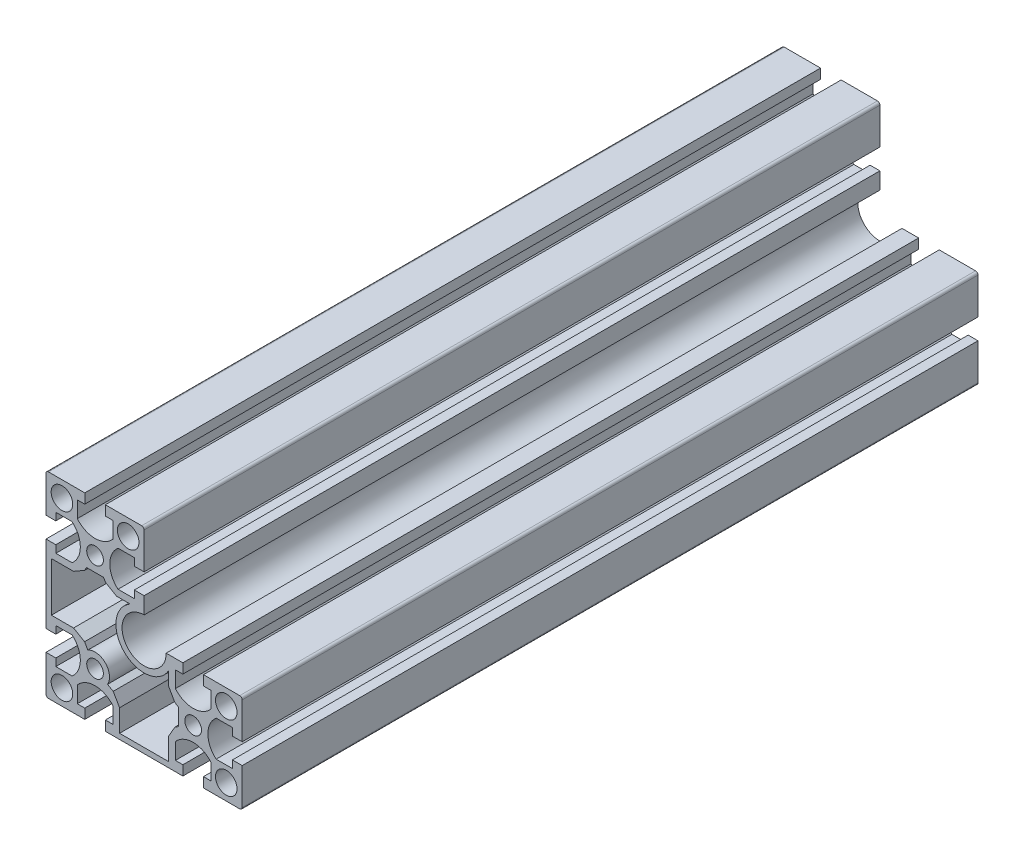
ISO-10303-21;
HEADER;
FILE_DESCRIPTION(('STEP AP214'),'2;1');
FILE_NAME('part.step','',(''),(''),'','','');
FILE_SCHEMA(('AUTOMOTIVE_DESIGN { 1 0 10303 214 1 1 1 1 }'));
ENDSEC;
DATA;
#1=APPLICATION_CONTEXT('core data for automotive mechanical design processes');
#2=APPLICATION_PROTOCOL_DEFINITION('international standard','automotive_design',2000,#1);
#3=PRODUCT_CONTEXT('',#1,'mechanical');
#4=PRODUCT('Part','Part','',(#3));
#5=PRODUCT_RELATED_PRODUCT_CATEGORY('part','',(#4));
#6=PRODUCT_DEFINITION_FORMATION('','',#4);
#7=PRODUCT_DEFINITION_CONTEXT('part definition',#1,'design');
#8=PRODUCT_DEFINITION('design','',#6,#7);
#9=PRODUCT_DEFINITION_SHAPE('','',#8);
#10=(LENGTH_UNIT() NAMED_UNIT(*) SI_UNIT(.MILLI.,.METRE.));
#11=(NAMED_UNIT(*) PLANE_ANGLE_UNIT() SI_UNIT($,.RADIAN.));
#12=(NAMED_UNIT(*) SI_UNIT($,.STERADIAN.) SOLID_ANGLE_UNIT());
#13=UNCERTAINTY_MEASURE_WITH_UNIT(LENGTH_MEASURE(1.E-05),#10,'distance_accuracy_value','');
#14=(GEOMETRIC_REPRESENTATION_CONTEXT(3) GLOBAL_UNCERTAINTY_ASSIGNED_CONTEXT((#13)) GLOBAL_UNIT_ASSIGNED_CONTEXT((#10,
#11,#12)) REPRESENTATION_CONTEXT('',''));
#15=CARTESIAN_POINT('',(0.,0.,0.));
#16=DIRECTION('',(0.,0.,1.));
#17=DIRECTION('',(1.,0.,0.));
#18=AXIS2_PLACEMENT_3D('',#15,#16,#17);
#19=CARTESIAN_POINT('',(1518.18378867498,817.784756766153,300.));
#20=DIRECTION('',(0.,0.,1.));
#21=DIRECTION('',(1.,0.,0.));
#22=AXIS2_PLACEMENT_3D('',#19,#20,#21);
#23=PLANE('',#22);
#24=CARTESIAN_POINT('',(1498.18378867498,797.784756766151,300.));
#25=DIRECTION('',(0.,0.,1.));
#26=DIRECTION('',(1.,0.,0.));
#27=AXIS2_PLACEMENT_3D('',#24,#25,#26);
#28=CIRCLE('',#27,3.39999999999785);
#29=CARTESIAN_POINT('',(1501.58378867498,797.784756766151,300.));
#30=VERTEX_POINT('',#29);
#31=EDGE_CURVE('E3134',#30,#30,#28,.T.);
#32=ORIENTED_EDGE('',*,*,#31,.F.);
#33=EDGE_LOOP('',(#32));
#34=FACE_BOUND('',#33,.T.);
#35=CARTESIAN_POINT('',(1511.68378867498,851.284756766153,300.));
#36=DIRECTION('',(0.,0.,1.));
#37=DIRECTION('',(1.,0.,0.));
#38=AXIS2_PLACEMENT_3D('',#35,#36,#37);
#39=CIRCLE('',#38,4.39999999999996);
#40=CARTESIAN_POINT('',(1516.08378867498,851.284756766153,300.));
#41=VERTEX_POINT('',#40);
#42=EDGE_CURVE('E3150',#41,#41,#39,.T.);
#43=ORIENTED_EDGE('',*,*,#42,.F.);
#44=EDGE_LOOP('',(#43));
#45=FACE_BOUND('',#44,.T.);
#46=DIRECTION('',(-1.,0.,0.));
#47=VECTOR('',#46,1.);
#48=CARTESIAN_POINT('',(1512.50488032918,827.784756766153,300.));
#49=LINE('',#48,#47);
#50=CARTESIAN_POINT('',(1512.50488032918,827.784756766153,300.));
#51=VERTEX_POINT('',#50);
#52=CARTESIAN_POINT('',(1506.95729136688,827.784756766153,300.));
#53=VERTEX_POINT('',#52);
#54=EDGE_CURVE('E666',#51,#53,#49,.T.);
#55=ORIENTED_EDGE('',*,*,#54,.F.);
#56=CARTESIAN_POINT('',(1518.18378867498,817.784756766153,300.));
#57=DIRECTION('',(0.,0.,-1.));
#58=DIRECTION('',(1.,0.,0.));
#59=AXIS2_PLACEMENT_3D('',#56,#57,#58);
#60=CIRCLE('',#59,11.5);
#61=CARTESIAN_POINT('',(1528.18378867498,812.105848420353,300.));
#62=VERTEX_POINT('',#61);
#63=EDGE_CURVE('E657',#62,#51,#60,.T.);
#64=ORIENTED_EDGE('',*,*,#63,.F.);
#65=DIRECTION('',(0.,1.,0.));
#66=VECTOR('',#65,1.);
#67=CARTESIAN_POINT('',(1528.18378867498,806.558259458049,300.));
#68=LINE('',#67,#66);
#69=CARTESIAN_POINT('',(1528.18378867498,806.558259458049,300.));
#70=VERTEX_POINT('',#69);
#71=EDGE_CURVE('E749',#70,#62,#68,.T.);
#72=ORIENTED_EDGE('',*,*,#71,.F.);
#73=DIRECTION('',(-0.500000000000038,0.866025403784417,0.));
#74=VECTOR('',#73,1.);
#75=CARTESIAN_POINT('',(1530.78186488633,802.058259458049,300.));
#76=LINE('',#75,#74);
#77=CARTESIAN_POINT('',(1530.78186488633,802.058259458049,300.));
#78=VERTEX_POINT('',#77);
#79=EDGE_CURVE('E746',#78,#70,#76,.T.);
#80=ORIENTED_EDGE('',*,*,#79,.F.);
#81=DIRECTION('',(-0.866025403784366,0.500000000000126,0.));
#82=VECTOR('',#81,1.);
#83=CARTESIAN_POINT('',(1532.18378867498,801.24885838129,300.));
#84=LINE('',#83,#82);
#85=CARTESIAN_POINT('',(1532.18378867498,801.24885838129,300.));
#86=VERTEX_POINT('',#85);
#87=EDGE_CURVE('E743',#86,#78,#84,.T.);
#88=ORIENTED_EDGE('',*,*,#87,.F.);
#89=DIRECTION('',(0.,1.,0.));
#90=VECTOR('',#89,1.);
#91=CARTESIAN_POINT('',(1532.18378867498,794.320655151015,300.));
#92=LINE('',#91,#90);
#93=CARTESIAN_POINT('',(1532.18378867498,794.320655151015,300.));
#94=VERTEX_POINT('',#93);
#95=EDGE_CURVE('E740',#94,#86,#92,.T.);
#96=ORIENTED_EDGE('',*,*,#95,.F.);
#97=DIRECTION('',(0.866025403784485,0.499999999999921,0.));
#98=VECTOR('',#97,1.);
#99=CARTESIAN_POINT('',(1530.78186488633,793.511254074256,300.));
#100=LINE('',#99,#98);
#101=CARTESIAN_POINT('',(1530.78186488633,793.511254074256,300.));
#102=VERTEX_POINT('',#101);
#103=EDGE_CURVE('E737',#102,#94,#100,.T.);
#104=ORIENTED_EDGE('',*,*,#103,.F.);
#105=DIRECTION('',(0.500000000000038,0.866025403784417,0.));
#106=VECTOR('',#105,1.);
#107=CARTESIAN_POINT('',(1528.18378867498,789.011254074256,300.));
#108=LINE('',#107,#106);
#109=CARTESIAN_POINT('',(1528.18378867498,789.011254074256,300.));
#110=VERTEX_POINT('',#109);
#111=EDGE_CURVE('E734',#110,#102,#108,.T.);
#112=ORIENTED_EDGE('',*,*,#111,.F.);
#113=DIRECTION('',(0.,1.,0.));
#114=VECTOR('',#113,1.);
#115=CARTESIAN_POINT('',(1528.18378867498,779.984756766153,300.));
#116=LINE('',#115,#114);
#117=CARTESIAN_POINT('',(1528.18378867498,779.984756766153,300.));
#118=VERTEX_POINT('',#117);
#119=EDGE_CURVE('E731',#118,#110,#116,.T.);
#120=ORIENTED_EDGE('',*,*,#119,.F.);
#121=DIRECTION('',(1.,0.,0.));
#122=VECTOR('',#121,1.);
#123=CARTESIAN_POINT('',(1508.18378867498,779.984756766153,300.));
#124=LINE('',#123,#122);
#125=CARTESIAN_POINT('',(1508.18378867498,779.984756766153,300.));
#126=VERTEX_POINT('',#125);
#127=EDGE_CURVE('E728',#126,#118,#124,.T.);
#128=ORIENTED_EDGE('',*,*,#127,.F.);
#129=DIRECTION('',(0.,-1.,0.));
#130=VECTOR('',#129,1.);
#131=CARTESIAN_POINT('',(1508.18378867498,789.011254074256,300.));
#132=LINE('',#131,#130);
#133=CARTESIAN_POINT('',(1508.18378867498,789.011254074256,300.));
#134=VERTEX_POINT('',#133);
#135=EDGE_CURVE('E725',#134,#126,#132,.T.);
#136=ORIENTED_EDGE('',*,*,#135,.F.);
#137=DIRECTION('',(0.499999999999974,-0.866025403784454,0.));
#138=VECTOR('',#137,1.);
#139=CARTESIAN_POINT('',(1505.58571246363,793.511254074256,300.));
#140=LINE('',#139,#138);
#141=CARTESIAN_POINT('',(1505.58571246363,793.511254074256,300.));
#142=VERTEX_POINT('',#141);
#143=EDGE_CURVE('E722',#142,#134,#140,.T.);
#144=ORIENTED_EDGE('',*,*,#143,.F.);
#145=DIRECTION('',(0.866025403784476,-0.499999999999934,0.));
#146=VECTOR('',#145,1.);
#147=CARTESIAN_POINT('',(1503.29333855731,794.83475676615,300.));
#148=LINE('',#147,#146);
#149=CARTESIAN_POINT('',(1503.29333855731,794.83475676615,300.));
#150=VERTEX_POINT('',#149);
#151=EDGE_CURVE('E719',#150,#142,#148,.T.);
#152=ORIENTED_EDGE('',*,*,#151,.F.);
#153=CARTESIAN_POINT('',(1498.18378867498,797.784756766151,300.));
#154=DIRECTION('',(0.,0.,-1.));
#155=DIRECTION('',(1.,0.,0.));
#156=AXIS2_PLACEMENT_3D('',#153,#154,#155);
#157=CIRCLE('',#156,5.90000000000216);
#158=CARTESIAN_POINT('',(1495.23378867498,802.894306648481,300.));
#159=VERTEX_POINT('',#158);
#160=EDGE_CURVE('E716',#159,#150,#157,.T.);
#161=ORIENTED_EDGE('',*,*,#160,.F.);
#162=DIRECTION('',(0.500000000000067,-0.8660254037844,0.));
#163=VECTOR('',#162,1.);
#164=CARTESIAN_POINT('',(1493.91028598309,805.186680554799,300.));
#165=LINE('',#164,#163);
#166=CARTESIAN_POINT('',(1493.91028598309,805.186680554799,300.));
#167=VERTEX_POINT('',#166);
#168=EDGE_CURVE('E713',#167,#159,#165,.T.);
#169=ORIENTED_EDGE('',*,*,#168,.F.);
#170=DIRECTION('',(0.866025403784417,-0.500000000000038,0.));
#171=VECTOR('',#170,1.);
#172=CARTESIAN_POINT('',(1489.41028598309,807.784756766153,300.));
#173=LINE('',#172,#171);
#174=CARTESIAN_POINT('',(1489.41028598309,807.784756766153,300.));
#175=VERTEX_POINT('',#174);
#176=EDGE_CURVE('E710',#175,#167,#173,.T.);
#177=ORIENTED_EDGE('',*,*,#176,.F.);
#178=DIRECTION('',(1.,0.,0.));
#179=VECTOR('',#178,1.);
#180=CARTESIAN_POINT('',(1480.38378867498,807.784756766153,300.));
#181=LINE('',#180,#179);
#182=CARTESIAN_POINT('',(1480.38378867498,807.784756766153,300.));
#183=VERTEX_POINT('',#182);
#184=EDGE_CURVE('E707',#183,#175,#181,.T.);
#185=ORIENTED_EDGE('',*,*,#184,.F.);
#186=DIRECTION('',(0.,-1.,0.));
#187=VECTOR('',#186,1.);
#188=CARTESIAN_POINT('',(1480.38378867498,827.784756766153,300.));
#189=LINE('',#188,#187);
#190=CARTESIAN_POINT('',(1480.38378867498,827.784756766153,300.));
#191=VERTEX_POINT('',#190);
#192=EDGE_CURVE('E704',#191,#183,#189,.T.);
#193=ORIENTED_EDGE('',*,*,#192,.F.);
#194=DIRECTION('',(-1.,0.,0.));
#195=VECTOR('',#194,1.);
#196=CARTESIAN_POINT('',(1489.41028598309,827.784756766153,300.));
#197=LINE('',#196,#195);
#198=CARTESIAN_POINT('',(1489.41028598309,827.784756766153,300.));
#199=VERTEX_POINT('',#198);
#200=EDGE_CURVE('E701',#199,#191,#197,.T.);
#201=ORIENTED_EDGE('',*,*,#200,.F.);
#202=DIRECTION('',(-0.866025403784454,-0.499999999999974,0.));
#203=VECTOR('',#202,1.);
#204=CARTESIAN_POINT('',(1493.91028598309,830.382832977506,300.));
#205=LINE('',#204,#203);
#206=CARTESIAN_POINT('',(1493.91028598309,830.382832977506,300.));
#207=VERTEX_POINT('',#206);
#208=EDGE_CURVE('E698',#207,#199,#205,.T.);
#209=ORIENTED_EDGE('',*,*,#208,.F.);
#210=DIRECTION('',(-0.499999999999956,-0.866025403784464,0.));
#211=VECTOR('',#210,1.);
#212=CARTESIAN_POINT('',(1494.71968705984,831.784756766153,300.));
#213=LINE('',#212,#211);
#214=CARTESIAN_POINT('',(1494.71968705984,831.784756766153,300.));
#215=VERTEX_POINT('',#214);
#216=EDGE_CURVE('E695',#215,#207,#213,.T.);
#217=ORIENTED_EDGE('',*,*,#216,.F.);
#218=DIRECTION('',(-1.,0.,0.));
#219=VECTOR('',#218,1.);
#220=CARTESIAN_POINT('',(1501.64789029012,831.784756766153,300.));
#221=LINE('',#220,#219);
#222=CARTESIAN_POINT('',(1501.64789029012,831.784756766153,300.));
#223=VERTEX_POINT('',#222);
#224=EDGE_CURVE('E692',#223,#215,#221,.T.);
#225=ORIENTED_EDGE('',*,*,#224,.F.);
#226=DIRECTION('',(-0.499999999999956,0.866025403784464,0.));
#227=VECTOR('',#226,1.);
#228=CARTESIAN_POINT('',(1502.45729136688,830.382832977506,300.));
#229=LINE('',#228,#227);
#230=CARTESIAN_POINT('',(1502.45729136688,830.382832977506,300.));
#231=VERTEX_POINT('',#230);
#232=EDGE_CURVE('E686',#231,#223,#229,.T.);
#233=ORIENTED_EDGE('',*,*,#232,.F.);
#234=DIRECTION('',(-0.866025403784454,0.499999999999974,0.));
#235=VECTOR('',#234,1.);
#236=CARTESIAN_POINT('',(1506.95729136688,827.784756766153,300.));
#237=LINE('',#236,#235);
#238=EDGE_CURVE('E681',#53,#231,#237,.T.);
#239=ORIENTED_EDGE('',*,*,#238,.F.);
#240=EDGE_LOOP('',(#55,#64,#72,#80,#88,#96,#104,#112,#120,#128,#136,#144,#152,#161,#169,#177,
#185,#193,#201,#209,#217,#225,#233,#239));
#241=FACE_BOUND('',#240,.T.);
#242=CARTESIAN_POINT('',(1484.68378867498,784.284756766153,300.));
#243=DIRECTION('',(0.,0.,1.));
#244=DIRECTION('',(1.,0.,0.));
#245=AXIS2_PLACEMENT_3D('',#242,#243,#244);
#246=CIRCLE('',#245,4.39999999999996);
#247=CARTESIAN_POINT('',(1489.08378867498,784.284756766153,300.));
#248=VERTEX_POINT('',#247);
#249=EDGE_CURVE('E909',#248,#248,#246,.T.);
#250=ORIENTED_EDGE('',*,*,#249,.F.);
#251=EDGE_LOOP('',(#250));
#252=FACE_BOUND('',#251,.T.);
#253=CARTESIAN_POINT('',(1551.68378867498,811.284756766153,300.));
#254=DIRECTION('',(0.,0.,1.));
#255=DIRECTION('',(1.,0.,0.));
#256=AXIS2_PLACEMENT_3D('',#253,#254,#255);
#257=CIRCLE('',#256,4.39999999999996);
#258=CARTESIAN_POINT('',(1556.08378867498,811.284756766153,300.));
#259=VERTEX_POINT('',#258);
#260=EDGE_CURVE('E925',#259,#259,#257,.T.);
#261=ORIENTED_EDGE('',*,*,#260,.F.);
#262=EDGE_LOOP('',(#261));
#263=FACE_BOUND('',#262,.T.);
#264=CARTESIAN_POINT('',(1518.18378867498,817.784756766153,300.));
#265=DIRECTION('',(0.,0.,-1.));
#266=DIRECTION('',(1.,0.,0.));
#267=AXIS2_PLACEMENT_3D('',#264,#265,#266);
#268=CIRCLE('',#267,8.99999999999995);
#269=CARTESIAN_POINT('',(1527.18378867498,817.784756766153,300.));
#270=VERTEX_POINT('',#269);
#271=CARTESIAN_POINT('',(1518.18378867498,826.784756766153,300.));
#272=VERTEX_POINT('',#271);
#273=EDGE_CURVE('E933',#270,#272,#268,.T.);
#274=ORIENTED_EDGE('',*,*,#273,.T.);
#275=DIRECTION('',(0.,1.,0.));
#276=VECTOR('',#275,1.);
#277=CARTESIAN_POINT('',(1518.18378867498,826.784756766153,300.));
#278=LINE('',#277,#276);
#279=CARTESIAN_POINT('',(1518.18378867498,833.584756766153,300.));
#280=VERTEX_POINT('',#279);
#281=EDGE_CURVE('E937',#272,#280,#278,.T.);
#282=ORIENTED_EDGE('',*,*,#281,.T.);
#283=DIRECTION('',(-1.,0.,0.));
#284=VECTOR('',#283,1.);
#285=CARTESIAN_POINT('',(1518.18378867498,833.584756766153,300.));
#286=LINE('',#285,#284);
#287=CARTESIAN_POINT('',(1514.18378867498,833.584756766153,300.));
#288=VERTEX_POINT('',#287);
#289=EDGE_CURVE('E941',#280,#288,#286,.T.);
#290=ORIENTED_EDGE('',*,*,#289,.T.);
#291=DIRECTION('',(0.,-1.,0.));
#292=VECTOR('',#291,1.);
#293=CARTESIAN_POINT('',(1514.18378867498,833.584756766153,300.));
#294=LINE('',#293,#292);
#295=CARTESIAN_POINT('',(1514.18378867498,830.534756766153,300.));
#296=VERTEX_POINT('',#295);
#297=EDGE_CURVE('E944',#288,#296,#294,.T.);
#298=ORIENTED_EDGE('',*,*,#297,.T.);
#299=DIRECTION('',(-1.,0.,0.));
#300=VECTOR('',#299,1.);
#301=CARTESIAN_POINT('',(1514.18378867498,830.534756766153,300.));
#302=LINE('',#301,#300);
#303=CARTESIAN_POINT('',(1507.54477409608,830.534756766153,300.));
#304=VERTEX_POINT('',#303);
#305=EDGE_CURVE('E947',#296,#304,#302,.T.);
#306=ORIENTED_EDGE('',*,*,#305,.T.);
#307=CARTESIAN_POINT('',(1513.68378867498,837.784756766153,300.));
#308=DIRECTION('',(0.,0.,-1.));
#309=DIRECTION('',(1.,0.,0.));
#310=AXIS2_PLACEMENT_3D('',#307,#308,#309);
#311=CIRCLE('',#310,9.49999999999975);
#312=CARTESIAN_POINT('',(1507.54477409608,845.034756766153,300.));
#313=VERTEX_POINT('',#312);
#314=EDGE_CURVE('E950',#304,#313,#311,.T.);
#315=ORIENTED_EDGE('',*,*,#314,.T.);
#316=DIRECTION('',(1.,0.,0.));
#317=VECTOR('',#316,1.);
#318=CARTESIAN_POINT('',(1507.54477409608,845.034756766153,300.));
#319=LINE('',#318,#317);
#320=CARTESIAN_POINT('',(1514.18378867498,845.034756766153,300.));
#321=VERTEX_POINT('',#320);
#322=EDGE_CURVE('E953',#313,#321,#319,.T.);
#323=ORIENTED_EDGE('',*,*,#322,.T.);
#324=DIRECTION('',(0.,-1.,0.));
#325=VECTOR('',#324,1.);
#326=CARTESIAN_POINT('',(1514.18378867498,845.034756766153,300.));
#327=LINE('',#326,#325);
#328=CARTESIAN_POINT('',(1514.18378867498,841.984756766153,300.));
#329=VERTEX_POINT('',#328);
#330=EDGE_CURVE('E956',#321,#329,#327,.T.);
#331=ORIENTED_EDGE('',*,*,#330,.T.);
#332=DIRECTION('',(1.,0.,0.));
#333=VECTOR('',#332,1.);
#334=CARTESIAN_POINT('',(1514.18378867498,841.984756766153,300.));
#335=LINE('',#334,#333);
#336=CARTESIAN_POINT('',(1518.18378867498,841.984756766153,300.));
#337=VERTEX_POINT('',#336);
#338=EDGE_CURVE('E959',#329,#337,#335,.T.);
#339=ORIENTED_EDGE('',*,*,#338,.T.);
#340=DIRECTION('',(0.,1.,0.));
#341=VECTOR('',#340,1.);
#342=CARTESIAN_POINT('',(1518.18378867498,841.984756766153,300.));
#343=LINE('',#342,#341);
#344=CARTESIAN_POINT('',(1518.18378867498,856.784756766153,300.));
#345=VERTEX_POINT('',#344);
#346=EDGE_CURVE('E962',#337,#345,#343,.T.);
#347=ORIENTED_EDGE('',*,*,#346,.T.);
#348=CARTESIAN_POINT('',(1517.18378867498,856.784756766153,300.));
#349=DIRECTION('',(0.,0.,1.));
#350=DIRECTION('',(1.,0.,0.));
#351=AXIS2_PLACEMENT_3D('',#348,#349,#350);
#352=CIRCLE('',#351,1.00000000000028);
#353=CARTESIAN_POINT('',(1517.18378867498,857.784756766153,300.));
#354=VERTEX_POINT('',#353);
#355=EDGE_CURVE('E965',#345,#354,#352,.T.);
#356=ORIENTED_EDGE('',*,*,#355,.T.);
#357=DIRECTION('',(-1.,0.,0.));
#358=VECTOR('',#357,1.);
#359=CARTESIAN_POINT('',(1517.18378867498,857.784756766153,300.));
#360=LINE('',#359,#358);
#361=CARTESIAN_POINT('',(1502.38378867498,857.784756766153,300.));
#362=VERTEX_POINT('',#361);
#363=EDGE_CURVE('E968',#354,#362,#360,.T.);
#364=ORIENTED_EDGE('',*,*,#363,.T.);
#365=DIRECTION('',(0.,-1.,0.));
#366=VECTOR('',#365,1.);
#367=CARTESIAN_POINT('',(1502.38378867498,857.784756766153,300.));
#368=LINE('',#367,#366);
#369=CARTESIAN_POINT('',(1502.38378867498,853.784756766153,300.));
#370=VERTEX_POINT('',#369);
#371=EDGE_CURVE('E971',#362,#370,#368,.T.);
#372=ORIENTED_EDGE('',*,*,#371,.T.);
#373=DIRECTION('',(1.,0.,0.));
#374=VECTOR('',#373,1.);
#375=CARTESIAN_POINT('',(1502.38378867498,853.784756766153,300.));
#376=LINE('',#375,#374);
#377=CARTESIAN_POINT('',(1505.43378867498,853.784756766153,300.));
#378=VERTEX_POINT('',#377);
#379=EDGE_CURVE('E974',#370,#378,#376,.T.);
#380=ORIENTED_EDGE('',*,*,#379,.T.);
#381=DIRECTION('',(0.,-1.,0.));
#382=VECTOR('',#381,1.);
#383=CARTESIAN_POINT('',(1505.43378867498,853.784756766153,300.));
#384=LINE('',#383,#382);
#385=CARTESIAN_POINT('',(1505.43378867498,847.145742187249,300.));
#386=VERTEX_POINT('',#385);
#387=EDGE_CURVE('E977',#378,#386,#384,.T.);
#388=ORIENTED_EDGE('',*,*,#387,.T.);
#389=CARTESIAN_POINT('',(1498.18378867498,853.284756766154,300.));
#390=DIRECTION('',(0.,0.,-1.));
#391=DIRECTION('',(1.,0.,0.));
#392=AXIS2_PLACEMENT_3D('',#389,#390,#391);
#393=CIRCLE('',#392,9.50000000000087);
#394=CARTESIAN_POINT('',(1490.93378867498,847.145742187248,300.));
#395=VERTEX_POINT('',#394);
#396=EDGE_CURVE('E980',#386,#395,#393,.T.);
#397=ORIENTED_EDGE('',*,*,#396,.T.);
#398=DIRECTION('',(0.,1.,0.));
#399=VECTOR('',#398,1.);
#400=CARTESIAN_POINT('',(1490.93378867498,847.145742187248,300.));
#401=LINE('',#400,#399);
#402=CARTESIAN_POINT('',(1490.93378867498,853.784756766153,300.));
#403=VERTEX_POINT('',#402);
#404=EDGE_CURVE('E983',#395,#403,#401,.T.);
#405=ORIENTED_EDGE('',*,*,#404,.T.);
#406=DIRECTION('',(1.,0.,0.));
#407=VECTOR('',#406,1.);
#408=CARTESIAN_POINT('',(1490.93378867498,853.784756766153,300.));
#409=LINE('',#408,#407);
#410=CARTESIAN_POINT('',(1493.98378867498,853.784756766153,300.));
#411=VERTEX_POINT('',#410);
#412=EDGE_CURVE('E986',#403,#411,#409,.T.);
#413=ORIENTED_EDGE('',*,*,#412,.T.);
#414=DIRECTION('',(0.,1.,0.));
#415=VECTOR('',#414,1.);
#416=CARTESIAN_POINT('',(1493.98378867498,853.784756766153,300.));
#417=LINE('',#416,#415);
#418=CARTESIAN_POINT('',(1493.98378867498,857.784756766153,300.));
#419=VERTEX_POINT('',#418);
#420=EDGE_CURVE('E989',#411,#419,#417,.T.);
#421=ORIENTED_EDGE('',*,*,#420,.T.);
#422=DIRECTION('',(-1.,0.,0.));
#423=VECTOR('',#422,1.);
#424=CARTESIAN_POINT('',(1493.98378867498,857.784756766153,300.));
#425=LINE('',#424,#423);
#426=CARTESIAN_POINT('',(1479.18378867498,857.784756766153,300.));
#427=VERTEX_POINT('',#426);
#428=EDGE_CURVE('E992',#419,#427,#425,.T.);
#429=ORIENTED_EDGE('',*,*,#428,.T.);
#430=CARTESIAN_POINT('',(1479.18378867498,856.784756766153,300.));
#431=DIRECTION('',(0.,0.,1.));
#432=DIRECTION('',(1.,0.,0.));
#433=AXIS2_PLACEMENT_3D('',#430,#431,#432);
#434=CIRCLE('',#433,1.00000000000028);
#435=CARTESIAN_POINT('',(1478.18378867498,856.784756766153,300.));
#436=VERTEX_POINT('',#435);
#437=EDGE_CURVE('E995',#427,#436,#434,.T.);
#438=ORIENTED_EDGE('',*,*,#437,.T.);
#439=DIRECTION('',(0.,-1.,0.));
#440=VECTOR('',#439,1.);
#441=CARTESIAN_POINT('',(1478.18378867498,856.784756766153,300.));
#442=LINE('',#441,#440);
#443=CARTESIAN_POINT('',(1478.18378867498,841.984756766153,300.));
#444=VERTEX_POINT('',#443);
#445=EDGE_CURVE('E998',#436,#444,#442,.T.);
#446=ORIENTED_EDGE('',*,*,#445,.T.);
#447=DIRECTION('',(1.,0.,0.));
#448=VECTOR('',#447,1.);
#449=CARTESIAN_POINT('',(1478.18378867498,841.984756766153,300.));
#450=LINE('',#449,#448);
#451=CARTESIAN_POINT('',(1482.18378867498,841.984756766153,300.));
#452=VERTEX_POINT('',#451);
#453=EDGE_CURVE('E1001',#444,#452,#450,.T.);
#454=ORIENTED_EDGE('',*,*,#453,.T.);
#455=DIRECTION('',(0.,1.,0.));
#456=VECTOR('',#455,1.);
#457=CARTESIAN_POINT('',(1482.18378867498,841.984756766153,300.));
#458=LINE('',#457,#456);
#459=CARTESIAN_POINT('',(1482.18378867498,845.034756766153,300.));
#460=VERTEX_POINT('',#459);
#461=EDGE_CURVE('E1004',#452,#460,#458,.T.);
#462=ORIENTED_EDGE('',*,*,#461,.T.);
#463=DIRECTION('',(1.,0.,0.));
#464=VECTOR('',#463,1.);
#465=CARTESIAN_POINT('',(1482.18378867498,845.034756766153,300.));
#466=LINE('',#465,#464);
#467=CARTESIAN_POINT('',(1488.82280325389,845.034756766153,300.));
#468=VERTEX_POINT('',#467);
#469=EDGE_CURVE('E1007',#460,#468,#466,.T.);
#470=ORIENTED_EDGE('',*,*,#469,.T.);
#471=CARTESIAN_POINT('',(1482.68378867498,837.784756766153,300.));
#472=DIRECTION('',(0.,0.,-1.));
#473=DIRECTION('',(1.,0.,0.));
#474=AXIS2_PLACEMENT_3D('',#471,#472,#473);
#475=CIRCLE('',#474,9.49999999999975);
#476=CARTESIAN_POINT('',(1488.82280325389,830.534756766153,300.));
#477=VERTEX_POINT('',#476);
#478=EDGE_CURVE('E1010',#468,#477,#475,.T.);
#479=ORIENTED_EDGE('',*,*,#478,.T.);
#480=DIRECTION('',(-1.,0.,0.));
#481=VECTOR('',#480,1.);
#482=CARTESIAN_POINT('',(1488.82280325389,830.534756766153,300.));
#483=LINE('',#482,#481);
#484=CARTESIAN_POINT('',(1482.18378867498,830.534756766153,300.));
#485=VERTEX_POINT('',#484);
#486=EDGE_CURVE('E1013',#477,#485,#483,.T.);
#487=ORIENTED_EDGE('',*,*,#486,.T.);
#488=DIRECTION('',(0.,1.,0.));
#489=VECTOR('',#488,1.);
#490=CARTESIAN_POINT('',(1482.18378867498,830.534756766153,300.));
#491=LINE('',#490,#489);
#492=CARTESIAN_POINT('',(1482.18378867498,833.584756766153,300.));
#493=VERTEX_POINT('',#492);
#494=EDGE_CURVE('E1016',#485,#493,#491,.T.);
#495=ORIENTED_EDGE('',*,*,#494,.T.);
#496=DIRECTION('',(-1.,0.,0.));
#497=VECTOR('',#496,1.);
#498=CARTESIAN_POINT('',(1482.18378867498,833.584756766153,300.));
#499=LINE('',#498,#497);
#500=CARTESIAN_POINT('',(1478.18378867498,833.584756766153,300.));
#501=VERTEX_POINT('',#500);
#502=EDGE_CURVE('E1019',#493,#501,#499,.T.);
#503=ORIENTED_EDGE('',*,*,#502,.T.);
#504=DIRECTION('',(0.,-1.,0.));
#505=VECTOR('',#504,1.);
#506=CARTESIAN_POINT('',(1478.18378867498,833.584756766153,300.));
#507=LINE('',#506,#505);
#508=CARTESIAN_POINT('',(1478.18378867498,801.984756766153,300.));
#509=VERTEX_POINT('',#508);
#510=EDGE_CURVE('E1022',#501,#509,#507,.T.);
#511=ORIENTED_EDGE('',*,*,#510,.T.);
#512=DIRECTION('',(1.,0.,0.));
#513=VECTOR('',#512,1.);
#514=CARTESIAN_POINT('',(1478.18378867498,801.984756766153,300.));
#515=LINE('',#514,#513);
#516=CARTESIAN_POINT('',(1482.18378867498,801.984756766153,300.));
#517=VERTEX_POINT('',#516);
#518=EDGE_CURVE('E1025',#509,#517,#515,.T.);
#519=ORIENTED_EDGE('',*,*,#518,.T.);
#520=DIRECTION('',(0.,1.,0.));
#521=VECTOR('',#520,1.);
#522=CARTESIAN_POINT('',(1482.18378867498,801.984756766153,300.));
#523=LINE('',#522,#521);
#524=CARTESIAN_POINT('',(1482.18378867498,805.034756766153,300.));
#525=VERTEX_POINT('',#524);
#526=EDGE_CURVE('E1028',#517,#525,#523,.T.);
#527=ORIENTED_EDGE('',*,*,#526,.T.);
#528=DIRECTION('',(1.,0.,0.));
#529=VECTOR('',#528,1.);
#530=CARTESIAN_POINT('',(1482.18378867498,805.034756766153,300.));
#531=LINE('',#530,#529);
#532=CARTESIAN_POINT('',(1488.82280325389,805.034756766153,300.));
#533=VERTEX_POINT('',#532);
#534=EDGE_CURVE('E1031',#525,#533,#531,.T.);
#535=ORIENTED_EDGE('',*,*,#534,.T.);
#536=CARTESIAN_POINT('',(1482.68378867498,797.784756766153,300.));
#537=DIRECTION('',(0.,0.,-1.));
#538=DIRECTION('',(1.,0.,0.));
#539=AXIS2_PLACEMENT_3D('',#536,#537,#538);
#540=CIRCLE('',#539,9.50000000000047);
#541=CARTESIAN_POINT('',(1488.82280325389,790.534756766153,300.));
#542=VERTEX_POINT('',#541);
#543=EDGE_CURVE('E1034',#533,#542,#540,.T.);
#544=ORIENTED_EDGE('',*,*,#543,.T.);
#545=DIRECTION('',(-1.,0.,0.));
#546=VECTOR('',#545,1.);
#547=CARTESIAN_POINT('',(1488.82280325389,790.534756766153,300.));
#548=LINE('',#547,#546);
#549=CARTESIAN_POINT('',(1482.18378867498,790.534756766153,300.));
#550=VERTEX_POINT('',#549);
#551=EDGE_CURVE('E1037',#542,#550,#548,.T.);
#552=ORIENTED_EDGE('',*,*,#551,.T.);
#553=DIRECTION('',(0.,1.,0.));
#554=VECTOR('',#553,1.);
#555=CARTESIAN_POINT('',(1482.18378867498,790.534756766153,300.));
#556=LINE('',#555,#554);
#557=CARTESIAN_POINT('',(1482.18378867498,793.584756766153,300.));
#558=VERTEX_POINT('',#557);
#559=EDGE_CURVE('E1040',#550,#558,#556,.T.);
#560=ORIENTED_EDGE('',*,*,#559,.T.);
#561=DIRECTION('',(-1.,0.,0.));
#562=VECTOR('',#561,1.);
#563=CARTESIAN_POINT('',(1482.18378867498,793.584756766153,300.));
#564=LINE('',#563,#562);
#565=CARTESIAN_POINT('',(1478.18378867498,793.584756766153,300.));
#566=VERTEX_POINT('',#565);
#567=EDGE_CURVE('E1043',#558,#566,#564,.T.);
#568=ORIENTED_EDGE('',*,*,#567,.T.);
#569=DIRECTION('',(0.,-1.,0.));
#570=VECTOR('',#569,1.);
#571=CARTESIAN_POINT('',(1478.18378867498,793.584756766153,300.));
#572=LINE('',#571,#570);
#573=CARTESIAN_POINT('',(1478.18378867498,778.784756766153,300.));
#574=VERTEX_POINT('',#573);
#575=EDGE_CURVE('E1046',#566,#574,#572,.T.);
#576=ORIENTED_EDGE('',*,*,#575,.T.);
#577=CARTESIAN_POINT('',(1479.18378867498,778.784756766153,300.));
#578=DIRECTION('',(0.,0.,1.));
#579=DIRECTION('',(1.,0.,0.));
#580=AXIS2_PLACEMENT_3D('',#577,#578,#579);
#581=CIRCLE('',#580,0.99999999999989);
#582=CARTESIAN_POINT('',(1479.18378867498,777.784756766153,300.));
#583=VERTEX_POINT('',#582);
#584=EDGE_CURVE('E1049',#574,#583,#581,.T.);
#585=ORIENTED_EDGE('',*,*,#584,.T.);
#586=DIRECTION('',(1.,0.,0.));
#587=VECTOR('',#586,1.);
#588=CARTESIAN_POINT('',(1479.18378867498,777.784756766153,300.));
#589=LINE('',#588,#587);
#590=CARTESIAN_POINT('',(1493.98378867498,777.784756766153,300.));
#591=VERTEX_POINT('',#590);
#592=EDGE_CURVE('E1052',#583,#591,#589,.T.);
#593=ORIENTED_EDGE('',*,*,#592,.T.);
#594=DIRECTION('',(0.,1.,0.));
#595=VECTOR('',#594,1.);
#596=CARTESIAN_POINT('',(1493.98378867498,777.784756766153,300.));
#597=LINE('',#596,#595);
#598=CARTESIAN_POINT('',(1493.98378867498,781.784756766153,300.));
#599=VERTEX_POINT('',#598);
#600=EDGE_CURVE('E1055',#591,#599,#597,.T.);
#601=ORIENTED_EDGE('',*,*,#600,.T.);
#602=DIRECTION('',(-1.,0.,0.));
#603=VECTOR('',#602,1.);
#604=CARTESIAN_POINT('',(1493.98378867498,781.784756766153,300.));
#605=LINE('',#604,#603);
#606=CARTESIAN_POINT('',(1490.93378867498,781.784756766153,300.));
#607=VERTEX_POINT('',#606);
#608=EDGE_CURVE('E1058',#599,#607,#605,.T.);
#609=ORIENTED_EDGE('',*,*,#608,.T.);
#610=DIRECTION('',(0.,1.,0.));
#611=VECTOR('',#610,1.);
#612=CARTESIAN_POINT('',(1490.93378867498,781.784756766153,300.));
#613=LINE('',#612,#611);
#614=CARTESIAN_POINT('',(1490.93378867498,788.423771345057,300.));
#615=VERTEX_POINT('',#614);
#616=EDGE_CURVE('E1061',#607,#615,#613,.T.);
#617=ORIENTED_EDGE('',*,*,#616,.T.);
#618=CARTESIAN_POINT('',(1498.18378867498,782.284756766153,300.));
#619=DIRECTION('',(0.,0.,-1.));
#620=DIRECTION('',(1.,0.,0.));
#621=AXIS2_PLACEMENT_3D('',#618,#619,#620);
#622=CIRCLE('',#621,9.49999999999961);
#623=CARTESIAN_POINT('',(1505.43378867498,788.423771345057,300.));
#624=VERTEX_POINT('',#623);
#625=EDGE_CURVE('E1064',#615,#624,#622,.T.);
#626=ORIENTED_EDGE('',*,*,#625,.T.);
#627=DIRECTION('',(0.,-1.,0.));
#628=VECTOR('',#627,1.);
#629=CARTESIAN_POINT('',(1505.43378867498,788.423771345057,300.));
#630=LINE('',#629,#628);
#631=CARTESIAN_POINT('',(1505.43378867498,781.784756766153,300.));
#632=VERTEX_POINT('',#631);
#633=EDGE_CURVE('E1067',#624,#632,#630,.T.);
#634=ORIENTED_EDGE('',*,*,#633,.T.);
#635=DIRECTION('',(-1.,0.,0.));
#636=VECTOR('',#635,1.);
#637=CARTESIAN_POINT('',(1505.43378867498,781.784756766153,300.));
#638=LINE('',#637,#636);
#639=CARTESIAN_POINT('',(1502.38378867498,781.784756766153,300.));
#640=VERTEX_POINT('',#639);
#641=EDGE_CURVE('E1070',#632,#640,#638,.T.);
#642=ORIENTED_EDGE('',*,*,#641,.T.);
#643=DIRECTION('',(0.,-1.,0.));
#644=VECTOR('',#643,1.);
#645=CARTESIAN_POINT('',(1502.38378867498,781.784756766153,300.));
#646=LINE('',#645,#644);
#647=CARTESIAN_POINT('',(1502.38378867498,777.784756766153,300.));
#648=VERTEX_POINT('',#647);
#649=EDGE_CURVE('E1073',#640,#648,#646,.T.);
#650=ORIENTED_EDGE('',*,*,#649,.T.);
#651=DIRECTION('',(1.,0.,0.));
#652=VECTOR('',#651,1.);
#653=CARTESIAN_POINT('',(1502.38378867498,777.784756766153,300.));
#654=LINE('',#653,#652);
#655=CARTESIAN_POINT('',(1533.98378867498,777.784756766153,300.));
#656=VERTEX_POINT('',#655);
#657=EDGE_CURVE('E1076',#648,#656,#654,.T.);
#658=ORIENTED_EDGE('',*,*,#657,.T.);
#659=DIRECTION('',(0.,1.,0.));
#660=VECTOR('',#659,1.);
#661=CARTESIAN_POINT('',(1533.98378867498,777.784756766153,300.));
#662=LINE('',#661,#660);
#663=CARTESIAN_POINT('',(1533.98378867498,781.784756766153,300.));
#664=VERTEX_POINT('',#663);
#665=EDGE_CURVE('E1079',#656,#664,#662,.T.);
#666=ORIENTED_EDGE('',*,*,#665,.T.);
#667=DIRECTION('',(-1.,0.,0.));
#668=VECTOR('',#667,1.);
#669=CARTESIAN_POINT('',(1533.98378867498,781.784756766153,300.));
#670=LINE('',#669,#668);
#671=CARTESIAN_POINT('',(1530.93378867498,781.784756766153,300.));
#672=VERTEX_POINT('',#671);
#673=EDGE_CURVE('E1082',#664,#672,#670,.T.);
#674=ORIENTED_EDGE('',*,*,#673,.T.);
#675=DIRECTION('',(0.,1.,0.));
#676=VECTOR('',#675,1.);
#677=CARTESIAN_POINT('',(1530.93378867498,781.784756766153,300.));
#678=LINE('',#677,#676);
#679=CARTESIAN_POINT('',(1530.93378867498,788.423771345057,300.));
#680=VERTEX_POINT('',#679);
#681=EDGE_CURVE('E1085',#672,#680,#678,.T.);
#682=ORIENTED_EDGE('',*,*,#681,.T.);
#683=CARTESIAN_POINT('',(1538.18378867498,782.284756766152,300.));
#684=DIRECTION('',(0.,0.,-1.));
#685=DIRECTION('',(1.,0.,0.));
#686=AXIS2_PLACEMENT_3D('',#683,#684,#685);
#687=CIRCLE('',#686,9.50000000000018);
#688=CARTESIAN_POINT('',(1545.43378867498,788.423771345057,300.));
#689=VERTEX_POINT('',#688);
#690=EDGE_CURVE('E1088',#680,#689,#687,.T.);
#691=ORIENTED_EDGE('',*,*,#690,.T.);
#692=DIRECTION('',(0.,-1.,0.));
#693=VECTOR('',#692,1.);
#694=CARTESIAN_POINT('',(1545.43378867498,788.423771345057,300.));
#695=LINE('',#694,#693);
#696=CARTESIAN_POINT('',(1545.43378867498,781.784756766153,300.));
#697=VERTEX_POINT('',#696);
#698=EDGE_CURVE('E1091',#689,#697,#695,.T.);
#699=ORIENTED_EDGE('',*,*,#698,.T.);
#700=DIRECTION('',(-1.,0.,0.));
#701=VECTOR('',#700,1.);
#702=CARTESIAN_POINT('',(1545.43378867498,781.784756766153,300.));
#703=LINE('',#702,#701);
#704=CARTESIAN_POINT('',(1542.38378867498,781.784756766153,300.));
#705=VERTEX_POINT('',#704);
#706=EDGE_CURVE('E1094',#697,#705,#703,.T.);
#707=ORIENTED_EDGE('',*,*,#706,.T.);
#708=DIRECTION('',(0.,-1.,0.));
#709=VECTOR('',#708,1.);
#710=CARTESIAN_POINT('',(1542.38378867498,781.784756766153,300.));
#711=LINE('',#710,#709);
#712=CARTESIAN_POINT('',(1542.38378867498,777.784756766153,300.));
#713=VERTEX_POINT('',#712);
#714=EDGE_CURVE('E1097',#705,#713,#711,.T.);
#715=ORIENTED_EDGE('',*,*,#714,.T.);
#716=DIRECTION('',(1.,0.,0.));
#717=VECTOR('',#716,1.);
#718=CARTESIAN_POINT('',(1542.38378867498,777.784756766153,300.));
#719=LINE('',#718,#717);
#720=CARTESIAN_POINT('',(1557.18378867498,777.784756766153,300.));
#721=VERTEX_POINT('',#720);
#722=EDGE_CURVE('E1100',#713,#721,#719,.T.);
#723=ORIENTED_EDGE('',*,*,#722,.T.);
#724=CARTESIAN_POINT('',(1557.18378867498,778.784756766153,300.));
#725=DIRECTION('',(0.,0.,1.));
#726=DIRECTION('',(1.,0.,0.));
#727=AXIS2_PLACEMENT_3D('',#724,#725,#726);
#728=CIRCLE('',#727,1.00000000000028);
#729=CARTESIAN_POINT('',(1558.18378867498,778.784756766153,300.));
#730=VERTEX_POINT('',#729);
#731=EDGE_CURVE('E1103',#721,#730,#728,.T.);
#732=ORIENTED_EDGE('',*,*,#731,.T.);
#733=DIRECTION('',(0.,1.,0.));
#734=VECTOR('',#733,1.);
#735=CARTESIAN_POINT('',(1558.18378867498,778.784756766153,300.));
#736=LINE('',#735,#734);
#737=CARTESIAN_POINT('',(1558.18378867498,793.584756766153,300.));
#738=VERTEX_POINT('',#737);
#739=EDGE_CURVE('E1106',#730,#738,#736,.T.);
#740=ORIENTED_EDGE('',*,*,#739,.T.);
#741=DIRECTION('',(-1.,0.,0.));
#742=VECTOR('',#741,1.);
#743=CARTESIAN_POINT('',(1558.18378867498,793.584756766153,300.));
#744=LINE('',#743,#742);
#745=CARTESIAN_POINT('',(1554.18378867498,793.584756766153,300.));
#746=VERTEX_POINT('',#745);
#747=EDGE_CURVE('E1109',#738,#746,#744,.T.);
#748=ORIENTED_EDGE('',*,*,#747,.T.);
#749=DIRECTION('',(0.,-1.,0.));
#750=VECTOR('',#749,1.);
#751=CARTESIAN_POINT('',(1554.18378867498,793.584756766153,300.));
#752=LINE('',#751,#750);
#753=CARTESIAN_POINT('',(1554.18378867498,790.534756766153,300.));
#754=VERTEX_POINT('',#753);
#755=EDGE_CURVE('E1112',#746,#754,#752,.T.);
#756=ORIENTED_EDGE('',*,*,#755,.T.);
#757=DIRECTION('',(-1.,0.,0.));
#758=VECTOR('',#757,1.);
#759=CARTESIAN_POINT('',(1554.18378867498,790.534756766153,300.));
#760=LINE('',#759,#758);
#761=CARTESIAN_POINT('',(1547.54477409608,790.534756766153,300.));
#762=VERTEX_POINT('',#761);
#763=EDGE_CURVE('E1115',#754,#762,#760,.T.);
#764=ORIENTED_EDGE('',*,*,#763,.T.);
#765=CARTESIAN_POINT('',(1553.68378867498,797.784756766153,300.));
#766=DIRECTION('',(0.,0.,-1.));
#767=DIRECTION('',(1.,0.,0.));
#768=AXIS2_PLACEMENT_3D('',#765,#766,#767);
#769=CIRCLE('',#768,9.50000000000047);
#770=CARTESIAN_POINT('',(1547.54477409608,805.034756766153,300.));
#771=VERTEX_POINT('',#770);
#772=EDGE_CURVE('E1118',#762,#771,#769,.T.);
#773=ORIENTED_EDGE('',*,*,#772,.T.);
#774=DIRECTION('',(1.,0.,0.));
#775=VECTOR('',#774,1.);
#776=CARTESIAN_POINT('',(1547.54477409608,805.034756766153,300.));
#777=LINE('',#776,#775);
#778=CARTESIAN_POINT('',(1554.18378867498,805.034756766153,300.));
#779=VERTEX_POINT('',#778);
#780=EDGE_CURVE('E1121',#771,#779,#777,.T.);
#781=ORIENTED_EDGE('',*,*,#780,.T.);
#782=DIRECTION('',(0.,-1.,0.));
#783=VECTOR('',#782,1.);
#784=CARTESIAN_POINT('',(1554.18378867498,805.034756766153,300.));
#785=LINE('',#784,#783);
#786=CARTESIAN_POINT('',(1554.18378867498,801.984756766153,300.));
#787=VERTEX_POINT('',#786);
#788=EDGE_CURVE('E1124',#779,#787,#785,.T.);
#789=ORIENTED_EDGE('',*,*,#788,.T.);
#790=DIRECTION('',(1.,0.,0.));
#791=VECTOR('',#790,1.);
#792=CARTESIAN_POINT('',(1554.18378867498,801.984756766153,300.));
#793=LINE('',#792,#791);
#794=CARTESIAN_POINT('',(1558.18378867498,801.984756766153,300.));
#795=VERTEX_POINT('',#794);
#796=EDGE_CURVE('E1127',#787,#795,#793,.T.);
#797=ORIENTED_EDGE('',*,*,#796,.T.);
#798=DIRECTION('',(0.,1.,0.));
#799=VECTOR('',#798,1.);
#800=CARTESIAN_POINT('',(1558.18378867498,801.984756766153,300.));
#801=LINE('',#800,#799);
#802=CARTESIAN_POINT('',(1558.18378867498,816.784756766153,300.));
#803=VERTEX_POINT('',#802);
#804=EDGE_CURVE('E1130',#795,#803,#801,.T.);
#805=ORIENTED_EDGE('',*,*,#804,.T.);
#806=CARTESIAN_POINT('',(1557.18378867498,816.784756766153,300.));
#807=DIRECTION('',(0.,0.,1.));
#808=DIRECTION('',(1.,0.,0.));
#809=AXIS2_PLACEMENT_3D('',#806,#807,#808);
#810=CIRCLE('',#809,1.00000000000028);
#811=CARTESIAN_POINT('',(1557.18378867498,817.784756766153,300.));
#812=VERTEX_POINT('',#811);
#813=EDGE_CURVE('E1133',#803,#812,#810,.T.);
#814=ORIENTED_EDGE('',*,*,#813,.T.);
#815=DIRECTION('',(-1.,0.,0.));
#816=VECTOR('',#815,1.);
#817=CARTESIAN_POINT('',(1557.18378867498,817.784756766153,300.));
#818=LINE('',#817,#816);
#819=CARTESIAN_POINT('',(1542.38378867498,817.784756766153,300.));
#820=VERTEX_POINT('',#819);
#821=EDGE_CURVE('E1136',#812,#820,#818,.T.);
#822=ORIENTED_EDGE('',*,*,#821,.T.);
#823=DIRECTION('',(0.,-1.,0.));
#824=VECTOR('',#823,1.);
#825=CARTESIAN_POINT('',(1542.38378867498,817.784756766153,300.));
#826=LINE('',#825,#824);
#827=CARTESIAN_POINT('',(1542.38378867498,813.784756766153,300.));
#828=VERTEX_POINT('',#827);
#829=EDGE_CURVE('E1139',#820,#828,#826,.T.);
#830=ORIENTED_EDGE('',*,*,#829,.T.);
#831=DIRECTION('',(1.,0.,0.));
#832=VECTOR('',#831,1.);
#833=CARTESIAN_POINT('',(1542.38378867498,813.784756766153,300.));
#834=LINE('',#833,#832);
#835=CARTESIAN_POINT('',(1545.43378867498,813.784756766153,300.));
#836=VERTEX_POINT('',#835);
#837=EDGE_CURVE('E1142',#828,#836,#834,.T.);
#838=ORIENTED_EDGE('',*,*,#837,.T.);
#839=DIRECTION('',(0.,-1.,0.));
#840=VECTOR('',#839,1.);
#841=CARTESIAN_POINT('',(1545.43378867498,813.784756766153,300.));
#842=LINE('',#841,#840);
#843=CARTESIAN_POINT('',(1545.43378867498,807.145742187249,300.));
#844=VERTEX_POINT('',#843);
#845=EDGE_CURVE('E1145',#836,#844,#842,.T.);
#846=ORIENTED_EDGE('',*,*,#845,.T.);
#847=CARTESIAN_POINT('',(1538.18378867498,813.284756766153,300.));
#848=DIRECTION('',(0.,0.,-1.));
#849=DIRECTION('',(1.,0.,0.));
#850=AXIS2_PLACEMENT_3D('',#847,#848,#849);
#851=CIRCLE('',#850,9.50000000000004);
#852=CARTESIAN_POINT('',(1530.93378867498,807.145742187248,300.));
#853=VERTEX_POINT('',#852);
#854=EDGE_CURVE('E1148',#844,#853,#851,.T.);
#855=ORIENTED_EDGE('',*,*,#854,.T.);
#856=DIRECTION('',(0.,1.,0.));
#857=VECTOR('',#856,1.);
#858=CARTESIAN_POINT('',(1530.93378867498,807.145742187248,300.));
#859=LINE('',#858,#857);
#860=CARTESIAN_POINT('',(1530.93378867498,813.784756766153,300.));
#861=VERTEX_POINT('',#860);
#862=EDGE_CURVE('E1151',#853,#861,#859,.T.);
#863=ORIENTED_EDGE('',*,*,#862,.T.);
#864=DIRECTION('',(1.,0.,0.));
#865=VECTOR('',#864,1.);
#866=CARTESIAN_POINT('',(1530.93378867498,813.784756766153,300.));
#867=LINE('',#866,#865);
#868=CARTESIAN_POINT('',(1533.98378867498,813.784756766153,300.));
#869=VERTEX_POINT('',#868);
#870=EDGE_CURVE('E1154',#861,#869,#867,.T.);
#871=ORIENTED_EDGE('',*,*,#870,.T.);
#872=DIRECTION('',(0.,1.,0.));
#873=VECTOR('',#872,1.);
#874=CARTESIAN_POINT('',(1533.98378867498,813.784756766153,300.));
#875=LINE('',#874,#873);
#876=CARTESIAN_POINT('',(1533.98378867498,817.784756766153,300.));
#877=VERTEX_POINT('',#876);
#878=EDGE_CURVE('E1157',#869,#877,#875,.T.);
#879=ORIENTED_EDGE('',*,*,#878,.T.);
#880=DIRECTION('',(-1.,0.,0.));
#881=VECTOR('',#880,1.);
#882=CARTESIAN_POINT('',(1533.98378867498,817.784756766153,300.));
#883=LINE('',#882,#881);
#884=EDGE_CURVE('E1160',#877,#270,#883,.T.);
#885=ORIENTED_EDGE('',*,*,#884,.T.);
#886=EDGE_LOOP('',(#274,#282,#290,#298,#306,#315,#323,#331,#339,#347,#356,#364,#372,#380,#388,
#397,#405,#413,#421,#429,#438,#446,#454,#462,#470,#479,#487,#495,#503,#511,#519,#527,#535,#544,
#552,#560,#568,#576,#585,#593,#601,#609,#617,#626,#634,#642,#650,#658,#666,#674,#682,#691,#699,
#707,#715,#723,#732,#740,#748,#756,#764,#773,#781,#789,#797,#805,#814,#822,#830,#838,#846,#855,
#863,#871,#879,#885));
#887=FACE_BOUND('',#886,.T.);
#888=CARTESIAN_POINT('',(1551.68378867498,784.284756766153,300.));
#889=DIRECTION('',(0.,0.,1.));
#890=DIRECTION('',(1.,0.,0.));
#891=AXIS2_PLACEMENT_3D('',#888,#889,#890);
#892=CIRCLE('',#891,4.39999999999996);
#893=CARTESIAN_POINT('',(1556.08378867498,784.284756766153,300.));
#894=VERTEX_POINT('',#893);
#895=EDGE_CURVE('E917',#894,#894,#892,.T.);
#896=ORIENTED_EDGE('',*,*,#895,.F.);
#897=EDGE_LOOP('',(#896));
#898=FACE_BOUND('',#897,.T.);
#899=CARTESIAN_POINT('',(1484.68378867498,851.284756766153,300.));
#900=DIRECTION('',(0.,0.,1.));
#901=DIRECTION('',(1.,0.,0.));
#902=AXIS2_PLACEMENT_3D('',#899,#900,#901);
#903=CIRCLE('',#902,4.39999999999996);
#904=CARTESIAN_POINT('',(1489.08378867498,851.284756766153,300.));
#905=VERTEX_POINT('',#904);
#906=EDGE_CURVE('E754',#905,#905,#903,.T.);
#907=ORIENTED_EDGE('',*,*,#906,.F.);
#908=EDGE_LOOP('',(#907));
#909=FACE_BOUND('',#908,.T.);
#910=CARTESIAN_POINT('',(1538.18378867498,797.784756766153,300.));
#911=DIRECTION('',(0.,0.,1.));
#912=DIRECTION('',(1.,0.,0.));
#913=AXIS2_PLACEMENT_3D('',#910,#911,#912);
#914=CIRCLE('',#913,3.39999999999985);
#915=CARTESIAN_POINT('',(1541.58378867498,797.784756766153,300.));
#916=VERTEX_POINT('',#915);
#917=EDGE_CURVE('E3142',#916,#916,#914,.T.);
#918=ORIENTED_EDGE('',*,*,#917,.F.);
#919=EDGE_LOOP('',(#918));
#920=FACE_BOUND('',#919,.T.);
#921=CARTESIAN_POINT('',(1498.18378867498,837.784756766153,300.));
#922=DIRECTION('',(0.,0.,1.));
#923=DIRECTION('',(1.,0.,0.));
#924=AXIS2_PLACEMENT_3D('',#921,#922,#923);
#925=CIRCLE('',#924,3.40000000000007);
#926=CARTESIAN_POINT('',(1501.58378867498,837.784756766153,300.));
#927=VERTEX_POINT('',#926);
#928=EDGE_CURVE('E3123',#927,#927,#925,.T.);
#929=ORIENTED_EDGE('',*,*,#928,.F.);
#930=EDGE_LOOP('',(#929));
#931=FACE_BOUND('',#930,.T.);
#932=ADVANCED_FACE('F39',(#34,#45,#241,#252,#263,#887,#898,#909,#920,#931),#23,.T.);
#933=CARTESIAN_POINT('',(1518.18378867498,817.784756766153,0.));
#934=DIRECTION('',(0.,0.,1.));
#935=DIRECTION('',(1.,0.,0.));
#936=AXIS2_PLACEMENT_3D('',#933,#934,#935);
#937=PLANE('',#936);
#938=CARTESIAN_POINT('',(1484.68378867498,784.284756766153,0.));
#939=DIRECTION('',(0.,0.,1.));
#940=DIRECTION('',(1.,0.,0.));
#941=AXIS2_PLACEMENT_3D('',#938,#939,#940);
#942=CIRCLE('',#941,4.39999999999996);
#943=CARTESIAN_POINT('',(1489.08378867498,784.284756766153,0.));
#944=VERTEX_POINT('',#943);
#945=EDGE_CURVE('E675',#944,#944,#942,.T.);
#946=ORIENTED_EDGE('',*,*,#945,.T.);
#947=EDGE_LOOP('',(#946));
#948=FACE_BOUND('',#947,.T.);
#949=CARTESIAN_POINT('',(1551.68378867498,784.284756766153,0.));
#950=DIRECTION('',(0.,0.,1.));
#951=DIRECTION('',(1.,0.,0.));
#952=AXIS2_PLACEMENT_3D('',#949,#950,#951);
#953=CIRCLE('',#952,4.39999999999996);
#954=CARTESIAN_POINT('',(1556.08378867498,784.284756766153,0.));
#955=VERTEX_POINT('',#954);
#956=EDGE_CURVE('E913',#955,#955,#953,.T.);
#957=ORIENTED_EDGE('',*,*,#956,.T.);
#958=EDGE_LOOP('',(#957));
#959=FACE_BOUND('',#958,.T.);
#960=CARTESIAN_POINT('',(1551.68378867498,811.284756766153,0.));
#961=DIRECTION('',(0.,0.,1.));
#962=DIRECTION('',(1.,0.,0.));
#963=AXIS2_PLACEMENT_3D('',#960,#961,#962);
#964=CIRCLE('',#963,4.39999999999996);
#965=CARTESIAN_POINT('',(1556.08378867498,811.284756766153,0.));
#966=VERTEX_POINT('',#965);
#967=EDGE_CURVE('E921',#966,#966,#964,.T.);
#968=ORIENTED_EDGE('',*,*,#967,.T.);
#969=EDGE_LOOP('',(#968));
#970=FACE_BOUND('',#969,.T.);
#971=CARTESIAN_POINT('',(1518.18378867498,817.784756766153,0.));
#972=DIRECTION('',(0.,0.,-1.));
#973=DIRECTION('',(1.,0.,0.));
#974=AXIS2_PLACEMENT_3D('',#971,#972,#973);
#975=CIRCLE('',#974,8.99999999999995);
#976=CARTESIAN_POINT('',(1527.18378867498,817.784756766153,0.));
#977=VERTEX_POINT('',#976);
#978=CARTESIAN_POINT('',(1518.18378867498,826.784756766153,0.));
#979=VERTEX_POINT('',#978);
#980=EDGE_CURVE('E929',#977,#979,#975,.T.);
#981=ORIENTED_EDGE('',*,*,#980,.F.);
#982=DIRECTION('',(-1.,0.,0.));
#983=VECTOR('',#982,1.);
#984=CARTESIAN_POINT('',(1533.98378867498,817.784756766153,0.));
#985=LINE('',#984,#983);
#986=CARTESIAN_POINT('',(1533.98378867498,817.784756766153,0.));
#987=VERTEX_POINT('',#986);
#988=EDGE_CURVE('E938',#987,#977,#985,.T.);
#989=ORIENTED_EDGE('',*,*,#988,.F.);
#990=DIRECTION('',(0.,1.,0.));
#991=VECTOR('',#990,1.);
#992=CARTESIAN_POINT('',(1533.98378867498,813.784756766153,0.));
#993=LINE('',#992,#991);
#994=CARTESIAN_POINT('',(1533.98378867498,813.784756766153,0.));
#995=VERTEX_POINT('',#994);
#996=EDGE_CURVE('E1386',#995,#987,#993,.T.);
#997=ORIENTED_EDGE('',*,*,#996,.F.);
#998=DIRECTION('',(1.,0.,0.));
#999=VECTOR('',#998,1.);
#1000=CARTESIAN_POINT('',(1530.93378867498,813.784756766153,0.));
#1001=LINE('',#1000,#999);
#1002=CARTESIAN_POINT('',(1530.93378867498,813.784756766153,0.));
#1003=VERTEX_POINT('',#1002);
#1004=EDGE_CURVE('E1383',#1003,#995,#1001,.T.);
#1005=ORIENTED_EDGE('',*,*,#1004,.F.);
#1006=DIRECTION('',(0.,1.,0.));
#1007=VECTOR('',#1006,1.);
#1008=CARTESIAN_POINT('',(1530.93378867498,807.145742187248,0.));
#1009=LINE('',#1008,#1007);
#1010=CARTESIAN_POINT('',(1530.93378867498,807.145742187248,0.));
#1011=VERTEX_POINT('',#1010);
#1012=EDGE_CURVE('E1380',#1011,#1003,#1009,.T.);
#1013=ORIENTED_EDGE('',*,*,#1012,.F.);
#1014=CARTESIAN_POINT('',(1538.18378867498,813.284756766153,0.));
#1015=DIRECTION('',(0.,0.,-1.));
#1016=DIRECTION('',(1.,0.,0.));
#1017=AXIS2_PLACEMENT_3D('',#1014,#1015,#1016);
#1018=CIRCLE('',#1017,9.50000000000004);
#1019=CARTESIAN_POINT('',(1545.43378867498,807.145742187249,0.));
#1020=VERTEX_POINT('',#1019);
#1021=EDGE_CURVE('E1377',#1020,#1011,#1018,.T.);
#1022=ORIENTED_EDGE('',*,*,#1021,.F.);
#1023=DIRECTION('',(0.,-1.,0.));
#1024=VECTOR('',#1023,1.);
#1025=CARTESIAN_POINT('',(1545.43378867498,813.784756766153,0.));
#1026=LINE('',#1025,#1024);
#1027=CARTESIAN_POINT('',(1545.43378867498,813.784756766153,0.));
#1028=VERTEX_POINT('',#1027);
#1029=EDGE_CURVE('E1374',#1028,#1020,#1026,.T.);
#1030=ORIENTED_EDGE('',*,*,#1029,.F.);
#1031=DIRECTION('',(1.,0.,0.));
#1032=VECTOR('',#1031,1.);
#1033=CARTESIAN_POINT('',(1542.38378867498,813.784756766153,0.));
#1034=LINE('',#1033,#1032);
#1035=CARTESIAN_POINT('',(1542.38378867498,813.784756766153,0.));
#1036=VERTEX_POINT('',#1035);
#1037=EDGE_CURVE('E1371',#1036,#1028,#1034,.T.);
#1038=ORIENTED_EDGE('',*,*,#1037,.F.);
#1039=DIRECTION('',(0.,-1.,0.));
#1040=VECTOR('',#1039,1.);
#1041=CARTESIAN_POINT('',(1542.38378867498,817.784756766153,0.));
#1042=LINE('',#1041,#1040);
#1043=CARTESIAN_POINT('',(1542.38378867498,817.784756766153,0.));
#1044=VERTEX_POINT('',#1043);
#1045=EDGE_CURVE('E1368',#1044,#1036,#1042,.T.);
#1046=ORIENTED_EDGE('',*,*,#1045,.F.);
#1047=DIRECTION('',(-1.,0.,0.));
#1048=VECTOR('',#1047,1.);
#1049=CARTESIAN_POINT('',(1557.18378867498,817.784756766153,0.));
#1050=LINE('',#1049,#1048);
#1051=CARTESIAN_POINT('',(1557.18378867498,817.784756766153,0.));
#1052=VERTEX_POINT('',#1051);
#1053=EDGE_CURVE('E1365',#1052,#1044,#1050,.T.);
#1054=ORIENTED_EDGE('',*,*,#1053,.F.);
#1055=CARTESIAN_POINT('',(1557.18378867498,816.784756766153,0.));
#1056=DIRECTION('',(0.,0.,1.));
#1057=DIRECTION('',(1.,0.,0.));
#1058=AXIS2_PLACEMENT_3D('',#1055,#1056,#1057);
#1059=CIRCLE('',#1058,1.00000000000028);
#1060=CARTESIAN_POINT('',(1558.18378867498,816.784756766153,0.));
#1061=VERTEX_POINT('',#1060);
#1062=EDGE_CURVE('E1362',#1061,#1052,#1059,.T.);
#1063=ORIENTED_EDGE('',*,*,#1062,.F.);
#1064=DIRECTION('',(0.,1.,0.));
#1065=VECTOR('',#1064,1.);
#1066=CARTESIAN_POINT('',(1558.18378867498,801.984756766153,0.));
#1067=LINE('',#1066,#1065);
#1068=CARTESIAN_POINT('',(1558.18378867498,801.984756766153,0.));
#1069=VERTEX_POINT('',#1068);
#1070=EDGE_CURVE('E1359',#1069,#1061,#1067,.T.);
#1071=ORIENTED_EDGE('',*,*,#1070,.F.);
#1072=DIRECTION('',(1.,0.,0.));
#1073=VECTOR('',#1072,1.);
#1074=CARTESIAN_POINT('',(1554.18378867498,801.984756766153,0.));
#1075=LINE('',#1074,#1073);
#1076=CARTESIAN_POINT('',(1554.18378867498,801.984756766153,0.));
#1077=VERTEX_POINT('',#1076);
#1078=EDGE_CURVE('E1356',#1077,#1069,#1075,.T.);
#1079=ORIENTED_EDGE('',*,*,#1078,.F.);
#1080=DIRECTION('',(0.,-1.,0.));
#1081=VECTOR('',#1080,1.);
#1082=CARTESIAN_POINT('',(1554.18378867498,805.034756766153,0.));
#1083=LINE('',#1082,#1081);
#1084=CARTESIAN_POINT('',(1554.18378867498,805.034756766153,0.));
#1085=VERTEX_POINT('',#1084);
#1086=EDGE_CURVE('E1353',#1085,#1077,#1083,.T.);
#1087=ORIENTED_EDGE('',*,*,#1086,.F.);
#1088=DIRECTION('',(1.,0.,0.));
#1089=VECTOR('',#1088,1.);
#1090=CARTESIAN_POINT('',(1547.54477409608,805.034756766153,0.));
#1091=LINE('',#1090,#1089);
#1092=CARTESIAN_POINT('',(1547.54477409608,805.034756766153,0.));
#1093=VERTEX_POINT('',#1092);
#1094=EDGE_CURVE('E1350',#1093,#1085,#1091,.T.);
#1095=ORIENTED_EDGE('',*,*,#1094,.F.);
#1096=CARTESIAN_POINT('',(1553.68378867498,797.784756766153,0.));
#1097=DIRECTION('',(0.,0.,-1.));
#1098=DIRECTION('',(1.,0.,0.));
#1099=AXIS2_PLACEMENT_3D('',#1096,#1097,#1098);
#1100=CIRCLE('',#1099,9.50000000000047);
#1101=CARTESIAN_POINT('',(1547.54477409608,790.534756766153,0.));
#1102=VERTEX_POINT('',#1101);
#1103=EDGE_CURVE('E1347',#1102,#1093,#1100,.T.);
#1104=ORIENTED_EDGE('',*,*,#1103,.F.);
#1105=DIRECTION('',(-1.,0.,0.));
#1106=VECTOR('',#1105,1.);
#1107=CARTESIAN_POINT('',(1554.18378867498,790.534756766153,0.));
#1108=LINE('',#1107,#1106);
#1109=CARTESIAN_POINT('',(1554.18378867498,790.534756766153,0.));
#1110=VERTEX_POINT('',#1109);
#1111=EDGE_CURVE('E1344',#1110,#1102,#1108,.T.);
#1112=ORIENTED_EDGE('',*,*,#1111,.F.);
#1113=DIRECTION('',(0.,-1.,0.));
#1114=VECTOR('',#1113,1.);
#1115=CARTESIAN_POINT('',(1554.18378867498,793.584756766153,0.));
#1116=LINE('',#1115,#1114);
#1117=CARTESIAN_POINT('',(1554.18378867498,793.584756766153,0.));
#1118=VERTEX_POINT('',#1117);
#1119=EDGE_CURVE('E1341',#1118,#1110,#1116,.T.);
#1120=ORIENTED_EDGE('',*,*,#1119,.F.);
#1121=DIRECTION('',(-1.,0.,0.));
#1122=VECTOR('',#1121,1.);
#1123=CARTESIAN_POINT('',(1558.18378867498,793.584756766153,0.));
#1124=LINE('',#1123,#1122);
#1125=CARTESIAN_POINT('',(1558.18378867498,793.584756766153,0.));
#1126=VERTEX_POINT('',#1125);
#1127=EDGE_CURVE('E1338',#1126,#1118,#1124,.T.);
#1128=ORIENTED_EDGE('',*,*,#1127,.F.);
#1129=DIRECTION('',(0.,1.,0.));
#1130=VECTOR('',#1129,1.);
#1131=CARTESIAN_POINT('',(1558.18378867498,778.784756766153,0.));
#1132=LINE('',#1131,#1130);
#1133=CARTESIAN_POINT('',(1558.18378867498,778.784756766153,0.));
#1134=VERTEX_POINT('',#1133);
#1135=EDGE_CURVE('E1335',#1134,#1126,#1132,.T.);
#1136=ORIENTED_EDGE('',*,*,#1135,.F.);
#1137=CARTESIAN_POINT('',(1557.18378867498,778.784756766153,0.));
#1138=DIRECTION('',(0.,0.,1.));
#1139=DIRECTION('',(1.,0.,0.));
#1140=AXIS2_PLACEMENT_3D('',#1137,#1138,#1139);
#1141=CIRCLE('',#1140,1.00000000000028);
#1142=CARTESIAN_POINT('',(1557.18378867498,777.784756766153,0.));
#1143=VERTEX_POINT('',#1142);
#1144=EDGE_CURVE('E1332',#1143,#1134,#1141,.T.);
#1145=ORIENTED_EDGE('',*,*,#1144,.F.);
#1146=DIRECTION('',(1.,0.,0.));
#1147=VECTOR('',#1146,1.);
#1148=CARTESIAN_POINT('',(1542.38378867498,777.784756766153,0.));
#1149=LINE('',#1148,#1147);
#1150=CARTESIAN_POINT('',(1542.38378867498,777.784756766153,0.));
#1151=VERTEX_POINT('',#1150);
#1152=EDGE_CURVE('E1329',#1151,#1143,#1149,.T.);
#1153=ORIENTED_EDGE('',*,*,#1152,.F.);
#1154=DIRECTION('',(0.,-1.,0.));
#1155=VECTOR('',#1154,1.);
#1156=CARTESIAN_POINT('',(1542.38378867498,781.784756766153,0.));
#1157=LINE('',#1156,#1155);
#1158=CARTESIAN_POINT('',(1542.38378867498,781.784756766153,0.));
#1159=VERTEX_POINT('',#1158);
#1160=EDGE_CURVE('E1326',#1159,#1151,#1157,.T.);
#1161=ORIENTED_EDGE('',*,*,#1160,.F.);
#1162=DIRECTION('',(-1.,0.,0.));
#1163=VECTOR('',#1162,1.);
#1164=CARTESIAN_POINT('',(1545.43378867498,781.784756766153,0.));
#1165=LINE('',#1164,#1163);
#1166=CARTESIAN_POINT('',(1545.43378867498,781.784756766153,0.));
#1167=VERTEX_POINT('',#1166);
#1168=EDGE_CURVE('E1323',#1167,#1159,#1165,.T.);
#1169=ORIENTED_EDGE('',*,*,#1168,.F.);
#1170=DIRECTION('',(0.,-1.,0.));
#1171=VECTOR('',#1170,1.);
#1172=CARTESIAN_POINT('',(1545.43378867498,788.423771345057,0.));
#1173=LINE('',#1172,#1171);
#1174=CARTESIAN_POINT('',(1545.43378867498,788.423771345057,0.));
#1175=VERTEX_POINT('',#1174);
#1176=EDGE_CURVE('E1320',#1175,#1167,#1173,.T.);
#1177=ORIENTED_EDGE('',*,*,#1176,.F.);
#1178=CARTESIAN_POINT('',(1538.18378867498,782.284756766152,0.));
#1179=DIRECTION('',(0.,0.,-1.));
#1180=DIRECTION('',(1.,0.,0.));
#1181=AXIS2_PLACEMENT_3D('',#1178,#1179,#1180);
#1182=CIRCLE('',#1181,9.50000000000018);
#1183=CARTESIAN_POINT('',(1530.93378867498,788.423771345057,0.));
#1184=VERTEX_POINT('',#1183);
#1185=EDGE_CURVE('E1317',#1184,#1175,#1182,.T.);
#1186=ORIENTED_EDGE('',*,*,#1185,.F.);
#1187=DIRECTION('',(0.,1.,0.));
#1188=VECTOR('',#1187,1.);
#1189=CARTESIAN_POINT('',(1530.93378867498,781.784756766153,0.));
#1190=LINE('',#1189,#1188);
#1191=CARTESIAN_POINT('',(1530.93378867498,781.784756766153,0.));
#1192=VERTEX_POINT('',#1191);
#1193=EDGE_CURVE('E1314',#1192,#1184,#1190,.T.);
#1194=ORIENTED_EDGE('',*,*,#1193,.F.);
#1195=DIRECTION('',(-1.,0.,0.));
#1196=VECTOR('',#1195,1.);
#1197=CARTESIAN_POINT('',(1533.98378867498,781.784756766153,0.));
#1198=LINE('',#1197,#1196);
#1199=CARTESIAN_POINT('',(1533.98378867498,781.784756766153,0.));
#1200=VERTEX_POINT('',#1199);
#1201=EDGE_CURVE('E1311',#1200,#1192,#1198,.T.);
#1202=ORIENTED_EDGE('',*,*,#1201,.F.);
#1203=DIRECTION('',(0.,1.,0.));
#1204=VECTOR('',#1203,1.);
#1205=CARTESIAN_POINT('',(1533.98378867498,777.784756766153,0.));
#1206=LINE('',#1205,#1204);
#1207=CARTESIAN_POINT('',(1533.98378867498,777.784756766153,0.));
#1208=VERTEX_POINT('',#1207);
#1209=EDGE_CURVE('E1308',#1208,#1200,#1206,.T.);
#1210=ORIENTED_EDGE('',*,*,#1209,.F.);
#1211=DIRECTION('',(1.,0.,0.));
#1212=VECTOR('',#1211,1.);
#1213=CARTESIAN_POINT('',(1502.38378867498,777.784756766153,0.));
#1214=LINE('',#1213,#1212);
#1215=CARTESIAN_POINT('',(1502.38378867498,777.784756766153,0.));
#1216=VERTEX_POINT('',#1215);
#1217=EDGE_CURVE('E1305',#1216,#1208,#1214,.T.);
#1218=ORIENTED_EDGE('',*,*,#1217,.F.);
#1219=DIRECTION('',(0.,-1.,0.));
#1220=VECTOR('',#1219,1.);
#1221=CARTESIAN_POINT('',(1502.38378867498,781.784756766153,0.));
#1222=LINE('',#1221,#1220);
#1223=CARTESIAN_POINT('',(1502.38378867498,781.784756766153,0.));
#1224=VERTEX_POINT('',#1223);
#1225=EDGE_CURVE('E1302',#1224,#1216,#1222,.T.);
#1226=ORIENTED_EDGE('',*,*,#1225,.F.);
#1227=DIRECTION('',(-1.,0.,0.));
#1228=VECTOR('',#1227,1.);
#1229=CARTESIAN_POINT('',(1505.43378867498,781.784756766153,0.));
#1230=LINE('',#1229,#1228);
#1231=CARTESIAN_POINT('',(1505.43378867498,781.784756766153,0.));
#1232=VERTEX_POINT('',#1231);
#1233=EDGE_CURVE('E1299',#1232,#1224,#1230,.T.);
#1234=ORIENTED_EDGE('',*,*,#1233,.F.);
#1235=DIRECTION('',(0.,-1.,0.));
#1236=VECTOR('',#1235,1.);
#1237=CARTESIAN_POINT('',(1505.43378867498,788.423771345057,0.));
#1238=LINE('',#1237,#1236);
#1239=CARTESIAN_POINT('',(1505.43378867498,788.423771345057,0.));
#1240=VERTEX_POINT('',#1239);
#1241=EDGE_CURVE('E1296',#1240,#1232,#1238,.T.);
#1242=ORIENTED_EDGE('',*,*,#1241,.F.);
#1243=CARTESIAN_POINT('',(1498.18378867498,782.284756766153,0.));
#1244=DIRECTION('',(0.,0.,-1.));
#1245=DIRECTION('',(1.,0.,0.));
#1246=AXIS2_PLACEMENT_3D('',#1243,#1244,#1245);
#1247=CIRCLE('',#1246,9.49999999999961);
#1248=CARTESIAN_POINT('',(1490.93378867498,788.423771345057,0.));
#1249=VERTEX_POINT('',#1248);
#1250=EDGE_CURVE('E1293',#1249,#1240,#1247,.T.);
#1251=ORIENTED_EDGE('',*,*,#1250,.F.);
#1252=DIRECTION('',(0.,1.,0.));
#1253=VECTOR('',#1252,1.);
#1254=CARTESIAN_POINT('',(1490.93378867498,781.784756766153,0.));
#1255=LINE('',#1254,#1253);
#1256=CARTESIAN_POINT('',(1490.93378867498,781.784756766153,0.));
#1257=VERTEX_POINT('',#1256);
#1258=EDGE_CURVE('E1290',#1257,#1249,#1255,.T.);
#1259=ORIENTED_EDGE('',*,*,#1258,.F.);
#1260=DIRECTION('',(-1.,0.,0.));
#1261=VECTOR('',#1260,1.);
#1262=CARTESIAN_POINT('',(1493.98378867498,781.784756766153,0.));
#1263=LINE('',#1262,#1261);
#1264=CARTESIAN_POINT('',(1493.98378867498,781.784756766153,0.));
#1265=VERTEX_POINT('',#1264);
#1266=EDGE_CURVE('E1287',#1265,#1257,#1263,.T.);
#1267=ORIENTED_EDGE('',*,*,#1266,.F.);
#1268=DIRECTION('',(0.,1.,0.));
#1269=VECTOR('',#1268,1.);
#1270=CARTESIAN_POINT('',(1493.98378867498,777.784756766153,0.));
#1271=LINE('',#1270,#1269);
#1272=CARTESIAN_POINT('',(1493.98378867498,777.784756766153,0.));
#1273=VERTEX_POINT('',#1272);
#1274=EDGE_CURVE('E1284',#1273,#1265,#1271,.T.);
#1275=ORIENTED_EDGE('',*,*,#1274,.F.);
#1276=DIRECTION('',(1.,0.,0.));
#1277=VECTOR('',#1276,1.);
#1278=CARTESIAN_POINT('',(1479.18378867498,777.784756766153,0.));
#1279=LINE('',#1278,#1277);
#1280=CARTESIAN_POINT('',(1479.18378867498,777.784756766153,0.));
#1281=VERTEX_POINT('',#1280);
#1282=EDGE_CURVE('E1281',#1281,#1273,#1279,.T.);
#1283=ORIENTED_EDGE('',*,*,#1282,.F.);
#1284=CARTESIAN_POINT('',(1479.18378867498,778.784756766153,0.));
#1285=DIRECTION('',(0.,0.,1.));
#1286=DIRECTION('',(1.,0.,0.));
#1287=AXIS2_PLACEMENT_3D('',#1284,#1285,#1286);
#1288=CIRCLE('',#1287,0.99999999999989);
#1289=CARTESIAN_POINT('',(1478.18378867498,778.784756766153,0.));
#1290=VERTEX_POINT('',#1289);
#1291=EDGE_CURVE('E1278',#1290,#1281,#1288,.T.);
#1292=ORIENTED_EDGE('',*,*,#1291,.F.);
#1293=DIRECTION('',(0.,-1.,0.));
#1294=VECTOR('',#1293,1.);
#1295=CARTESIAN_POINT('',(1478.18378867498,793.584756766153,0.));
#1296=LINE('',#1295,#1294);
#1297=CARTESIAN_POINT('',(1478.18378867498,793.584756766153,0.));
#1298=VERTEX_POINT('',#1297);
#1299=EDGE_CURVE('E1275',#1298,#1290,#1296,.T.);
#1300=ORIENTED_EDGE('',*,*,#1299,.F.);
#1301=DIRECTION('',(-1.,0.,0.));
#1302=VECTOR('',#1301,1.);
#1303=CARTESIAN_POINT('',(1482.18378867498,793.584756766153,0.));
#1304=LINE('',#1303,#1302);
#1305=CARTESIAN_POINT('',(1482.18378867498,793.584756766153,0.));
#1306=VERTEX_POINT('',#1305);
#1307=EDGE_CURVE('E1272',#1306,#1298,#1304,.T.);
#1308=ORIENTED_EDGE('',*,*,#1307,.F.);
#1309=DIRECTION('',(0.,1.,0.));
#1310=VECTOR('',#1309,1.);
#1311=CARTESIAN_POINT('',(1482.18378867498,790.534756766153,0.));
#1312=LINE('',#1311,#1310);
#1313=CARTESIAN_POINT('',(1482.18378867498,790.534756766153,0.));
#1314=VERTEX_POINT('',#1313);
#1315=EDGE_CURVE('E1269',#1314,#1306,#1312,.T.);
#1316=ORIENTED_EDGE('',*,*,#1315,.F.);
#1317=DIRECTION('',(-1.,0.,0.));
#1318=VECTOR('',#1317,1.);
#1319=CARTESIAN_POINT('',(1488.82280325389,790.534756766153,0.));
#1320=LINE('',#1319,#1318);
#1321=CARTESIAN_POINT('',(1488.82280325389,790.534756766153,0.));
#1322=VERTEX_POINT('',#1321);
#1323=EDGE_CURVE('E1266',#1322,#1314,#1320,.T.);
#1324=ORIENTED_EDGE('',*,*,#1323,.F.);
#1325=CARTESIAN_POINT('',(1482.68378867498,797.784756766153,0.));
#1326=DIRECTION('',(0.,0.,-1.));
#1327=DIRECTION('',(1.,0.,0.));
#1328=AXIS2_PLACEMENT_3D('',#1325,#1326,#1327);
#1329=CIRCLE('',#1328,9.50000000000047);
#1330=CARTESIAN_POINT('',(1488.82280325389,805.034756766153,0.));
#1331=VERTEX_POINT('',#1330);
#1332=EDGE_CURVE('E1263',#1331,#1322,#1329,.T.);
#1333=ORIENTED_EDGE('',*,*,#1332,.F.);
#1334=DIRECTION('',(1.,0.,0.));
#1335=VECTOR('',#1334,1.);
#1336=CARTESIAN_POINT('',(1482.18378867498,805.034756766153,0.));
#1337=LINE('',#1336,#1335);
#1338=CARTESIAN_POINT('',(1482.18378867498,805.034756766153,0.));
#1339=VERTEX_POINT('',#1338);
#1340=EDGE_CURVE('E1260',#1339,#1331,#1337,.T.);
#1341=ORIENTED_EDGE('',*,*,#1340,.F.);
#1342=DIRECTION('',(0.,1.,0.));
#1343=VECTOR('',#1342,1.);
#1344=CARTESIAN_POINT('',(1482.18378867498,801.984756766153,0.));
#1345=LINE('',#1344,#1343);
#1346=CARTESIAN_POINT('',(1482.18378867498,801.984756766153,0.));
#1347=VERTEX_POINT('',#1346);
#1348=EDGE_CURVE('E1257',#1347,#1339,#1345,.T.);
#1349=ORIENTED_EDGE('',*,*,#1348,.F.);
#1350=DIRECTION('',(1.,0.,0.));
#1351=VECTOR('',#1350,1.);
#1352=CARTESIAN_POINT('',(1478.18378867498,801.984756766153,0.));
#1353=LINE('',#1352,#1351);
#1354=CARTESIAN_POINT('',(1478.18378867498,801.984756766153,0.));
#1355=VERTEX_POINT('',#1354);
#1356=EDGE_CURVE('E1254',#1355,#1347,#1353,.T.);
#1357=ORIENTED_EDGE('',*,*,#1356,.F.);
#1358=DIRECTION('',(0.,-1.,0.));
#1359=VECTOR('',#1358,1.);
#1360=CARTESIAN_POINT('',(1478.18378867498,833.584756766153,0.));
#1361=LINE('',#1360,#1359);
#1362=CARTESIAN_POINT('',(1478.18378867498,833.584756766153,0.));
#1363=VERTEX_POINT('',#1362);
#1364=EDGE_CURVE('E1251',#1363,#1355,#1361,.T.);
#1365=ORIENTED_EDGE('',*,*,#1364,.F.);
#1366=DIRECTION('',(-1.,0.,0.));
#1367=VECTOR('',#1366,1.);
#1368=CARTESIAN_POINT('',(1482.18378867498,833.584756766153,0.));
#1369=LINE('',#1368,#1367);
#1370=CARTESIAN_POINT('',(1482.18378867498,833.584756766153,0.));
#1371=VERTEX_POINT('',#1370);
#1372=EDGE_CURVE('E1248',#1371,#1363,#1369,.T.);
#1373=ORIENTED_EDGE('',*,*,#1372,.F.);
#1374=DIRECTION('',(0.,1.,0.));
#1375=VECTOR('',#1374,1.);
#1376=CARTESIAN_POINT('',(1482.18378867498,830.534756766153,0.));
#1377=LINE('',#1376,#1375);
#1378=CARTESIAN_POINT('',(1482.18378867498,830.534756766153,0.));
#1379=VERTEX_POINT('',#1378);
#1380=EDGE_CURVE('E1245',#1379,#1371,#1377,.T.);
#1381=ORIENTED_EDGE('',*,*,#1380,.F.);
#1382=DIRECTION('',(-1.,0.,0.));
#1383=VECTOR('',#1382,1.);
#1384=CARTESIAN_POINT('',(1488.82280325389,830.534756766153,0.));
#1385=LINE('',#1384,#1383);
#1386=CARTESIAN_POINT('',(1488.82280325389,830.534756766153,0.));
#1387=VERTEX_POINT('',#1386);
#1388=EDGE_CURVE('E1242',#1387,#1379,#1385,.T.);
#1389=ORIENTED_EDGE('',*,*,#1388,.F.);
#1390=CARTESIAN_POINT('',(1482.68378867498,837.784756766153,0.));
#1391=DIRECTION('',(0.,0.,-1.));
#1392=DIRECTION('',(1.,0.,0.));
#1393=AXIS2_PLACEMENT_3D('',#1390,#1391,#1392);
#1394=CIRCLE('',#1393,9.49999999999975);
#1395=CARTESIAN_POINT('',(1488.82280325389,845.034756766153,0.));
#1396=VERTEX_POINT('',#1395);
#1397=EDGE_CURVE('E1239',#1396,#1387,#1394,.T.);
#1398=ORIENTED_EDGE('',*,*,#1397,.F.);
#1399=DIRECTION('',(1.,0.,0.));
#1400=VECTOR('',#1399,1.);
#1401=CARTESIAN_POINT('',(1482.18378867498,845.034756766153,0.));
#1402=LINE('',#1401,#1400);
#1403=CARTESIAN_POINT('',(1482.18378867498,845.034756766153,0.));
#1404=VERTEX_POINT('',#1403);
#1405=EDGE_CURVE('E1236',#1404,#1396,#1402,.T.);
#1406=ORIENTED_EDGE('',*,*,#1405,.F.);
#1407=DIRECTION('',(0.,1.,0.));
#1408=VECTOR('',#1407,1.);
#1409=CARTESIAN_POINT('',(1482.18378867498,841.984756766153,0.));
#1410=LINE('',#1409,#1408);
#1411=CARTESIAN_POINT('',(1482.18378867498,841.984756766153,0.));
#1412=VERTEX_POINT('',#1411);
#1413=EDGE_CURVE('E1233',#1412,#1404,#1410,.T.);
#1414=ORIENTED_EDGE('',*,*,#1413,.F.);
#1415=DIRECTION('',(1.,0.,0.));
#1416=VECTOR('',#1415,1.);
#1417=CARTESIAN_POINT('',(1478.18378867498,841.984756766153,0.));
#1418=LINE('',#1417,#1416);
#1419=CARTESIAN_POINT('',(1478.18378867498,841.984756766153,0.));
#1420=VERTEX_POINT('',#1419);
#1421=EDGE_CURVE('E1230',#1420,#1412,#1418,.T.);
#1422=ORIENTED_EDGE('',*,*,#1421,.F.);
#1423=DIRECTION('',(0.,-1.,0.));
#1424=VECTOR('',#1423,1.);
#1425=CARTESIAN_POINT('',(1478.18378867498,856.784756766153,0.));
#1426=LINE('',#1425,#1424);
#1427=CARTESIAN_POINT('',(1478.18378867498,856.784756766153,0.));
#1428=VERTEX_POINT('',#1427);
#1429=EDGE_CURVE('E1227',#1428,#1420,#1426,.T.);
#1430=ORIENTED_EDGE('',*,*,#1429,.F.);
#1431=CARTESIAN_POINT('',(1479.18378867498,856.784756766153,0.));
#1432=DIRECTION('',(0.,0.,1.));
#1433=DIRECTION('',(1.,0.,0.));
#1434=AXIS2_PLACEMENT_3D('',#1431,#1432,#1433);
#1435=CIRCLE('',#1434,1.00000000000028);
#1436=CARTESIAN_POINT('',(1479.18378867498,857.784756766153,0.));
#1437=VERTEX_POINT('',#1436);
#1438=EDGE_CURVE('E1224',#1437,#1428,#1435,.T.);
#1439=ORIENTED_EDGE('',*,*,#1438,.F.);
#1440=DIRECTION('',(-1.,0.,0.));
#1441=VECTOR('',#1440,1.);
#1442=CARTESIAN_POINT('',(1493.98378867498,857.784756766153,0.));
#1443=LINE('',#1442,#1441);
#1444=CARTESIAN_POINT('',(1493.98378867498,857.784756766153,0.));
#1445=VERTEX_POINT('',#1444);
#1446=EDGE_CURVE('E1221',#1445,#1437,#1443,.T.);
#1447=ORIENTED_EDGE('',*,*,#1446,.F.);
#1448=DIRECTION('',(0.,1.,0.));
#1449=VECTOR('',#1448,1.);
#1450=CARTESIAN_POINT('',(1493.98378867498,853.784756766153,0.));
#1451=LINE('',#1450,#1449);
#1452=CARTESIAN_POINT('',(1493.98378867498,853.784756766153,0.));
#1453=VERTEX_POINT('',#1452);
#1454=EDGE_CURVE('E1218',#1453,#1445,#1451,.T.);
#1455=ORIENTED_EDGE('',*,*,#1454,.F.);
#1456=DIRECTION('',(1.,0.,0.));
#1457=VECTOR('',#1456,1.);
#1458=CARTESIAN_POINT('',(1490.93378867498,853.784756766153,0.));
#1459=LINE('',#1458,#1457);
#1460=CARTESIAN_POINT('',(1490.93378867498,853.784756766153,0.));
#1461=VERTEX_POINT('',#1460);
#1462=EDGE_CURVE('E1215',#1461,#1453,#1459,.T.);
#1463=ORIENTED_EDGE('',*,*,#1462,.F.);
#1464=DIRECTION('',(0.,1.,0.));
#1465=VECTOR('',#1464,1.);
#1466=CARTESIAN_POINT('',(1490.93378867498,847.145742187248,0.));
#1467=LINE('',#1466,#1465);
#1468=CARTESIAN_POINT('',(1490.93378867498,847.145742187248,0.));
#1469=VERTEX_POINT('',#1468);
#1470=EDGE_CURVE('E1212',#1469,#1461,#1467,.T.);
#1471=ORIENTED_EDGE('',*,*,#1470,.F.);
#1472=CARTESIAN_POINT('',(1498.18378867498,853.284756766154,0.));
#1473=DIRECTION('',(0.,0.,-1.));
#1474=DIRECTION('',(1.,0.,0.));
#1475=AXIS2_PLACEMENT_3D('',#1472,#1473,#1474);
#1476=CIRCLE('',#1475,9.50000000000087);
#1477=CARTESIAN_POINT('',(1505.43378867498,847.145742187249,0.));
#1478=VERTEX_POINT('',#1477);
#1479=EDGE_CURVE('E1209',#1478,#1469,#1476,.T.);
#1480=ORIENTED_EDGE('',*,*,#1479,.F.);
#1481=DIRECTION('',(0.,-1.,0.));
#1482=VECTOR('',#1481,1.);
#1483=CARTESIAN_POINT('',(1505.43378867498,853.784756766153,0.));
#1484=LINE('',#1483,#1482);
#1485=CARTESIAN_POINT('',(1505.43378867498,853.784756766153,0.));
#1486=VERTEX_POINT('',#1485);
#1487=EDGE_CURVE('E1206',#1486,#1478,#1484,.T.);
#1488=ORIENTED_EDGE('',*,*,#1487,.F.);
#1489=DIRECTION('',(1.,0.,0.));
#1490=VECTOR('',#1489,1.);
#1491=CARTESIAN_POINT('',(1502.38378867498,853.784756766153,0.));
#1492=LINE('',#1491,#1490);
#1493=CARTESIAN_POINT('',(1502.38378867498,853.784756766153,0.));
#1494=VERTEX_POINT('',#1493);
#1495=EDGE_CURVE('E1203',#1494,#1486,#1492,.T.);
#1496=ORIENTED_EDGE('',*,*,#1495,.F.);
#1497=DIRECTION('',(0.,-1.,0.));
#1498=VECTOR('',#1497,1.);
#1499=CARTESIAN_POINT('',(1502.38378867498,857.784756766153,0.));
#1500=LINE('',#1499,#1498);
#1501=CARTESIAN_POINT('',(1502.38378867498,857.784756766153,0.));
#1502=VERTEX_POINT('',#1501);
#1503=EDGE_CURVE('E1200',#1502,#1494,#1500,.T.);
#1504=ORIENTED_EDGE('',*,*,#1503,.F.);
#1505=DIRECTION('',(-1.,0.,0.));
#1506=VECTOR('',#1505,1.);
#1507=CARTESIAN_POINT('',(1517.18378867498,857.784756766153,0.));
#1508=LINE('',#1507,#1506);
#1509=CARTESIAN_POINT('',(1517.18378867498,857.784756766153,0.));
#1510=VERTEX_POINT('',#1509);
#1511=EDGE_CURVE('E1197',#1510,#1502,#1508,.T.);
#1512=ORIENTED_EDGE('',*,*,#1511,.F.);
#1513=CARTESIAN_POINT('',(1517.18378867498,856.784756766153,0.));
#1514=DIRECTION('',(0.,0.,1.));
#1515=DIRECTION('',(1.,0.,0.));
#1516=AXIS2_PLACEMENT_3D('',#1513,#1514,#1515);
#1517=CIRCLE('',#1516,1.00000000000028);
#1518=CARTESIAN_POINT('',(1518.18378867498,856.784756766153,0.));
#1519=VERTEX_POINT('',#1518);
#1520=EDGE_CURVE('E1194',#1519,#1510,#1517,.T.);
#1521=ORIENTED_EDGE('',*,*,#1520,.F.);
#1522=DIRECTION('',(0.,1.,0.));
#1523=VECTOR('',#1522,1.);
#1524=CARTESIAN_POINT('',(1518.18378867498,841.984756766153,0.));
#1525=LINE('',#1524,#1523);
#1526=CARTESIAN_POINT('',(1518.18378867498,841.984756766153,0.));
#1527=VERTEX_POINT('',#1526);
#1528=EDGE_CURVE('E1191',#1527,#1519,#1525,.T.);
#1529=ORIENTED_EDGE('',*,*,#1528,.F.);
#1530=DIRECTION('',(1.,0.,0.));
#1531=VECTOR('',#1530,1.);
#1532=CARTESIAN_POINT('',(1514.18378867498,841.984756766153,0.));
#1533=LINE('',#1532,#1531);
#1534=CARTESIAN_POINT('',(1514.18378867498,841.984756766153,0.));
#1535=VERTEX_POINT('',#1534);
#1536=EDGE_CURVE('E1188',#1535,#1527,#1533,.T.);
#1537=ORIENTED_EDGE('',*,*,#1536,.F.);
#1538=DIRECTION('',(0.,-1.,0.));
#1539=VECTOR('',#1538,1.);
#1540=CARTESIAN_POINT('',(1514.18378867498,845.034756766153,0.));
#1541=LINE('',#1540,#1539);
#1542=CARTESIAN_POINT('',(1514.18378867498,845.034756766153,0.));
#1543=VERTEX_POINT('',#1542);
#1544=EDGE_CURVE('E1185',#1543,#1535,#1541,.T.);
#1545=ORIENTED_EDGE('',*,*,#1544,.F.);
#1546=DIRECTION('',(1.,0.,0.));
#1547=VECTOR('',#1546,1.);
#1548=CARTESIAN_POINT('',(1507.54477409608,845.034756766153,0.));
#1549=LINE('',#1548,#1547);
#1550=CARTESIAN_POINT('',(1507.54477409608,845.034756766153,0.));
#1551=VERTEX_POINT('',#1550);
#1552=EDGE_CURVE('E1182',#1551,#1543,#1549,.T.);
#1553=ORIENTED_EDGE('',*,*,#1552,.F.);
#1554=CARTESIAN_POINT('',(1513.68378867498,837.784756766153,0.));
#1555=DIRECTION('',(0.,0.,-1.));
#1556=DIRECTION('',(1.,0.,0.));
#1557=AXIS2_PLACEMENT_3D('',#1554,#1555,#1556);
#1558=CIRCLE('',#1557,9.49999999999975);
#1559=CARTESIAN_POINT('',(1507.54477409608,830.534756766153,0.));
#1560=VERTEX_POINT('',#1559);
#1561=EDGE_CURVE('E1179',#1560,#1551,#1558,.T.);
#1562=ORIENTED_EDGE('',*,*,#1561,.F.);
#1563=DIRECTION('',(-1.,0.,0.));
#1564=VECTOR('',#1563,1.);
#1565=CARTESIAN_POINT('',(1514.18378867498,830.534756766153,0.));
#1566=LINE('',#1565,#1564);
#1567=CARTESIAN_POINT('',(1514.18378867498,830.534756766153,0.));
#1568=VERTEX_POINT('',#1567);
#1569=EDGE_CURVE('E1176',#1568,#1560,#1566,.T.);
#1570=ORIENTED_EDGE('',*,*,#1569,.F.);
#1571=DIRECTION('',(0.,-1.,0.));
#1572=VECTOR('',#1571,1.);
#1573=CARTESIAN_POINT('',(1514.18378867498,833.584756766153,0.));
#1574=LINE('',#1573,#1572);
#1575=CARTESIAN_POINT('',(1514.18378867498,833.584756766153,0.));
#1576=VERTEX_POINT('',#1575);
#1577=EDGE_CURVE('E1173',#1576,#1568,#1574,.T.);
#1578=ORIENTED_EDGE('',*,*,#1577,.F.);
#1579=DIRECTION('',(-1.,0.,0.));
#1580=VECTOR('',#1579,1.);
#1581=CARTESIAN_POINT('',(1518.18378867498,833.584756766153,0.));
#1582=LINE('',#1581,#1580);
#1583=CARTESIAN_POINT('',(1518.18378867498,833.584756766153,0.));
#1584=VERTEX_POINT('',#1583);
#1585=EDGE_CURVE('E1170',#1584,#1576,#1582,.T.);
#1586=ORIENTED_EDGE('',*,*,#1585,.F.);
#1587=DIRECTION('',(0.,1.,0.));
#1588=VECTOR('',#1587,1.);
#1589=CARTESIAN_POINT('',(1518.18378867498,826.784756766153,0.));
#1590=LINE('',#1589,#1588);
#1591=EDGE_CURVE('E1167',#979,#1584,#1590,.T.);
#1592=ORIENTED_EDGE('',*,*,#1591,.F.);
#1593=EDGE_LOOP('',(#981,#989,#997,#1005,#1013,#1022,#1030,#1038,#1046,#1054,#1063,#1071,#1079,
#1087,#1095,#1104,#1112,#1120,#1128,#1136,#1145,#1153,#1161,#1169,#1177,#1186,#1194,#1202,#1210,
#1218,#1226,#1234,#1242,#1251,#1259,#1267,#1275,#1283,#1292,#1300,#1308,#1316,#1324,#1333,#1341,
#1349,#1357,#1365,#1373,#1381,#1389,#1398,#1406,#1414,#1422,#1430,#1439,#1447,#1455,#1463,#1471,
#1480,#1488,#1496,#1504,#1512,#1521,#1529,#1537,#1545,#1553,#1562,#1570,#1578,#1586,#1592));
#1594=FACE_BOUND('',#1593,.T.);
#1595=CARTESIAN_POINT('',(1518.18378867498,817.784756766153,0.));
#1596=DIRECTION('',(0.,0.,-1.));
#1597=DIRECTION('',(1.,0.,0.));
#1598=AXIS2_PLACEMENT_3D('',#1595,#1596,#1597);
#1599=CIRCLE('',#1598,11.5);
#1600=CARTESIAN_POINT('',(1528.18378867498,812.105848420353,0.));
#1601=VERTEX_POINT('',#1600);
#1602=CARTESIAN_POINT('',(1512.50488032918,827.784756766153,0.));
#1603=VERTEX_POINT('',#1602);
#1604=EDGE_CURVE('E63',#1601,#1603,#1599,.T.);
#1605=ORIENTED_EDGE('',*,*,#1604,.T.);
#1606=DIRECTION('',(-1.,0.,0.));
#1607=VECTOR('',#1606,1.);
#1608=CARTESIAN_POINT('',(1512.50488032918,827.784756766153,0.));
#1609=LINE('',#1608,#1607);
#1610=CARTESIAN_POINT('',(1506.95729136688,827.784756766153,0.));
#1611=VERTEX_POINT('',#1610);
#1612=EDGE_CURVE('E673',#1603,#1611,#1609,.T.);
#1613=ORIENTED_EDGE('',*,*,#1612,.T.);
#1614=DIRECTION('',(-0.866025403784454,0.499999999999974,0.));
#1615=VECTOR('',#1614,1.);
#1616=CARTESIAN_POINT('',(1506.95729136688,827.784756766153,0.));
#1617=LINE('',#1616,#1615);
#1618=CARTESIAN_POINT('',(1502.45729136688,830.382832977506,0.));
#1619=VERTEX_POINT('',#1618);
#1620=EDGE_CURVE('E757',#1611,#1619,#1617,.T.);
#1621=ORIENTED_EDGE('',*,*,#1620,.T.);
#1622=DIRECTION('',(-0.499999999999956,0.866025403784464,0.));
#1623=VECTOR('',#1622,1.);
#1624=CARTESIAN_POINT('',(1502.45729136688,830.382832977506,0.));
#1625=LINE('',#1624,#1623);
#1626=CARTESIAN_POINT('',(1501.64789029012,831.784756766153,0.));
#1627=VERTEX_POINT('',#1626);
#1628=EDGE_CURVE('E761',#1619,#1627,#1625,.T.);
#1629=ORIENTED_EDGE('',*,*,#1628,.T.);
#1630=DIRECTION('',(-1.,0.,0.));
#1631=VECTOR('',#1630,1.);
#1632=CARTESIAN_POINT('',(1501.64789029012,831.784756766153,0.));
#1633=LINE('',#1632,#1631);
#1634=CARTESIAN_POINT('',(1494.71968705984,831.784756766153,0.));
#1635=VERTEX_POINT('',#1634);
#1636=EDGE_CURVE('E765',#1627,#1635,#1633,.T.);
#1637=ORIENTED_EDGE('',*,*,#1636,.T.);
#1638=DIRECTION('',(-0.499999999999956,-0.866025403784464,0.));
#1639=VECTOR('',#1638,1.);
#1640=CARTESIAN_POINT('',(1494.71968705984,831.784756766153,0.));
#1641=LINE('',#1640,#1639);
#1642=CARTESIAN_POINT('',(1493.91028598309,830.382832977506,0.));
#1643=VERTEX_POINT('',#1642);
#1644=EDGE_CURVE('E769',#1635,#1643,#1641,.T.);
#1645=ORIENTED_EDGE('',*,*,#1644,.T.);
#1646=DIRECTION('',(-0.866025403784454,-0.499999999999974,0.));
#1647=VECTOR('',#1646,1.);
#1648=CARTESIAN_POINT('',(1493.91028598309,830.382832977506,0.));
#1649=LINE('',#1648,#1647);
#1650=CARTESIAN_POINT('',(1489.41028598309,827.784756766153,0.));
#1651=VERTEX_POINT('',#1650);
#1652=EDGE_CURVE('E773',#1643,#1651,#1649,.T.);
#1653=ORIENTED_EDGE('',*,*,#1652,.T.);
#1654=DIRECTION('',(-1.,0.,0.));
#1655=VECTOR('',#1654,1.);
#1656=CARTESIAN_POINT('',(1489.41028598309,827.784756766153,0.));
#1657=LINE('',#1656,#1655);
#1658=CARTESIAN_POINT('',(1480.38378867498,827.784756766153,0.));
#1659=VERTEX_POINT('',#1658);
#1660=EDGE_CURVE('E777',#1651,#1659,#1657,.T.);
#1661=ORIENTED_EDGE('',*,*,#1660,.T.);
#1662=DIRECTION('',(0.,-1.,0.));
#1663=VECTOR('',#1662,1.);
#1664=CARTESIAN_POINT('',(1480.38378867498,827.784756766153,0.));
#1665=LINE('',#1664,#1663);
#1666=CARTESIAN_POINT('',(1480.38378867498,807.784756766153,0.));
#1667=VERTEX_POINT('',#1666);
#1668=EDGE_CURVE('E781',#1659,#1667,#1665,.T.);
#1669=ORIENTED_EDGE('',*,*,#1668,.T.);
#1670=DIRECTION('',(1.,0.,0.));
#1671=VECTOR('',#1670,1.);
#1672=CARTESIAN_POINT('',(1480.38378867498,807.784756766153,0.));
#1673=LINE('',#1672,#1671);
#1674=CARTESIAN_POINT('',(1489.41028598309,807.784756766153,0.));
#1675=VERTEX_POINT('',#1674);
#1676=EDGE_CURVE('E785',#1667,#1675,#1673,.T.);
#1677=ORIENTED_EDGE('',*,*,#1676,.T.);
#1678=DIRECTION('',(0.866025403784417,-0.500000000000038,0.));
#1679=VECTOR('',#1678,1.);
#1680=CARTESIAN_POINT('',(1489.41028598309,807.784756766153,0.));
#1681=LINE('',#1680,#1679);
#1682=CARTESIAN_POINT('',(1493.91028598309,805.186680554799,0.));
#1683=VERTEX_POINT('',#1682);
#1684=EDGE_CURVE('E789',#1675,#1683,#1681,.T.);
#1685=ORIENTED_EDGE('',*,*,#1684,.T.);
#1686=DIRECTION('',(0.500000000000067,-0.8660254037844,0.));
#1687=VECTOR('',#1686,1.);
#1688=CARTESIAN_POINT('',(1493.91028598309,805.186680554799,0.));
#1689=LINE('',#1688,#1687);
#1690=CARTESIAN_POINT('',(1495.23378867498,802.894306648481,0.));
#1691=VERTEX_POINT('',#1690);
#1692=EDGE_CURVE('E793',#1683,#1691,#1689,.T.);
#1693=ORIENTED_EDGE('',*,*,#1692,.T.);
#1694=CARTESIAN_POINT('',(1498.18378867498,797.784756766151,0.));
#1695=DIRECTION('',(0.,0.,-1.));
#1696=DIRECTION('',(1.,0.,0.));
#1697=AXIS2_PLACEMENT_3D('',#1694,#1695,#1696);
#1698=CIRCLE('',#1697,5.90000000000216);
#1699=CARTESIAN_POINT('',(1503.29333855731,794.83475676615,0.));
#1700=VERTEX_POINT('',#1699);
#1701=EDGE_CURVE('E797',#1691,#1700,#1698,.T.);
#1702=ORIENTED_EDGE('',*,*,#1701,.T.);
#1703=DIRECTION('',(0.866025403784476,-0.499999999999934,0.));
#1704=VECTOR('',#1703,1.);
#1705=CARTESIAN_POINT('',(1503.29333855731,794.83475676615,0.));
#1706=LINE('',#1705,#1704);
#1707=CARTESIAN_POINT('',(1505.58571246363,793.511254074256,0.));
#1708=VERTEX_POINT('',#1707);
#1709=EDGE_CURVE('E801',#1700,#1708,#1706,.T.);
#1710=ORIENTED_EDGE('',*,*,#1709,.T.);
#1711=DIRECTION('',(0.499999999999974,-0.866025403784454,0.));
#1712=VECTOR('',#1711,1.);
#1713=CARTESIAN_POINT('',(1505.58571246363,793.511254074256,0.));
#1714=LINE('',#1713,#1712);
#1715=CARTESIAN_POINT('',(1508.18378867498,789.011254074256,0.));
#1716=VERTEX_POINT('',#1715);
#1717=EDGE_CURVE('E805',#1708,#1716,#1714,.T.);
#1718=ORIENTED_EDGE('',*,*,#1717,.T.);
#1719=DIRECTION('',(0.,-1.,0.));
#1720=VECTOR('',#1719,1.);
#1721=CARTESIAN_POINT('',(1508.18378867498,789.011254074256,0.));
#1722=LINE('',#1721,#1720);
#1723=CARTESIAN_POINT('',(1508.18378867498,779.984756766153,0.));
#1724=VERTEX_POINT('',#1723);
#1725=EDGE_CURVE('E809',#1716,#1724,#1722,.T.);
#1726=ORIENTED_EDGE('',*,*,#1725,.T.);
#1727=DIRECTION('',(1.,0.,0.));
#1728=VECTOR('',#1727,1.);
#1729=CARTESIAN_POINT('',(1508.18378867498,779.984756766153,0.));
#1730=LINE('',#1729,#1728);
#1731=CARTESIAN_POINT('',(1528.18378867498,779.984756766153,0.));
#1732=VERTEX_POINT('',#1731);
#1733=EDGE_CURVE('E813',#1724,#1732,#1730,.T.);
#1734=ORIENTED_EDGE('',*,*,#1733,.T.);
#1735=DIRECTION('',(0.,1.,0.));
#1736=VECTOR('',#1735,1.);
#1737=CARTESIAN_POINT('',(1528.18378867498,779.984756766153,0.));
#1738=LINE('',#1737,#1736);
#1739=CARTESIAN_POINT('',(1528.18378867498,789.011254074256,0.));
#1740=VERTEX_POINT('',#1739);
#1741=EDGE_CURVE('E817',#1732,#1740,#1738,.T.);
#1742=ORIENTED_EDGE('',*,*,#1741,.T.);
#1743=DIRECTION('',(0.500000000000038,0.866025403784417,0.));
#1744=VECTOR('',#1743,1.);
#1745=CARTESIAN_POINT('',(1528.18378867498,789.011254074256,0.));
#1746=LINE('',#1745,#1744);
#1747=CARTESIAN_POINT('',(1530.78186488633,793.511254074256,0.));
#1748=VERTEX_POINT('',#1747);
#1749=EDGE_CURVE('E821',#1740,#1748,#1746,.T.);
#1750=ORIENTED_EDGE('',*,*,#1749,.T.);
#1751=DIRECTION('',(0.866025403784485,0.499999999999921,0.));
#1752=VECTOR('',#1751,1.);
#1753=CARTESIAN_POINT('',(1530.78186488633,793.511254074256,0.));
#1754=LINE('',#1753,#1752);
#1755=CARTESIAN_POINT('',(1532.18378867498,794.320655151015,0.));
#1756=VERTEX_POINT('',#1755);
#1757=EDGE_CURVE('E825',#1748,#1756,#1754,.T.);
#1758=ORIENTED_EDGE('',*,*,#1757,.T.);
#1759=DIRECTION('',(0.,1.,0.));
#1760=VECTOR('',#1759,1.);
#1761=CARTESIAN_POINT('',(1532.18378867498,794.320655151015,0.));
#1762=LINE('',#1761,#1760);
#1763=CARTESIAN_POINT('',(1532.18378867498,801.24885838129,0.));
#1764=VERTEX_POINT('',#1763);
#1765=EDGE_CURVE('E829',#1756,#1764,#1762,.T.);
#1766=ORIENTED_EDGE('',*,*,#1765,.T.);
#1767=DIRECTION('',(-0.866025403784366,0.500000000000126,0.));
#1768=VECTOR('',#1767,1.);
#1769=CARTESIAN_POINT('',(1532.18378867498,801.24885838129,0.));
#1770=LINE('',#1769,#1768);
#1771=CARTESIAN_POINT('',(1530.78186488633,802.058259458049,0.));
#1772=VERTEX_POINT('',#1771);
#1773=EDGE_CURVE('E833',#1764,#1772,#1770,.T.);
#1774=ORIENTED_EDGE('',*,*,#1773,.T.);
#1775=DIRECTION('',(-0.500000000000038,0.866025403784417,0.));
#1776=VECTOR('',#1775,1.);
#1777=CARTESIAN_POINT('',(1530.78186488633,802.058259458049,0.));
#1778=LINE('',#1777,#1776);
#1779=CARTESIAN_POINT('',(1528.18378867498,806.558259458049,0.));
#1780=VERTEX_POINT('',#1779);
#1781=EDGE_CURVE('E837',#1772,#1780,#1778,.T.);
#1782=ORIENTED_EDGE('',*,*,#1781,.T.);
#1783=DIRECTION('',(0.,1.,0.));
#1784=VECTOR('',#1783,1.);
#1785=CARTESIAN_POINT('',(1528.18378867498,806.558259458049,0.));
#1786=LINE('',#1785,#1784);
#1787=EDGE_CURVE('E667',#1780,#1601,#1786,.T.);
#1788=ORIENTED_EDGE('',*,*,#1787,.T.);
#1789=EDGE_LOOP('',(#1605,#1613,#1621,#1629,#1637,#1645,#1653,#1661,#1669,#1677,#1685,#1693,
#1702,#1710,#1718,#1726,#1734,#1742,#1750,#1758,#1766,#1774,#1782,#1788));
#1790=FACE_BOUND('',#1789,.T.);
#1791=CARTESIAN_POINT('',(1484.68378867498,851.284756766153,0.));
#1792=DIRECTION('',(0.,0.,1.));
#1793=DIRECTION('',(1.,0.,0.));
#1794=AXIS2_PLACEMENT_3D('',#1791,#1792,#1793);
#1795=CIRCLE('',#1794,4.39999999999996);
#1796=CARTESIAN_POINT('',(1489.08378867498,851.284756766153,0.));
#1797=VERTEX_POINT('',#1796);
#1798=EDGE_CURVE('E3154',#1797,#1797,#1795,.T.);
#1799=ORIENTED_EDGE('',*,*,#1798,.T.);
#1800=EDGE_LOOP('',(#1799));
#1801=FACE_BOUND('',#1800,.T.);
#1802=CARTESIAN_POINT('',(1511.68378867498,851.284756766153,0.));
#1803=DIRECTION('',(0.,0.,1.));
#1804=DIRECTION('',(1.,0.,0.));
#1805=AXIS2_PLACEMENT_3D('',#1802,#1803,#1804);
#1806=CIRCLE('',#1805,4.39999999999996);
#1807=CARTESIAN_POINT('',(1516.08378867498,851.284756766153,0.));
#1808=VERTEX_POINT('',#1807);
#1809=EDGE_CURVE('E3146',#1808,#1808,#1806,.T.);
#1810=ORIENTED_EDGE('',*,*,#1809,.T.);
#1811=EDGE_LOOP('',(#1810));
#1812=FACE_BOUND('',#1811,.T.);
#1813=CARTESIAN_POINT('',(1538.18378867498,797.784756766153,0.));
#1814=DIRECTION('',(0.,0.,1.));
#1815=DIRECTION('',(1.,0.,0.));
#1816=AXIS2_PLACEMENT_3D('',#1813,#1814,#1815);
#1817=CIRCLE('',#1816,3.39999999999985);
#1818=CARTESIAN_POINT('',(1541.58378867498,797.784756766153,0.));
#1819=VERTEX_POINT('',#1818);
#1820=EDGE_CURVE('E3138',#1819,#1819,#1817,.T.);
#1821=ORIENTED_EDGE('',*,*,#1820,.T.);
#1822=EDGE_LOOP('',(#1821));
#1823=FACE_BOUND('',#1822,.T.);
#1824=CARTESIAN_POINT('',(1498.18378867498,797.784756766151,0.));
#1825=DIRECTION('',(0.,0.,1.));
#1826=DIRECTION('',(1.,0.,0.));
#1827=AXIS2_PLACEMENT_3D('',#1824,#1825,#1826);
#1828=CIRCLE('',#1827,3.39999999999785);
#1829=CARTESIAN_POINT('',(1501.58378867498,797.784756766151,0.));
#1830=VERTEX_POINT('',#1829);
#1831=EDGE_CURVE('E3131',#1830,#1830,#1828,.T.);
#1832=ORIENTED_EDGE('',*,*,#1831,.T.);
#1833=EDGE_LOOP('',(#1832));
#1834=FACE_BOUND('',#1833,.T.);
#1835=CARTESIAN_POINT('',(1498.18378867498,837.784756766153,0.));
#1836=DIRECTION('',(0.,0.,1.));
#1837=DIRECTION('',(1.,0.,0.));
#1838=AXIS2_PLACEMENT_3D('',#1835,#1836,#1837);
#1839=CIRCLE('',#1838,3.40000000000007);
#1840=CARTESIAN_POINT('',(1501.58378867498,837.784756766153,0.));
#1841=VERTEX_POINT('',#1840);
#1842=EDGE_CURVE('E3126',#1841,#1841,#1839,.T.);
#1843=ORIENTED_EDGE('',*,*,#1842,.T.);
#1844=EDGE_LOOP('',(#1843));
#1845=FACE_BOUND('',#1844,.T.);
#1846=ADVANCED_FACE('F1697',(#948,#959,#970,#1594,#1790,#1801,#1812,#1823,#1834,#1845),#937,.F.);
#1847=CARTESIAN_POINT('',(1518.18378867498,817.784756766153,300.));
#1848=DIRECTION('',(0.,0.,-1.));
#1849=DIRECTION('',(-1.,0.,0.));
#1850=AXIS2_PLACEMENT_3D('',#1847,#1848,#1849);
#1851=CYLINDRICAL_SURFACE('',#1850,8.99999999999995);
#1852=ORIENTED_EDGE('',*,*,#980,.T.);
#1853=DIRECTION('',(0.,0.,-1.));
#1854=VECTOR('',#1853,1.);
#1855=CARTESIAN_POINT('',(1518.18378867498,826.784756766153,300.));
#1856=LINE('',#1855,#1854);
#1857=EDGE_CURVE('E11',#272,#979,#1856,.T.);
#1858=ORIENTED_EDGE('',*,*,#1857,.F.);
#1859=ORIENTED_EDGE('',*,*,#273,.F.);
#1860=DIRECTION('',(0.,0.,-1.));
#1861=VECTOR('',#1860,1.);
#1862=CARTESIAN_POINT('',(1527.18378867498,817.784756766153,300.));
#1863=LINE('',#1862,#1861);
#1864=EDGE_CURVE('E1163',#270,#977,#1863,.T.);
#1865=ORIENTED_EDGE('',*,*,#1864,.T.);
#1866=EDGE_LOOP('',(#1852,#1858,#1859,#1865));
#1867=FACE_BOUND('',#1866,.T.);
#1868=ADVANCED_FACE('F41',(#1867),#1851,.F.);
#1869=CARTESIAN_POINT('',(1518.18378867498,826.784756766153,300.));
#1870=DIRECTION('',(-1.,0.,0.));
#1871=DIRECTION('',(0.,0.,1.));
#1872=AXIS2_PLACEMENT_3D('',#1869,#1870,#1871);
#1873=PLANE('',#1872);
#1874=ORIENTED_EDGE('',*,*,#1591,.T.);
#1875=DIRECTION('',(0.,0.,-1.));
#1876=VECTOR('',#1875,1.);
#1877=CARTESIAN_POINT('',(1518.18378867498,833.584756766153,300.));
#1878=LINE('',#1877,#1876);
#1879=EDGE_CURVE('E48',#280,#1584,#1878,.T.);
#1880=ORIENTED_EDGE('',*,*,#1879,.F.);
#1881=ORIENTED_EDGE('',*,*,#281,.F.);
#1882=ORIENTED_EDGE('',*,*,#1857,.T.);
#1883=EDGE_LOOP('',(#1874,#1880,#1881,#1882));
#1884=FACE_BOUND('',#1883,.T.);
#1885=ADVANCED_FACE('F1715',(#1884),#1873,.F.);
#1886=CARTESIAN_POINT('',(1518.18378867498,833.584756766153,300.));
#1887=DIRECTION('',(0.,-1.,0.));
#1888=DIRECTION('',(0.,0.,-1.));
#1889=AXIS2_PLACEMENT_3D('',#1886,#1887,#1888);
#1890=PLANE('',#1889);
#1891=ORIENTED_EDGE('',*,*,#1585,.T.);
#1892=DIRECTION('',(0.,0.,-1.));
#1893=VECTOR('',#1892,1.);
#1894=CARTESIAN_POINT('',(1514.18378867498,833.584756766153,300.));
#1895=LINE('',#1894,#1893);
#1896=EDGE_CURVE('E1682',#288,#1576,#1895,.T.);
#1897=ORIENTED_EDGE('',*,*,#1896,.F.);
#1898=ORIENTED_EDGE('',*,*,#289,.F.);
#1899=ORIENTED_EDGE('',*,*,#1879,.T.);
#1900=EDGE_LOOP('',(#1891,#1897,#1898,#1899));
#1901=FACE_BOUND('',#1900,.T.);
#1902=ADVANCED_FACE('F1691',(#1901),#1890,.F.);
#1903=CARTESIAN_POINT('',(1514.18378867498,833.584756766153,300.));
#1904=DIRECTION('',(1.,0.,0.));
#1905=DIRECTION('',(0.,0.,-1.));
#1906=AXIS2_PLACEMENT_3D('',#1903,#1904,#1905);
#1907=PLANE('',#1906);
#1908=ORIENTED_EDGE('',*,*,#1577,.T.);
#1909=DIRECTION('',(0.,0.,-1.));
#1910=VECTOR('',#1909,1.);
#1911=CARTESIAN_POINT('',(1514.18378867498,830.534756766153,300.));
#1912=LINE('',#1911,#1910);
#1913=EDGE_CURVE('E1678',#296,#1568,#1912,.T.);
#1914=ORIENTED_EDGE('',*,*,#1913,.F.);
#1915=ORIENTED_EDGE('',*,*,#297,.F.);
#1916=ORIENTED_EDGE('',*,*,#1896,.T.);
#1917=EDGE_LOOP('',(#1908,#1914,#1915,#1916));
#1918=FACE_BOUND('',#1917,.T.);
#1919=ADVANCED_FACE('F1703',(#1918),#1907,.F.);
#1920=CARTESIAN_POINT('',(1514.18378867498,830.534756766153,300.));
#1921=DIRECTION('',(0.,-1.,0.));
#1922=DIRECTION('',(0.,0.,-1.));
#1923=AXIS2_PLACEMENT_3D('',#1920,#1921,#1922);
#1924=PLANE('',#1923);
#1925=ORIENTED_EDGE('',*,*,#1569,.T.);
#1926=DIRECTION('',(0.,0.,-1.));
#1927=VECTOR('',#1926,1.);
#1928=CARTESIAN_POINT('',(1507.54477409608,830.534756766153,300.));
#1929=LINE('',#1928,#1927);
#1930=EDGE_CURVE('E1674',#304,#1560,#1929,.T.);
#1931=ORIENTED_EDGE('',*,*,#1930,.F.);
#1932=ORIENTED_EDGE('',*,*,#305,.F.);
#1933=ORIENTED_EDGE('',*,*,#1913,.T.);
#1934=EDGE_LOOP('',(#1925,#1931,#1932,#1933));
#1935=FACE_BOUND('',#1934,.T.);
#1936=ADVANCED_FACE('F1707',(#1935),#1924,.F.);
#1937=CARTESIAN_POINT('',(1513.68378867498,837.784756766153,300.));
#1938=DIRECTION('',(0.,0.,-1.));
#1939=DIRECTION('',(-1.,0.,0.));
#1940=AXIS2_PLACEMENT_3D('',#1937,#1938,#1939);
#1941=CYLINDRICAL_SURFACE('',#1940,9.49999999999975);
#1942=ORIENTED_EDGE('',*,*,#1561,.T.);
#1943=DIRECTION('',(0.,0.,-1.));
#1944=VECTOR('',#1943,1.);
#1945=CARTESIAN_POINT('',(1507.54477409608,845.034756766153,300.));
#1946=LINE('',#1945,#1944);
#1947=EDGE_CURVE('E1670',#313,#1551,#1946,.T.);
#1948=ORIENTED_EDGE('',*,*,#1947,.F.);
#1949=ORIENTED_EDGE('',*,*,#314,.F.);
#1950=ORIENTED_EDGE('',*,*,#1930,.T.);
#1951=EDGE_LOOP('',(#1942,#1948,#1949,#1950));
#1952=FACE_BOUND('',#1951,.T.);
#1953=ADVANCED_FACE('F2068',(#1952),#1941,.F.);
#1954=CARTESIAN_POINT('',(1507.54477409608,845.034756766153,300.));
#1955=DIRECTION('',(0.,1.,0.));
#1956=DIRECTION('',(0.,0.,1.));
#1957=AXIS2_PLACEMENT_3D('',#1954,#1955,#1956);
#1958=PLANE('',#1957);
#1959=ORIENTED_EDGE('',*,*,#1552,.T.);
#1960=DIRECTION('',(0.,0.,-1.));
#1961=VECTOR('',#1960,1.);
#1962=CARTESIAN_POINT('',(1514.18378867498,845.034756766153,300.));
#1963=LINE('',#1962,#1961);
#1964=EDGE_CURVE('E1666',#321,#1543,#1963,.T.);
#1965=ORIENTED_EDGE('',*,*,#1964,.F.);
#1966=ORIENTED_EDGE('',*,*,#322,.F.);
#1967=ORIENTED_EDGE('',*,*,#1947,.T.);
#1968=EDGE_LOOP('',(#1959,#1965,#1966,#1967));
#1969=FACE_BOUND('',#1968,.T.);
#1970=ADVANCED_FACE('F2065',(#1969),#1958,.F.);
#1971=CARTESIAN_POINT('',(1514.18378867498,845.034756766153,300.));
#1972=DIRECTION('',(1.,0.,0.));
#1973=DIRECTION('',(0.,0.,-1.));
#1974=AXIS2_PLACEMENT_3D('',#1971,#1972,#1973);
#1975=PLANE('',#1974);
#1976=ORIENTED_EDGE('',*,*,#1544,.T.);
#1977=DIRECTION('',(0.,0.,-1.));
#1978=VECTOR('',#1977,1.);
#1979=CARTESIAN_POINT('',(1514.18378867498,841.984756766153,300.));
#1980=LINE('',#1979,#1978);
#1981=EDGE_CURVE('E1662',#329,#1535,#1980,.T.);
#1982=ORIENTED_EDGE('',*,*,#1981,.F.);
#1983=ORIENTED_EDGE('',*,*,#330,.F.);
#1984=ORIENTED_EDGE('',*,*,#1964,.T.);
#1985=EDGE_LOOP('',(#1976,#1982,#1983,#1984));
#1986=FACE_BOUND('',#1985,.T.);
#1987=ADVANCED_FACE('F2061',(#1986),#1975,.F.);
#1988=CARTESIAN_POINT('',(1514.18378867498,841.984756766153,300.));
#1989=DIRECTION('',(0.,1.,0.));
#1990=DIRECTION('',(0.,0.,1.));
#1991=AXIS2_PLACEMENT_3D('',#1988,#1989,#1990);
#1992=PLANE('',#1991);
#1993=ORIENTED_EDGE('',*,*,#1536,.T.);
#1994=DIRECTION('',(0.,0.,-1.));
#1995=VECTOR('',#1994,1.);
#1996=CARTESIAN_POINT('',(1518.18378867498,841.984756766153,300.));
#1997=LINE('',#1996,#1995);
#1998=EDGE_CURVE('E1658',#337,#1527,#1997,.T.);
#1999=ORIENTED_EDGE('',*,*,#1998,.F.);
#2000=ORIENTED_EDGE('',*,*,#338,.F.);
#2001=ORIENTED_EDGE('',*,*,#1981,.T.);
#2002=EDGE_LOOP('',(#1993,#1999,#2000,#2001));
#2003=FACE_BOUND('',#2002,.T.);
#2004=ADVANCED_FACE('F2057',(#2003),#1992,.F.);
#2005=CARTESIAN_POINT('',(1518.18378867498,841.984756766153,300.));
#2006=DIRECTION('',(-1.,0.,0.));
#2007=DIRECTION('',(0.,0.,1.));
#2008=AXIS2_PLACEMENT_3D('',#2005,#2006,#2007);
#2009=PLANE('',#2008);
#2010=ORIENTED_EDGE('',*,*,#1528,.T.);
#2011=DIRECTION('',(0.,0.,-1.));
#2012=VECTOR('',#2011,1.);
#2013=CARTESIAN_POINT('',(1518.18378867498,856.784756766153,300.));
#2014=LINE('',#2013,#2012);
#2015=EDGE_CURVE('E1654',#345,#1519,#2014,.T.);
#2016=ORIENTED_EDGE('',*,*,#2015,.F.);
#2017=ORIENTED_EDGE('',*,*,#346,.F.);
#2018=ORIENTED_EDGE('',*,*,#1998,.T.);
#2019=EDGE_LOOP('',(#2010,#2016,#2017,#2018));
#2020=FACE_BOUND('',#2019,.T.);
#2021=ADVANCED_FACE('F2052',(#2020),#2009,.F.);
#2022=CARTESIAN_POINT('',(1517.18378867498,856.784756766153,300.));
#2023=DIRECTION('',(0.,0.,-1.));
#2024=DIRECTION('',(-1.,0.,0.));
#2025=AXIS2_PLACEMENT_3D('',#2022,#2023,#2024);
#2026=CYLINDRICAL_SURFACE('',#2025,1.00000000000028);
#2027=ORIENTED_EDGE('',*,*,#1520,.T.);
#2028=DIRECTION('',(0.,0.,-1.));
#2029=VECTOR('',#2028,1.);
#2030=CARTESIAN_POINT('',(1517.18378867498,857.784756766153,300.));
#2031=LINE('',#2030,#2029);
#2032=EDGE_CURVE('E1650',#354,#1510,#2031,.T.);
#2033=ORIENTED_EDGE('',*,*,#2032,.F.);
#2034=ORIENTED_EDGE('',*,*,#355,.F.);
#2035=ORIENTED_EDGE('',*,*,#2015,.T.);
#2036=EDGE_LOOP('',(#2027,#2033,#2034,#2035));
#2037=FACE_BOUND('',#2036,.T.);
#2038=ADVANCED_FACE('F2046',(#2037),#2026,.T.);
#2039=CARTESIAN_POINT('',(1517.18378867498,857.784756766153,300.));
#2040=DIRECTION('',(0.,-1.,0.));
#2041=DIRECTION('',(0.,0.,-1.));
#2042=AXIS2_PLACEMENT_3D('',#2039,#2040,#2041);
#2043=PLANE('',#2042);
#2044=ORIENTED_EDGE('',*,*,#1511,.T.);
#2045=DIRECTION('',(0.,0.,-1.));
#2046=VECTOR('',#2045,1.);
#2047=CARTESIAN_POINT('',(1502.38378867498,857.784756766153,300.));
#2048=LINE('',#2047,#2046);
#2049=EDGE_CURVE('E1646',#362,#1502,#2048,.T.);
#2050=ORIENTED_EDGE('',*,*,#2049,.F.);
#2051=ORIENTED_EDGE('',*,*,#363,.F.);
#2052=ORIENTED_EDGE('',*,*,#2032,.T.);
#2053=EDGE_LOOP('',(#2044,#2050,#2051,#2052));
#2054=FACE_BOUND('',#2053,.T.);
#2055=ADVANCED_FACE('F2042',(#2054),#2043,.F.);
#2056=CARTESIAN_POINT('',(1502.38378867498,857.784756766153,300.));
#2057=DIRECTION('',(1.,0.,0.));
#2058=DIRECTION('',(0.,0.,-1.));
#2059=AXIS2_PLACEMENT_3D('',#2056,#2057,#2058);
#2060=PLANE('',#2059);
#2061=ORIENTED_EDGE('',*,*,#1503,.T.);
#2062=DIRECTION('',(0.,0.,-1.));
#2063=VECTOR('',#2062,1.);
#2064=CARTESIAN_POINT('',(1502.38378867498,853.784756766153,300.));
#2065=LINE('',#2064,#2063);
#2066=EDGE_CURVE('E1642',#370,#1494,#2065,.T.);
#2067=ORIENTED_EDGE('',*,*,#2066,.F.);
#2068=ORIENTED_EDGE('',*,*,#371,.F.);
#2069=ORIENTED_EDGE('',*,*,#2049,.T.);
#2070=EDGE_LOOP('',(#2061,#2067,#2068,#2069));
#2071=FACE_BOUND('',#2070,.T.);
#2072=ADVANCED_FACE('F2037',(#2071),#2060,.F.);
#2073=CARTESIAN_POINT('',(1502.38378867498,853.784756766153,300.));
#2074=DIRECTION('',(0.,1.,0.));
#2075=DIRECTION('',(0.,0.,1.));
#2076=AXIS2_PLACEMENT_3D('',#2073,#2074,#2075);
#2077=PLANE('',#2076);
#2078=ORIENTED_EDGE('',*,*,#1495,.T.);
#2079=DIRECTION('',(0.,0.,-1.));
#2080=VECTOR('',#2079,1.);
#2081=CARTESIAN_POINT('',(1505.43378867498,853.784756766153,300.));
#2082=LINE('',#2081,#2080);
#2083=EDGE_CURVE('E1638',#378,#1486,#2082,.T.);
#2084=ORIENTED_EDGE('',*,*,#2083,.F.);
#2085=ORIENTED_EDGE('',*,*,#379,.F.);
#2086=ORIENTED_EDGE('',*,*,#2066,.T.);
#2087=EDGE_LOOP('',(#2078,#2084,#2085,#2086));
#2088=FACE_BOUND('',#2087,.T.);
#2089=ADVANCED_FACE('F2031',(#2088),#2077,.F.);
#2090=CARTESIAN_POINT('',(1505.43378867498,853.784756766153,300.));
#2091=DIRECTION('',(1.,0.,0.));
#2092=DIRECTION('',(0.,0.,-1.));
#2093=AXIS2_PLACEMENT_3D('',#2090,#2091,#2092);
#2094=PLANE('',#2093);
#2095=ORIENTED_EDGE('',*,*,#1487,.T.);
#2096=DIRECTION('',(0.,0.,-1.));
#2097=VECTOR('',#2096,1.);
#2098=CARTESIAN_POINT('',(1505.43378867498,847.145742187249,300.));
#2099=LINE('',#2098,#2097);
#2100=EDGE_CURVE('E1634',#386,#1478,#2099,.T.);
#2101=ORIENTED_EDGE('',*,*,#2100,.F.);
#2102=ORIENTED_EDGE('',*,*,#387,.F.);
#2103=ORIENTED_EDGE('',*,*,#2083,.T.);
#2104=EDGE_LOOP('',(#2095,#2101,#2102,#2103));
#2105=FACE_BOUND('',#2104,.T.);
#2106=ADVANCED_FACE('F2027',(#2105),#2094,.F.);
#2107=CARTESIAN_POINT('',(1498.18378867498,853.284756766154,300.));
#2108=DIRECTION('',(0.,0.,-1.));
#2109=DIRECTION('',(-1.,0.,0.));
#2110=AXIS2_PLACEMENT_3D('',#2107,#2108,#2109);
#2111=CYLINDRICAL_SURFACE('',#2110,9.50000000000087);
#2112=ORIENTED_EDGE('',*,*,#1479,.T.);
#2113=DIRECTION('',(0.,0.,-1.));
#2114=VECTOR('',#2113,1.);
#2115=CARTESIAN_POINT('',(1490.93378867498,847.145742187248,300.));
#2116=LINE('',#2115,#2114);
#2117=EDGE_CURVE('E1630',#395,#1469,#2116,.T.);
#2118=ORIENTED_EDGE('',*,*,#2117,.F.);
#2119=ORIENTED_EDGE('',*,*,#396,.F.);
#2120=ORIENTED_EDGE('',*,*,#2100,.T.);
#2121=EDGE_LOOP('',(#2112,#2118,#2119,#2120));
#2122=FACE_BOUND('',#2121,.T.);
#2123=ADVANCED_FACE('F2022',(#2122),#2111,.F.);
#2124=CARTESIAN_POINT('',(1490.93378867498,847.145742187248,300.));
#2125=DIRECTION('',(-1.,0.,0.));
#2126=DIRECTION('',(0.,0.,1.));
#2127=AXIS2_PLACEMENT_3D('',#2124,#2125,#2126);
#2128=PLANE('',#2127);
#2129=ORIENTED_EDGE('',*,*,#1470,.T.);
#2130=DIRECTION('',(0.,0.,-1.));
#2131=VECTOR('',#2130,1.);
#2132=CARTESIAN_POINT('',(1490.93378867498,853.784756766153,300.));
#2133=LINE('',#2132,#2131);
#2134=EDGE_CURVE('E1626',#403,#1461,#2133,.T.);
#2135=ORIENTED_EDGE('',*,*,#2134,.F.);
#2136=ORIENTED_EDGE('',*,*,#404,.F.);
#2137=ORIENTED_EDGE('',*,*,#2117,.T.);
#2138=EDGE_LOOP('',(#2129,#2135,#2136,#2137));
#2139=FACE_BOUND('',#2138,.T.);
#2140=ADVANCED_FACE('F2016',(#2139),#2128,.F.);
#2141=CARTESIAN_POINT('',(1490.93378867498,853.784756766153,300.));
#2142=DIRECTION('',(0.,1.,0.));
#2143=DIRECTION('',(0.,0.,1.));
#2144=AXIS2_PLACEMENT_3D('',#2141,#2142,#2143);
#2145=PLANE('',#2144);
#2146=ORIENTED_EDGE('',*,*,#1462,.T.);
#2147=DIRECTION('',(0.,0.,-1.));
#2148=VECTOR('',#2147,1.);
#2149=CARTESIAN_POINT('',(1493.98378867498,853.784756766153,300.));
#2150=LINE('',#2149,#2148);
#2151=EDGE_CURVE('E1622',#411,#1453,#2150,.T.);
#2152=ORIENTED_EDGE('',*,*,#2151,.F.);
#2153=ORIENTED_EDGE('',*,*,#412,.F.);
#2154=ORIENTED_EDGE('',*,*,#2134,.T.);
#2155=EDGE_LOOP('',(#2146,#2152,#2153,#2154));
#2156=FACE_BOUND('',#2155,.T.);
#2157=ADVANCED_FACE('F2012',(#2156),#2145,.F.);
#2158=CARTESIAN_POINT('',(1493.98378867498,853.784756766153,300.));
#2159=DIRECTION('',(-1.,0.,0.));
#2160=DIRECTION('',(0.,0.,1.));
#2161=AXIS2_PLACEMENT_3D('',#2158,#2159,#2160);
#2162=PLANE('',#2161);
#2163=ORIENTED_EDGE('',*,*,#1454,.T.);
#2164=DIRECTION('',(0.,0.,-1.));
#2165=VECTOR('',#2164,1.);
#2166=CARTESIAN_POINT('',(1493.98378867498,857.784756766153,300.));
#2167=LINE('',#2166,#2165);
#2168=EDGE_CURVE('E1618',#419,#1445,#2167,.T.);
#2169=ORIENTED_EDGE('',*,*,#2168,.F.);
#2170=ORIENTED_EDGE('',*,*,#420,.F.);
#2171=ORIENTED_EDGE('',*,*,#2151,.T.);
#2172=EDGE_LOOP('',(#2163,#2169,#2170,#2171));
#2173=FACE_BOUND('',#2172,.T.);
#2174=ADVANCED_FACE('F2007',(#2173),#2162,.F.);
#2175=CARTESIAN_POINT('',(1493.98378867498,857.784756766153,300.));
#2176=DIRECTION('',(0.,-1.,0.));
#2177=DIRECTION('',(0.,0.,-1.));
#2178=AXIS2_PLACEMENT_3D('',#2175,#2176,#2177);
#2179=PLANE('',#2178);
#2180=ORIENTED_EDGE('',*,*,#1446,.T.);
#2181=DIRECTION('',(0.,0.,-1.));
#2182=VECTOR('',#2181,1.);
#2183=CARTESIAN_POINT('',(1479.18378867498,857.784756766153,300.));
#2184=LINE('',#2183,#2182);
#2185=EDGE_CURVE('E1614',#427,#1437,#2184,.T.);
#2186=ORIENTED_EDGE('',*,*,#2185,.F.);
#2187=ORIENTED_EDGE('',*,*,#428,.F.);
#2188=ORIENTED_EDGE('',*,*,#2168,.T.);
#2189=EDGE_LOOP('',(#2180,#2186,#2187,#2188));
#2190=FACE_BOUND('',#2189,.T.);
#2191=ADVANCED_FACE('F2001',(#2190),#2179,.F.);
#2192=CARTESIAN_POINT('',(1479.18378867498,856.784756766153,300.));
#2193=DIRECTION('',(0.,0.,-1.));
#2194=DIRECTION('',(-1.,0.,0.));
#2195=AXIS2_PLACEMENT_3D('',#2192,#2193,#2194);
#2196=CYLINDRICAL_SURFACE('',#2195,1.00000000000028);
#2197=ORIENTED_EDGE('',*,*,#1438,.T.);
#2198=DIRECTION('',(0.,0.,-1.));
#2199=VECTOR('',#2198,1.);
#2200=CARTESIAN_POINT('',(1478.18378867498,856.784756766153,300.));
#2201=LINE('',#2200,#2199);
#2202=EDGE_CURVE('E1610',#436,#1428,#2201,.T.);
#2203=ORIENTED_EDGE('',*,*,#2202,.F.);
#2204=ORIENTED_EDGE('',*,*,#437,.F.);
#2205=ORIENTED_EDGE('',*,*,#2185,.T.);
#2206=EDGE_LOOP('',(#2197,#2203,#2204,#2205));
#2207=FACE_BOUND('',#2206,.T.);
#2208=ADVANCED_FACE('F1997',(#2207),#2196,.T.);
#2209=CARTESIAN_POINT('',(1478.18378867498,856.784756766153,300.));
#2210=DIRECTION('',(1.,0.,0.));
#2211=DIRECTION('',(0.,0.,-1.));
#2212=AXIS2_PLACEMENT_3D('',#2209,#2210,#2211);
#2213=PLANE('',#2212);
#2214=ORIENTED_EDGE('',*,*,#1429,.T.);
#2215=DIRECTION('',(0.,0.,-1.));
#2216=VECTOR('',#2215,1.);
#2217=CARTESIAN_POINT('',(1478.18378867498,841.984756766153,300.));
#2218=LINE('',#2217,#2216);
#2219=EDGE_CURVE('E1606',#444,#1420,#2218,.T.);
#2220=ORIENTED_EDGE('',*,*,#2219,.F.);
#2221=ORIENTED_EDGE('',*,*,#445,.F.);
#2222=ORIENTED_EDGE('',*,*,#2202,.T.);
#2223=EDGE_LOOP('',(#2214,#2220,#2221,#2222));
#2224=FACE_BOUND('',#2223,.T.);
#2225=ADVANCED_FACE('F1992',(#2224),#2213,.F.);
#2226=CARTESIAN_POINT('',(1478.18378867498,841.984756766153,300.));
#2227=DIRECTION('',(0.,1.,0.));
#2228=DIRECTION('',(0.,0.,1.));
#2229=AXIS2_PLACEMENT_3D('',#2226,#2227,#2228);
#2230=PLANE('',#2229);
#2231=ORIENTED_EDGE('',*,*,#1421,.T.);
#2232=DIRECTION('',(0.,0.,-1.));
#2233=VECTOR('',#2232,1.);
#2234=CARTESIAN_POINT('',(1482.18378867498,841.984756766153,300.));
#2235=LINE('',#2234,#2233);
#2236=EDGE_CURVE('E1602',#452,#1412,#2235,.T.);
#2237=ORIENTED_EDGE('',*,*,#2236,.F.);
#2238=ORIENTED_EDGE('',*,*,#453,.F.);
#2239=ORIENTED_EDGE('',*,*,#2219,.T.);
#2240=EDGE_LOOP('',(#2231,#2237,#2238,#2239));
#2241=FACE_BOUND('',#2240,.T.);
#2242=ADVANCED_FACE('F1986',(#2241),#2230,.F.);
#2243=CARTESIAN_POINT('',(1482.18378867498,841.984756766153,300.));
#2244=DIRECTION('',(-1.,0.,0.));
#2245=DIRECTION('',(0.,0.,1.));
#2246=AXIS2_PLACEMENT_3D('',#2243,#2244,#2245);
#2247=PLANE('',#2246);
#2248=ORIENTED_EDGE('',*,*,#1413,.T.);
#2249=DIRECTION('',(0.,0.,-1.));
#2250=VECTOR('',#2249,1.);
#2251=CARTESIAN_POINT('',(1482.18378867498,845.034756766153,300.));
#2252=LINE('',#2251,#2250);
#2253=EDGE_CURVE('E1598',#460,#1404,#2252,.T.);
#2254=ORIENTED_EDGE('',*,*,#2253,.F.);
#2255=ORIENTED_EDGE('',*,*,#461,.F.);
#2256=ORIENTED_EDGE('',*,*,#2236,.T.);
#2257=EDGE_LOOP('',(#2248,#2254,#2255,#2256));
#2258=FACE_BOUND('',#2257,.T.);
#2259=ADVANCED_FACE('F1982',(#2258),#2247,.F.);
#2260=CARTESIAN_POINT('',(1482.18378867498,845.034756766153,300.));
#2261=DIRECTION('',(0.,1.,0.));
#2262=DIRECTION('',(0.,0.,1.));
#2263=AXIS2_PLACEMENT_3D('',#2260,#2261,#2262);
#2264=PLANE('',#2263);
#2265=ORIENTED_EDGE('',*,*,#1405,.T.);
#2266=DIRECTION('',(0.,0.,-1.));
#2267=VECTOR('',#2266,1.);
#2268=CARTESIAN_POINT('',(1488.82280325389,845.034756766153,300.));
#2269=LINE('',#2268,#2267);
#2270=EDGE_CURVE('E1594',#468,#1396,#2269,.T.);
#2271=ORIENTED_EDGE('',*,*,#2270,.F.);
#2272=ORIENTED_EDGE('',*,*,#469,.F.);
#2273=ORIENTED_EDGE('',*,*,#2253,.T.);
#2274=EDGE_LOOP('',(#2265,#2271,#2272,#2273));
#2275=FACE_BOUND('',#2274,.T.);
#2276=ADVANCED_FACE('F1977',(#2275),#2264,.F.);
#2277=CARTESIAN_POINT('',(1482.68378867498,837.784756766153,300.));
#2278=DIRECTION('',(0.,0.,-1.));
#2279=DIRECTION('',(-1.,0.,0.));
#2280=AXIS2_PLACEMENT_3D('',#2277,#2278,#2279);
#2281=CYLINDRICAL_SURFACE('',#2280,9.49999999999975);
#2282=ORIENTED_EDGE('',*,*,#1397,.T.);
#2283=DIRECTION('',(0.,0.,-1.));
#2284=VECTOR('',#2283,1.);
#2285=CARTESIAN_POINT('',(1488.82280325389,830.534756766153,300.));
#2286=LINE('',#2285,#2284);
#2287=EDGE_CURVE('E1590',#477,#1387,#2286,.T.);
#2288=ORIENTED_EDGE('',*,*,#2287,.F.);
#2289=ORIENTED_EDGE('',*,*,#478,.F.);
#2290=ORIENTED_EDGE('',*,*,#2270,.T.);
#2291=EDGE_LOOP('',(#2282,#2288,#2289,#2290));
#2292=FACE_BOUND('',#2291,.T.);
#2293=ADVANCED_FACE('F1971',(#2292),#2281,.F.);
#2294=CARTESIAN_POINT('',(1488.82280325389,830.534756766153,300.));
#2295=DIRECTION('',(0.,-1.,0.));
#2296=DIRECTION('',(0.,0.,-1.));
#2297=AXIS2_PLACEMENT_3D('',#2294,#2295,#2296);
#2298=PLANE('',#2297);
#2299=ORIENTED_EDGE('',*,*,#1388,.T.);
#2300=DIRECTION('',(0.,0.,-1.));
#2301=VECTOR('',#2300,1.);
#2302=CARTESIAN_POINT('',(1482.18378867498,830.534756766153,300.));
#2303=LINE('',#2302,#2301);
#2304=EDGE_CURVE('E1586',#485,#1379,#2303,.T.);
#2305=ORIENTED_EDGE('',*,*,#2304,.F.);
#2306=ORIENTED_EDGE('',*,*,#486,.F.);
#2307=ORIENTED_EDGE('',*,*,#2287,.T.);
#2308=EDGE_LOOP('',(#2299,#2305,#2306,#2307));
#2309=FACE_BOUND('',#2308,.T.);
#2310=ADVANCED_FACE('F1967',(#2309),#2298,.F.);
#2311=CARTESIAN_POINT('',(1482.18378867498,830.534756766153,300.));
#2312=DIRECTION('',(-1.,0.,0.));
#2313=DIRECTION('',(0.,0.,1.));
#2314=AXIS2_PLACEMENT_3D('',#2311,#2312,#2313);
#2315=PLANE('',#2314);
#2316=ORIENTED_EDGE('',*,*,#1380,.T.);
#2317=DIRECTION('',(0.,0.,-1.));
#2318=VECTOR('',#2317,1.);
#2319=CARTESIAN_POINT('',(1482.18378867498,833.584756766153,300.));
#2320=LINE('',#2319,#2318);
#2321=EDGE_CURVE('E1582',#493,#1371,#2320,.T.);
#2322=ORIENTED_EDGE('',*,*,#2321,.F.);
#2323=ORIENTED_EDGE('',*,*,#494,.F.);
#2324=ORIENTED_EDGE('',*,*,#2304,.T.);
#2325=EDGE_LOOP('',(#2316,#2322,#2323,#2324));
#2326=FACE_BOUND('',#2325,.T.);
#2327=ADVANCED_FACE('F1962',(#2326),#2315,.F.);
#2328=CARTESIAN_POINT('',(1482.18378867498,833.584756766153,300.));
#2329=DIRECTION('',(0.,-1.,0.));
#2330=DIRECTION('',(0.,0.,-1.));
#2331=AXIS2_PLACEMENT_3D('',#2328,#2329,#2330);
#2332=PLANE('',#2331);
#2333=ORIENTED_EDGE('',*,*,#1372,.T.);
#2334=DIRECTION('',(0.,0.,-1.));
#2335=VECTOR('',#2334,1.);
#2336=CARTESIAN_POINT('',(1478.18378867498,833.584756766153,300.));
#2337=LINE('',#2336,#2335);
#2338=EDGE_CURVE('E1578',#501,#1363,#2337,.T.);
#2339=ORIENTED_EDGE('',*,*,#2338,.F.);
#2340=ORIENTED_EDGE('',*,*,#502,.F.);
#2341=ORIENTED_EDGE('',*,*,#2321,.T.);
#2342=EDGE_LOOP('',(#2333,#2339,#2340,#2341));
#2343=FACE_BOUND('',#2342,.T.);
#2344=ADVANCED_FACE('F1956',(#2343),#2332,.F.);
#2345=CARTESIAN_POINT('',(1478.18378867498,833.584756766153,300.));
#2346=DIRECTION('',(1.,0.,0.));
#2347=DIRECTION('',(0.,0.,-1.));
#2348=AXIS2_PLACEMENT_3D('',#2345,#2346,#2347);
#2349=PLANE('',#2348);
#2350=ORIENTED_EDGE('',*,*,#1364,.T.);
#2351=DIRECTION('',(0.,0.,-1.));
#2352=VECTOR('',#2351,1.);
#2353=CARTESIAN_POINT('',(1478.18378867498,801.984756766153,300.));
#2354=LINE('',#2353,#2352);
#2355=EDGE_CURVE('E1574',#509,#1355,#2354,.T.);
#2356=ORIENTED_EDGE('',*,*,#2355,.F.);
#2357=ORIENTED_EDGE('',*,*,#510,.F.);
#2358=ORIENTED_EDGE('',*,*,#2338,.T.);
#2359=EDGE_LOOP('',(#2350,#2356,#2357,#2358));
#2360=FACE_BOUND('',#2359,.T.);
#2361=ADVANCED_FACE('F1952',(#2360),#2349,.F.);
#2362=CARTESIAN_POINT('',(1478.18378867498,801.984756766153,300.));
#2363=DIRECTION('',(0.,1.,0.));
#2364=DIRECTION('',(0.,0.,1.));
#2365=AXIS2_PLACEMENT_3D('',#2362,#2363,#2364);
#2366=PLANE('',#2365);
#2367=ORIENTED_EDGE('',*,*,#1356,.T.);
#2368=DIRECTION('',(0.,0.,-1.));
#2369=VECTOR('',#2368,1.);
#2370=CARTESIAN_POINT('',(1482.18378867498,801.984756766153,300.));
#2371=LINE('',#2370,#2369);
#2372=EDGE_CURVE('E1570',#517,#1347,#2371,.T.);
#2373=ORIENTED_EDGE('',*,*,#2372,.F.);
#2374=ORIENTED_EDGE('',*,*,#518,.F.);
#2375=ORIENTED_EDGE('',*,*,#2355,.T.);
#2376=EDGE_LOOP('',(#2367,#2373,#2374,#2375));
#2377=FACE_BOUND('',#2376,.T.);
#2378=ADVANCED_FACE('F1947',(#2377),#2366,.F.);
#2379=CARTESIAN_POINT('',(1482.18378867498,801.984756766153,300.));
#2380=DIRECTION('',(-1.,0.,0.));
#2381=DIRECTION('',(0.,0.,1.));
#2382=AXIS2_PLACEMENT_3D('',#2379,#2380,#2381);
#2383=PLANE('',#2382);
#2384=ORIENTED_EDGE('',*,*,#1348,.T.);
#2385=DIRECTION('',(0.,0.,-1.));
#2386=VECTOR('',#2385,1.);
#2387=CARTESIAN_POINT('',(1482.18378867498,805.034756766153,300.));
#2388=LINE('',#2387,#2386);
#2389=EDGE_CURVE('E1566',#525,#1339,#2388,.T.);
#2390=ORIENTED_EDGE('',*,*,#2389,.F.);
#2391=ORIENTED_EDGE('',*,*,#526,.F.);
#2392=ORIENTED_EDGE('',*,*,#2372,.T.);
#2393=EDGE_LOOP('',(#2384,#2390,#2391,#2392));
#2394=FACE_BOUND('',#2393,.T.);
#2395=ADVANCED_FACE('F1941',(#2394),#2383,.F.);
#2396=CARTESIAN_POINT('',(1482.18378867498,805.034756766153,300.));
#2397=DIRECTION('',(0.,1.,0.));
#2398=DIRECTION('',(0.,0.,1.));
#2399=AXIS2_PLACEMENT_3D('',#2396,#2397,#2398);
#2400=PLANE('',#2399);
#2401=ORIENTED_EDGE('',*,*,#1340,.T.);
#2402=DIRECTION('',(0.,0.,-1.));
#2403=VECTOR('',#2402,1.);
#2404=CARTESIAN_POINT('',(1488.82280325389,805.034756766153,300.));
#2405=LINE('',#2404,#2403);
#2406=EDGE_CURVE('E1562',#533,#1331,#2405,.T.);
#2407=ORIENTED_EDGE('',*,*,#2406,.F.);
#2408=ORIENTED_EDGE('',*,*,#534,.F.);
#2409=ORIENTED_EDGE('',*,*,#2389,.T.);
#2410=EDGE_LOOP('',(#2401,#2407,#2408,#2409));
#2411=FACE_BOUND('',#2410,.T.);
#2412=ADVANCED_FACE('F1937',(#2411),#2400,.F.);
#2413=CARTESIAN_POINT('',(1482.68378867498,797.784756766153,300.));
#2414=DIRECTION('',(0.,0.,-1.));
#2415=DIRECTION('',(-1.,0.,0.));
#2416=AXIS2_PLACEMENT_3D('',#2413,#2414,#2415);
#2417=CYLINDRICAL_SURFACE('',#2416,9.50000000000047);
#2418=ORIENTED_EDGE('',*,*,#1332,.T.);
#2419=DIRECTION('',(0.,0.,-1.));
#2420=VECTOR('',#2419,1.);
#2421=CARTESIAN_POINT('',(1488.82280325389,790.534756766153,300.));
#2422=LINE('',#2421,#2420);
#2423=EDGE_CURVE('E1558',#542,#1322,#2422,.T.);
#2424=ORIENTED_EDGE('',*,*,#2423,.F.);
#2425=ORIENTED_EDGE('',*,*,#543,.F.);
#2426=ORIENTED_EDGE('',*,*,#2406,.T.);
#2427=EDGE_LOOP('',(#2418,#2424,#2425,#2426));
#2428=FACE_BOUND('',#2427,.T.);
#2429=ADVANCED_FACE('F1932',(#2428),#2417,.F.);
#2430=CARTESIAN_POINT('',(1488.82280325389,790.534756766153,300.));
#2431=DIRECTION('',(0.,-1.,0.));
#2432=DIRECTION('',(0.,0.,-1.));
#2433=AXIS2_PLACEMENT_3D('',#2430,#2431,#2432);
#2434=PLANE('',#2433);
#2435=ORIENTED_EDGE('',*,*,#1323,.T.);
#2436=DIRECTION('',(0.,0.,-1.));
#2437=VECTOR('',#2436,1.);
#2438=CARTESIAN_POINT('',(1482.18378867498,790.534756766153,300.));
#2439=LINE('',#2438,#2437);
#2440=EDGE_CURVE('E1554',#550,#1314,#2439,.T.);
#2441=ORIENTED_EDGE('',*,*,#2440,.F.);
#2442=ORIENTED_EDGE('',*,*,#551,.F.);
#2443=ORIENTED_EDGE('',*,*,#2423,.T.);
#2444=EDGE_LOOP('',(#2435,#2441,#2442,#2443));
#2445=FACE_BOUND('',#2444,.T.);
#2446=ADVANCED_FACE('F1926',(#2445),#2434,.F.);
#2447=CARTESIAN_POINT('',(1482.18378867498,790.534756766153,300.));
#2448=DIRECTION('',(-1.,0.,0.));
#2449=DIRECTION('',(0.,0.,1.));
#2450=AXIS2_PLACEMENT_3D('',#2447,#2448,#2449);
#2451=PLANE('',#2450);
#2452=ORIENTED_EDGE('',*,*,#1315,.T.);
#2453=DIRECTION('',(0.,0.,-1.));
#2454=VECTOR('',#2453,1.);
#2455=CARTESIAN_POINT('',(1482.18378867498,793.584756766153,300.));
#2456=LINE('',#2455,#2454);
#2457=EDGE_CURVE('E1550',#558,#1306,#2456,.T.);
#2458=ORIENTED_EDGE('',*,*,#2457,.F.);
#2459=ORIENTED_EDGE('',*,*,#559,.F.);
#2460=ORIENTED_EDGE('',*,*,#2440,.T.);
#2461=EDGE_LOOP('',(#2452,#2458,#2459,#2460));
#2462=FACE_BOUND('',#2461,.T.);
#2463=ADVANCED_FACE('F1922',(#2462),#2451,.F.);
#2464=CARTESIAN_POINT('',(1482.18378867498,793.584756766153,300.));
#2465=DIRECTION('',(0.,-1.,0.));
#2466=DIRECTION('',(0.,0.,-1.));
#2467=AXIS2_PLACEMENT_3D('',#2464,#2465,#2466);
#2468=PLANE('',#2467);
#2469=ORIENTED_EDGE('',*,*,#1307,.T.);
#2470=DIRECTION('',(0.,0.,-1.));
#2471=VECTOR('',#2470,1.);
#2472=CARTESIAN_POINT('',(1478.18378867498,793.584756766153,300.));
#2473=LINE('',#2472,#2471);
#2474=EDGE_CURVE('E1546',#566,#1298,#2473,.T.);
#2475=ORIENTED_EDGE('',*,*,#2474,.F.);
#2476=ORIENTED_EDGE('',*,*,#567,.F.);
#2477=ORIENTED_EDGE('',*,*,#2457,.T.);
#2478=EDGE_LOOP('',(#2469,#2475,#2476,#2477));
#2479=FACE_BOUND('',#2478,.T.);
#2480=ADVANCED_FACE('F1917',(#2479),#2468,.F.);
#2481=CARTESIAN_POINT('',(1478.18378867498,793.584756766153,300.));
#2482=DIRECTION('',(1.,0.,0.));
#2483=DIRECTION('',(0.,0.,-1.));
#2484=AXIS2_PLACEMENT_3D('',#2481,#2482,#2483);
#2485=PLANE('',#2484);
#2486=ORIENTED_EDGE('',*,*,#1299,.T.);
#2487=DIRECTION('',(0.,0.,-1.));
#2488=VECTOR('',#2487,1.);
#2489=CARTESIAN_POINT('',(1478.18378867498,778.784756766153,300.));
#2490=LINE('',#2489,#2488);
#2491=EDGE_CURVE('E1542',#574,#1290,#2490,.T.);
#2492=ORIENTED_EDGE('',*,*,#2491,.F.);
#2493=ORIENTED_EDGE('',*,*,#575,.F.);
#2494=ORIENTED_EDGE('',*,*,#2474,.T.);
#2495=EDGE_LOOP('',(#2486,#2492,#2493,#2494));
#2496=FACE_BOUND('',#2495,.T.);
#2497=ADVANCED_FACE('F1911',(#2496),#2485,.F.);
#2498=CARTESIAN_POINT('',(1479.18378867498,778.784756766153,300.));
#2499=DIRECTION('',(0.,0.,-1.));
#2500=DIRECTION('',(-1.,0.,0.));
#2501=AXIS2_PLACEMENT_3D('',#2498,#2499,#2500);
#2502=CYLINDRICAL_SURFACE('',#2501,0.99999999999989);
#2503=ORIENTED_EDGE('',*,*,#1291,.T.);
#2504=DIRECTION('',(0.,0.,-1.));
#2505=VECTOR('',#2504,1.);
#2506=CARTESIAN_POINT('',(1479.18378867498,777.784756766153,300.));
#2507=LINE('',#2506,#2505);
#2508=EDGE_CURVE('E1538',#583,#1281,#2507,.T.);
#2509=ORIENTED_EDGE('',*,*,#2508,.F.);
#2510=ORIENTED_EDGE('',*,*,#584,.F.);
#2511=ORIENTED_EDGE('',*,*,#2491,.T.);
#2512=EDGE_LOOP('',(#2503,#2509,#2510,#2511));
#2513=FACE_BOUND('',#2512,.T.);
#2514=ADVANCED_FACE('F1907',(#2513),#2502,.T.);
#2515=CARTESIAN_POINT('',(1479.18378867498,777.784756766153,300.));
#2516=DIRECTION('',(0.,1.,0.));
#2517=DIRECTION('',(0.,0.,1.));
#2518=AXIS2_PLACEMENT_3D('',#2515,#2516,#2517);
#2519=PLANE('',#2518);
#2520=ORIENTED_EDGE('',*,*,#1282,.T.);
#2521=DIRECTION('',(0.,0.,-1.));
#2522=VECTOR('',#2521,1.);
#2523=CARTESIAN_POINT('',(1493.98378867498,777.784756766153,300.));
#2524=LINE('',#2523,#2522);
#2525=EDGE_CURVE('E1534',#591,#1273,#2524,.T.);
#2526=ORIENTED_EDGE('',*,*,#2525,.F.);
#2527=ORIENTED_EDGE('',*,*,#592,.F.);
#2528=ORIENTED_EDGE('',*,*,#2508,.T.);
#2529=EDGE_LOOP('',(#2520,#2526,#2527,#2528));
#2530=FACE_BOUND('',#2529,.T.);
#2531=ADVANCED_FACE('F1902',(#2530),#2519,.F.);
#2532=CARTESIAN_POINT('',(1493.98378867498,777.784756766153,300.));
#2533=DIRECTION('',(-1.,0.,0.));
#2534=DIRECTION('',(0.,0.,1.));
#2535=AXIS2_PLACEMENT_3D('',#2532,#2533,#2534);
#2536=PLANE('',#2535);
#2537=ORIENTED_EDGE('',*,*,#1274,.T.);
#2538=DIRECTION('',(0.,0.,-1.));
#2539=VECTOR('',#2538,1.);
#2540=CARTESIAN_POINT('',(1493.98378867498,781.784756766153,300.));
#2541=LINE('',#2540,#2539);
#2542=EDGE_CURVE('E1530',#599,#1265,#2541,.T.);
#2543=ORIENTED_EDGE('',*,*,#2542,.F.);
#2544=ORIENTED_EDGE('',*,*,#600,.F.);
#2545=ORIENTED_EDGE('',*,*,#2525,.T.);
#2546=EDGE_LOOP('',(#2537,#2543,#2544,#2545));
#2547=FACE_BOUND('',#2546,.T.);
#2548=ADVANCED_FACE('F1896',(#2547),#2536,.F.);
#2549=CARTESIAN_POINT('',(1493.98378867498,781.784756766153,300.));
#2550=DIRECTION('',(0.,-1.,0.));
#2551=DIRECTION('',(0.,0.,-1.));
#2552=AXIS2_PLACEMENT_3D('',#2549,#2550,#2551);
#2553=PLANE('',#2552);
#2554=ORIENTED_EDGE('',*,*,#1266,.T.);
#2555=DIRECTION('',(0.,0.,-1.));
#2556=VECTOR('',#2555,1.);
#2557=CARTESIAN_POINT('',(1490.93378867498,781.784756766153,300.));
#2558=LINE('',#2557,#2556);
#2559=EDGE_CURVE('E1526',#607,#1257,#2558,.T.);
#2560=ORIENTED_EDGE('',*,*,#2559,.F.);
#2561=ORIENTED_EDGE('',*,*,#608,.F.);
#2562=ORIENTED_EDGE('',*,*,#2542,.T.);
#2563=EDGE_LOOP('',(#2554,#2560,#2561,#2562));
#2564=FACE_BOUND('',#2563,.T.);
#2565=ADVANCED_FACE('F1892',(#2564),#2553,.F.);
#2566=CARTESIAN_POINT('',(1490.93378867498,781.784756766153,300.));
#2567=DIRECTION('',(-1.,0.,0.));
#2568=DIRECTION('',(0.,0.,1.));
#2569=AXIS2_PLACEMENT_3D('',#2566,#2567,#2568);
#2570=PLANE('',#2569);
#2571=ORIENTED_EDGE('',*,*,#1258,.T.);
#2572=DIRECTION('',(0.,0.,-1.));
#2573=VECTOR('',#2572,1.);
#2574=CARTESIAN_POINT('',(1490.93378867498,788.423771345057,300.));
#2575=LINE('',#2574,#2573);
#2576=EDGE_CURVE('E1522',#615,#1249,#2575,.T.);
#2577=ORIENTED_EDGE('',*,*,#2576,.F.);
#2578=ORIENTED_EDGE('',*,*,#616,.F.);
#2579=ORIENTED_EDGE('',*,*,#2559,.T.);
#2580=EDGE_LOOP('',(#2571,#2577,#2578,#2579));
#2581=FACE_BOUND('',#2580,.T.);
#2582=ADVANCED_FACE('F1887',(#2581),#2570,.F.);
#2583=CARTESIAN_POINT('',(1498.18378867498,782.284756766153,300.));
#2584=DIRECTION('',(0.,0.,-1.));
#2585=DIRECTION('',(-1.,0.,0.));
#2586=AXIS2_PLACEMENT_3D('',#2583,#2584,#2585);
#2587=CYLINDRICAL_SURFACE('',#2586,9.49999999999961);
#2588=ORIENTED_EDGE('',*,*,#1250,.T.);
#2589=DIRECTION('',(0.,0.,-1.));
#2590=VECTOR('',#2589,1.);
#2591=CARTESIAN_POINT('',(1505.43378867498,788.423771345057,300.));
#2592=LINE('',#2591,#2590);
#2593=EDGE_CURVE('E1518',#624,#1240,#2592,.T.);
#2594=ORIENTED_EDGE('',*,*,#2593,.F.);
#2595=ORIENTED_EDGE('',*,*,#625,.F.);
#2596=ORIENTED_EDGE('',*,*,#2576,.T.);
#2597=EDGE_LOOP('',(#2588,#2594,#2595,#2596));
#2598=FACE_BOUND('',#2597,.T.);
#2599=ADVANCED_FACE('F1881',(#2598),#2587,.F.);
#2600=CARTESIAN_POINT('',(1505.43378867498,788.423771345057,300.));
#2601=DIRECTION('',(1.,0.,0.));
#2602=DIRECTION('',(0.,0.,-1.));
#2603=AXIS2_PLACEMENT_3D('',#2600,#2601,#2602);
#2604=PLANE('',#2603);
#2605=ORIENTED_EDGE('',*,*,#1241,.T.);
#2606=DIRECTION('',(0.,0.,-1.));
#2607=VECTOR('',#2606,1.);
#2608=CARTESIAN_POINT('',(1505.43378867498,781.784756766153,300.));
#2609=LINE('',#2608,#2607);
#2610=EDGE_CURVE('E1514',#632,#1232,#2609,.T.);
#2611=ORIENTED_EDGE('',*,*,#2610,.F.);
#2612=ORIENTED_EDGE('',*,*,#633,.F.);
#2613=ORIENTED_EDGE('',*,*,#2593,.T.);
#2614=EDGE_LOOP('',(#2605,#2611,#2612,#2613));
#2615=FACE_BOUND('',#2614,.T.);
#2616=ADVANCED_FACE('F1877',(#2615),#2604,.F.);
#2617=CARTESIAN_POINT('',(1505.43378867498,781.784756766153,300.));
#2618=DIRECTION('',(0.,-1.,0.));
#2619=DIRECTION('',(0.,0.,-1.));
#2620=AXIS2_PLACEMENT_3D('',#2617,#2618,#2619);
#2621=PLANE('',#2620);
#2622=ORIENTED_EDGE('',*,*,#1233,.T.);
#2623=DIRECTION('',(0.,0.,-1.));
#2624=VECTOR('',#2623,1.);
#2625=CARTESIAN_POINT('',(1502.38378867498,781.784756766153,300.));
#2626=LINE('',#2625,#2624);
#2627=EDGE_CURVE('E1510',#640,#1224,#2626,.T.);
#2628=ORIENTED_EDGE('',*,*,#2627,.F.);
#2629=ORIENTED_EDGE('',*,*,#641,.F.);
#2630=ORIENTED_EDGE('',*,*,#2610,.T.);
#2631=EDGE_LOOP('',(#2622,#2628,#2629,#2630));
#2632=FACE_BOUND('',#2631,.T.);
#2633=ADVANCED_FACE('F1872',(#2632),#2621,.F.);
#2634=CARTESIAN_POINT('',(1502.38378867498,781.784756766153,300.));
#2635=DIRECTION('',(1.,0.,0.));
#2636=DIRECTION('',(0.,0.,-1.));
#2637=AXIS2_PLACEMENT_3D('',#2634,#2635,#2636);
#2638=PLANE('',#2637);
#2639=ORIENTED_EDGE('',*,*,#1225,.T.);
#2640=DIRECTION('',(0.,0.,-1.));
#2641=VECTOR('',#2640,1.);
#2642=CARTESIAN_POINT('',(1502.38378867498,777.784756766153,300.));
#2643=LINE('',#2642,#2641);
#2644=EDGE_CURVE('E1506',#648,#1216,#2643,.T.);
#2645=ORIENTED_EDGE('',*,*,#2644,.F.);
#2646=ORIENTED_EDGE('',*,*,#649,.F.);
#2647=ORIENTED_EDGE('',*,*,#2627,.T.);
#2648=EDGE_LOOP('',(#2639,#2645,#2646,#2647));
#2649=FACE_BOUND('',#2648,.T.);
#2650=ADVANCED_FACE('F1866',(#2649),#2638,.F.);
#2651=CARTESIAN_POINT('',(1502.38378867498,777.784756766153,300.));
#2652=DIRECTION('',(0.,1.,0.));
#2653=DIRECTION('',(0.,0.,1.));
#2654=AXIS2_PLACEMENT_3D('',#2651,#2652,#2653);
#2655=PLANE('',#2654);
#2656=ORIENTED_EDGE('',*,*,#1217,.T.);
#2657=DIRECTION('',(0.,0.,-1.));
#2658=VECTOR('',#2657,1.);
#2659=CARTESIAN_POINT('',(1533.98378867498,777.784756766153,300.));
#2660=LINE('',#2659,#2658);
#2661=EDGE_CURVE('E1502',#656,#1208,#2660,.T.);
#2662=ORIENTED_EDGE('',*,*,#2661,.F.);
#2663=ORIENTED_EDGE('',*,*,#657,.F.);
#2664=ORIENTED_EDGE('',*,*,#2644,.T.);
#2665=EDGE_LOOP('',(#2656,#2662,#2663,#2664));
#2666=FACE_BOUND('',#2665,.T.);
#2667=ADVANCED_FACE('F1862',(#2666),#2655,.F.);
#2668=CARTESIAN_POINT('',(1533.98378867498,777.784756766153,300.));
#2669=DIRECTION('',(-1.,0.,0.));
#2670=DIRECTION('',(0.,0.,1.));
#2671=AXIS2_PLACEMENT_3D('',#2668,#2669,#2670);
#2672=PLANE('',#2671);
#2673=ORIENTED_EDGE('',*,*,#1209,.T.);
#2674=DIRECTION('',(0.,0.,-1.));
#2675=VECTOR('',#2674,1.);
#2676=CARTESIAN_POINT('',(1533.98378867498,781.784756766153,300.));
#2677=LINE('',#2676,#2675);
#2678=EDGE_CURVE('E1498',#664,#1200,#2677,.T.);
#2679=ORIENTED_EDGE('',*,*,#2678,.F.);
#2680=ORIENTED_EDGE('',*,*,#665,.F.);
#2681=ORIENTED_EDGE('',*,*,#2661,.T.);
#2682=EDGE_LOOP('',(#2673,#2679,#2680,#2681));
#2683=FACE_BOUND('',#2682,.T.);
#2684=ADVANCED_FACE('F1857',(#2683),#2672,.F.);
#2685=CARTESIAN_POINT('',(1533.98378867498,781.784756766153,300.));
#2686=DIRECTION('',(0.,-1.,0.));
#2687=DIRECTION('',(0.,0.,-1.));
#2688=AXIS2_PLACEMENT_3D('',#2685,#2686,#2687);
#2689=PLANE('',#2688);
#2690=ORIENTED_EDGE('',*,*,#1201,.T.);
#2691=DIRECTION('',(0.,0.,-1.));
#2692=VECTOR('',#2691,1.);
#2693=CARTESIAN_POINT('',(1530.93378867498,781.784756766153,300.));
#2694=LINE('',#2693,#2692);
#2695=EDGE_CURVE('E1494',#672,#1192,#2694,.T.);
#2696=ORIENTED_EDGE('',*,*,#2695,.F.);
#2697=ORIENTED_EDGE('',*,*,#673,.F.);
#2698=ORIENTED_EDGE('',*,*,#2678,.T.);
#2699=EDGE_LOOP('',(#2690,#2696,#2697,#2698));
#2700=FACE_BOUND('',#2699,.T.);
#2701=ADVANCED_FACE('F1851',(#2700),#2689,.F.);
#2702=CARTESIAN_POINT('',(1530.93378867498,781.784756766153,300.));
#2703=DIRECTION('',(-1.,0.,0.));
#2704=DIRECTION('',(0.,0.,1.));
#2705=AXIS2_PLACEMENT_3D('',#2702,#2703,#2704);
#2706=PLANE('',#2705);
#2707=ORIENTED_EDGE('',*,*,#1193,.T.);
#2708=DIRECTION('',(0.,0.,-1.));
#2709=VECTOR('',#2708,1.);
#2710=CARTESIAN_POINT('',(1530.93378867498,788.423771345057,300.));
#2711=LINE('',#2710,#2709);
#2712=EDGE_CURVE('E1490',#680,#1184,#2711,.T.);
#2713=ORIENTED_EDGE('',*,*,#2712,.F.);
#2714=ORIENTED_EDGE('',*,*,#681,.F.);
#2715=ORIENTED_EDGE('',*,*,#2695,.T.);
#2716=EDGE_LOOP('',(#2707,#2713,#2714,#2715));
#2717=FACE_BOUND('',#2716,.T.);
#2718=ADVANCED_FACE('F1847',(#2717),#2706,.F.);
#2719=CARTESIAN_POINT('',(1538.18378867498,782.284756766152,300.));
#2720=DIRECTION('',(0.,0.,-1.));
#2721=DIRECTION('',(-1.,0.,0.));
#2722=AXIS2_PLACEMENT_3D('',#2719,#2720,#2721);
#2723=CYLINDRICAL_SURFACE('',#2722,9.50000000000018);
#2724=ORIENTED_EDGE('',*,*,#1185,.T.);
#2725=DIRECTION('',(0.,0.,-1.));
#2726=VECTOR('',#2725,1.);
#2727=CARTESIAN_POINT('',(1545.43378867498,788.423771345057,300.));
#2728=LINE('',#2727,#2726);
#2729=EDGE_CURVE('E1486',#689,#1175,#2728,.T.);
#2730=ORIENTED_EDGE('',*,*,#2729,.F.);
#2731=ORIENTED_EDGE('',*,*,#690,.F.);
#2732=ORIENTED_EDGE('',*,*,#2712,.T.);
#2733=EDGE_LOOP('',(#2724,#2730,#2731,#2732));
#2734=FACE_BOUND('',#2733,.T.);
#2735=ADVANCED_FACE('F1842',(#2734),#2723,.F.);
#2736=CARTESIAN_POINT('',(1545.43378867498,788.423771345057,300.));
#2737=DIRECTION('',(1.,0.,0.));
#2738=DIRECTION('',(0.,0.,-1.));
#2739=AXIS2_PLACEMENT_3D('',#2736,#2737,#2738);
#2740=PLANE('',#2739);
#2741=ORIENTED_EDGE('',*,*,#1176,.T.);
#2742=DIRECTION('',(0.,0.,-1.));
#2743=VECTOR('',#2742,1.);
#2744=CARTESIAN_POINT('',(1545.43378867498,781.784756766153,300.));
#2745=LINE('',#2744,#2743);
#2746=EDGE_CURVE('E1482',#697,#1167,#2745,.T.);
#2747=ORIENTED_EDGE('',*,*,#2746,.F.);
#2748=ORIENTED_EDGE('',*,*,#698,.F.);
#2749=ORIENTED_EDGE('',*,*,#2729,.T.);
#2750=EDGE_LOOP('',(#2741,#2747,#2748,#2749));
#2751=FACE_BOUND('',#2750,.T.);
#2752=ADVANCED_FACE('F1836',(#2751),#2740,.F.);
#2753=CARTESIAN_POINT('',(1545.43378867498,781.784756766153,300.));
#2754=DIRECTION('',(0.,-1.,0.));
#2755=DIRECTION('',(0.,0.,-1.));
#2756=AXIS2_PLACEMENT_3D('',#2753,#2754,#2755);
#2757=PLANE('',#2756);
#2758=ORIENTED_EDGE('',*,*,#1168,.T.);
#2759=DIRECTION('',(0.,0.,-1.));
#2760=VECTOR('',#2759,1.);
#2761=CARTESIAN_POINT('',(1542.38378867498,781.784756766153,300.));
#2762=LINE('',#2761,#2760);
#2763=EDGE_CURVE('E1478',#705,#1159,#2762,.T.);
#2764=ORIENTED_EDGE('',*,*,#2763,.F.);
#2765=ORIENTED_EDGE('',*,*,#706,.F.);
#2766=ORIENTED_EDGE('',*,*,#2746,.T.);
#2767=EDGE_LOOP('',(#2758,#2764,#2765,#2766));
#2768=FACE_BOUND('',#2767,.T.);
#2769=ADVANCED_FACE('F1832',(#2768),#2757,.F.);
#2770=CARTESIAN_POINT('',(1542.38378867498,781.784756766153,300.));
#2771=DIRECTION('',(1.,0.,0.));
#2772=DIRECTION('',(0.,0.,-1.));
#2773=AXIS2_PLACEMENT_3D('',#2770,#2771,#2772);
#2774=PLANE('',#2773);
#2775=ORIENTED_EDGE('',*,*,#1160,.T.);
#2776=DIRECTION('',(0.,0.,-1.));
#2777=VECTOR('',#2776,1.);
#2778=CARTESIAN_POINT('',(1542.38378867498,777.784756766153,300.));
#2779=LINE('',#2778,#2777);
#2780=EDGE_CURVE('E1474',#713,#1151,#2779,.T.);
#2781=ORIENTED_EDGE('',*,*,#2780,.F.);
#2782=ORIENTED_EDGE('',*,*,#714,.F.);
#2783=ORIENTED_EDGE('',*,*,#2763,.T.);
#2784=EDGE_LOOP('',(#2775,#2781,#2782,#2783));
#2785=FACE_BOUND('',#2784,.T.);
#2786=ADVANCED_FACE('F1827',(#2785),#2774,.F.);
#2787=CARTESIAN_POINT('',(1542.38378867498,777.784756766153,300.));
#2788=DIRECTION('',(0.,1.,0.));
#2789=DIRECTION('',(0.,0.,1.));
#2790=AXIS2_PLACEMENT_3D('',#2787,#2788,#2789);
#2791=PLANE('',#2790);
#2792=ORIENTED_EDGE('',*,*,#1152,.T.);
#2793=DIRECTION('',(0.,0.,-1.));
#2794=VECTOR('',#2793,1.);
#2795=CARTESIAN_POINT('',(1557.18378867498,777.784756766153,300.));
#2796=LINE('',#2795,#2794);
#2797=EDGE_CURVE('E1470',#721,#1143,#2796,.T.);
#2798=ORIENTED_EDGE('',*,*,#2797,.F.);
#2799=ORIENTED_EDGE('',*,*,#722,.F.);
#2800=ORIENTED_EDGE('',*,*,#2780,.T.);
#2801=EDGE_LOOP('',(#2792,#2798,#2799,#2800));
#2802=FACE_BOUND('',#2801,.T.);
#2803=ADVANCED_FACE('F1821',(#2802),#2791,.F.);
#2804=CARTESIAN_POINT('',(1557.18378867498,778.784756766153,300.));
#2805=DIRECTION('',(0.,0.,-1.));
#2806=DIRECTION('',(-1.,0.,0.));
#2807=AXIS2_PLACEMENT_3D('',#2804,#2805,#2806);
#2808=CYLINDRICAL_SURFACE('',#2807,1.00000000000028);
#2809=ORIENTED_EDGE('',*,*,#1144,.T.);
#2810=DIRECTION('',(0.,0.,-1.));
#2811=VECTOR('',#2810,1.);
#2812=CARTESIAN_POINT('',(1558.18378867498,778.784756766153,300.));
#2813=LINE('',#2812,#2811);
#2814=EDGE_CURVE('E1466',#730,#1134,#2813,.T.);
#2815=ORIENTED_EDGE('',*,*,#2814,.F.);
#2816=ORIENTED_EDGE('',*,*,#731,.F.);
#2817=ORIENTED_EDGE('',*,*,#2797,.T.);
#2818=EDGE_LOOP('',(#2809,#2815,#2816,#2817));
#2819=FACE_BOUND('',#2818,.T.);
#2820=ADVANCED_FACE('F1817',(#2819),#2808,.T.);
#2821=CARTESIAN_POINT('',(1558.18378867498,778.784756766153,300.));
#2822=DIRECTION('',(-1.,0.,0.));
#2823=DIRECTION('',(0.,0.,1.));
#2824=AXIS2_PLACEMENT_3D('',#2821,#2822,#2823);
#2825=PLANE('',#2824);
#2826=ORIENTED_EDGE('',*,*,#1135,.T.);
#2827=DIRECTION('',(0.,0.,-1.));
#2828=VECTOR('',#2827,1.);
#2829=CARTESIAN_POINT('',(1558.18378867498,793.584756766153,300.));
#2830=LINE('',#2829,#2828);
#2831=EDGE_CURVE('E1462',#738,#1126,#2830,.T.);
#2832=ORIENTED_EDGE('',*,*,#2831,.F.);
#2833=ORIENTED_EDGE('',*,*,#739,.F.);
#2834=ORIENTED_EDGE('',*,*,#2814,.T.);
#2835=EDGE_LOOP('',(#2826,#2832,#2833,#2834));
#2836=FACE_BOUND('',#2835,.T.);
#2837=ADVANCED_FACE('F1812',(#2836),#2825,.F.);
#2838=CARTESIAN_POINT('',(1558.18378867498,793.584756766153,300.));
#2839=DIRECTION('',(0.,-1.,0.));
#2840=DIRECTION('',(0.,0.,-1.));
#2841=AXIS2_PLACEMENT_3D('',#2838,#2839,#2840);
#2842=PLANE('',#2841);
#2843=ORIENTED_EDGE('',*,*,#1127,.T.);
#2844=DIRECTION('',(0.,0.,-1.));
#2845=VECTOR('',#2844,1.);
#2846=CARTESIAN_POINT('',(1554.18378867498,793.584756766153,300.));
#2847=LINE('',#2846,#2845);
#2848=EDGE_CURVE('E1458',#746,#1118,#2847,.T.);
#2849=ORIENTED_EDGE('',*,*,#2848,.F.);
#2850=ORIENTED_EDGE('',*,*,#747,.F.);
#2851=ORIENTED_EDGE('',*,*,#2831,.T.);
#2852=EDGE_LOOP('',(#2843,#2849,#2850,#2851));
#2853=FACE_BOUND('',#2852,.T.);
#2854=ADVANCED_FACE('F1806',(#2853),#2842,.F.);
#2855=CARTESIAN_POINT('',(1554.18378867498,793.584756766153,300.));
#2856=DIRECTION('',(1.,0.,0.));
#2857=DIRECTION('',(0.,0.,-1.));
#2858=AXIS2_PLACEMENT_3D('',#2855,#2856,#2857);
#2859=PLANE('',#2858);
#2860=ORIENTED_EDGE('',*,*,#1119,.T.);
#2861=DIRECTION('',(0.,0.,-1.));
#2862=VECTOR('',#2861,1.);
#2863=CARTESIAN_POINT('',(1554.18378867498,790.534756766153,300.));
#2864=LINE('',#2863,#2862);
#2865=EDGE_CURVE('E1454',#754,#1110,#2864,.T.);
#2866=ORIENTED_EDGE('',*,*,#2865,.F.);
#2867=ORIENTED_EDGE('',*,*,#755,.F.);
#2868=ORIENTED_EDGE('',*,*,#2848,.T.);
#2869=EDGE_LOOP('',(#2860,#2866,#2867,#2868));
#2870=FACE_BOUND('',#2869,.T.);
#2871=ADVANCED_FACE('F1802',(#2870),#2859,.F.);
#2872=CARTESIAN_POINT('',(1554.18378867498,790.534756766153,300.));
#2873=DIRECTION('',(0.,-1.,0.));
#2874=DIRECTION('',(0.,0.,-1.));
#2875=AXIS2_PLACEMENT_3D('',#2872,#2873,#2874);
#2876=PLANE('',#2875);
#2877=ORIENTED_EDGE('',*,*,#1111,.T.);
#2878=DIRECTION('',(0.,0.,-1.));
#2879=VECTOR('',#2878,1.);
#2880=CARTESIAN_POINT('',(1547.54477409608,790.534756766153,300.));
#2881=LINE('',#2880,#2879);
#2882=EDGE_CURVE('E1450',#762,#1102,#2881,.T.);
#2883=ORIENTED_EDGE('',*,*,#2882,.F.);
#2884=ORIENTED_EDGE('',*,*,#763,.F.);
#2885=ORIENTED_EDGE('',*,*,#2865,.T.);
#2886=EDGE_LOOP('',(#2877,#2883,#2884,#2885));
#2887=FACE_BOUND('',#2886,.T.);
#2888=ADVANCED_FACE('F1797',(#2887),#2876,.F.);
#2889=CARTESIAN_POINT('',(1553.68378867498,797.784756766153,300.));
#2890=DIRECTION('',(0.,0.,-1.));
#2891=DIRECTION('',(-1.,0.,0.));
#2892=AXIS2_PLACEMENT_3D('',#2889,#2890,#2891);
#2893=CYLINDRICAL_SURFACE('',#2892,9.50000000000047);
#2894=ORIENTED_EDGE('',*,*,#1103,.T.);
#2895=DIRECTION('',(0.,0.,-1.));
#2896=VECTOR('',#2895,1.);
#2897=CARTESIAN_POINT('',(1547.54477409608,805.034756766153,300.));
#2898=LINE('',#2897,#2896);
#2899=EDGE_CURVE('E1446',#771,#1093,#2898,.T.);
#2900=ORIENTED_EDGE('',*,*,#2899,.F.);
#2901=ORIENTED_EDGE('',*,*,#772,.F.);
#2902=ORIENTED_EDGE('',*,*,#2882,.T.);
#2903=EDGE_LOOP('',(#2894,#2900,#2901,#2902));
#2904=FACE_BOUND('',#2903,.T.);
#2905=ADVANCED_FACE('F1791',(#2904),#2893,.F.);
#2906=CARTESIAN_POINT('',(1547.54477409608,805.034756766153,300.));
#2907=DIRECTION('',(0.,1.,0.));
#2908=DIRECTION('',(0.,0.,1.));
#2909=AXIS2_PLACEMENT_3D('',#2906,#2907,#2908);
#2910=PLANE('',#2909);
#2911=ORIENTED_EDGE('',*,*,#1094,.T.);
#2912=DIRECTION('',(0.,0.,-1.));
#2913=VECTOR('',#2912,1.);
#2914=CARTESIAN_POINT('',(1554.18378867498,805.034756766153,300.));
#2915=LINE('',#2914,#2913);
#2916=EDGE_CURVE('E1442',#779,#1085,#2915,.T.);
#2917=ORIENTED_EDGE('',*,*,#2916,.F.);
#2918=ORIENTED_EDGE('',*,*,#780,.F.);
#2919=ORIENTED_EDGE('',*,*,#2899,.T.);
#2920=EDGE_LOOP('',(#2911,#2917,#2918,#2919));
#2921=FACE_BOUND('',#2920,.T.);
#2922=ADVANCED_FACE('F1787',(#2921),#2910,.F.);
#2923=CARTESIAN_POINT('',(1554.18378867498,805.034756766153,300.));
#2924=DIRECTION('',(1.,0.,0.));
#2925=DIRECTION('',(0.,0.,-1.));
#2926=AXIS2_PLACEMENT_3D('',#2923,#2924,#2925);
#2927=PLANE('',#2926);
#2928=ORIENTED_EDGE('',*,*,#1086,.T.);
#2929=DIRECTION('',(0.,0.,-1.));
#2930=VECTOR('',#2929,1.);
#2931=CARTESIAN_POINT('',(1554.18378867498,801.984756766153,300.));
#2932=LINE('',#2931,#2930);
#2933=EDGE_CURVE('E1438',#787,#1077,#2932,.T.);
#2934=ORIENTED_EDGE('',*,*,#2933,.F.);
#2935=ORIENTED_EDGE('',*,*,#788,.F.);
#2936=ORIENTED_EDGE('',*,*,#2916,.T.);
#2937=EDGE_LOOP('',(#2928,#2934,#2935,#2936));
#2938=FACE_BOUND('',#2937,.T.);
#2939=ADVANCED_FACE('F1782',(#2938),#2927,.F.);
#2940=CARTESIAN_POINT('',(1554.18378867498,801.984756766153,300.));
#2941=DIRECTION('',(0.,1.,0.));
#2942=DIRECTION('',(0.,0.,1.));
#2943=AXIS2_PLACEMENT_3D('',#2940,#2941,#2942);
#2944=PLANE('',#2943);
#2945=ORIENTED_EDGE('',*,*,#1078,.T.);
#2946=DIRECTION('',(0.,0.,-1.));
#2947=VECTOR('',#2946,1.);
#2948=CARTESIAN_POINT('',(1558.18378867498,801.984756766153,300.));
#2949=LINE('',#2948,#2947);
#2950=EDGE_CURVE('E1434',#795,#1069,#2949,.T.);
#2951=ORIENTED_EDGE('',*,*,#2950,.F.);
#2952=ORIENTED_EDGE('',*,*,#796,.F.);
#2953=ORIENTED_EDGE('',*,*,#2933,.T.);
#2954=EDGE_LOOP('',(#2945,#2951,#2952,#2953));
#2955=FACE_BOUND('',#2954,.T.);
#2956=ADVANCED_FACE('F1776',(#2955),#2944,.F.);
#2957=CARTESIAN_POINT('',(1558.18378867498,801.984756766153,300.));
#2958=DIRECTION('',(-1.,0.,0.));
#2959=DIRECTION('',(0.,0.,1.));
#2960=AXIS2_PLACEMENT_3D('',#2957,#2958,#2959);
#2961=PLANE('',#2960);
#2962=ORIENTED_EDGE('',*,*,#1070,.T.);
#2963=DIRECTION('',(0.,0.,-1.));
#2964=VECTOR('',#2963,1.);
#2965=CARTESIAN_POINT('',(1558.18378867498,816.784756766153,300.));
#2966=LINE('',#2965,#2964);
#2967=EDGE_CURVE('E1430',#803,#1061,#2966,.T.);
#2968=ORIENTED_EDGE('',*,*,#2967,.F.);
#2969=ORIENTED_EDGE('',*,*,#804,.F.);
#2970=ORIENTED_EDGE('',*,*,#2950,.T.);
#2971=EDGE_LOOP('',(#2962,#2968,#2969,#2970));
#2972=FACE_BOUND('',#2971,.T.);
#2973=ADVANCED_FACE('F1772',(#2972),#2961,.F.);
#2974=CARTESIAN_POINT('',(1557.18378867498,816.784756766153,300.));
#2975=DIRECTION('',(0.,0.,-1.));
#2976=DIRECTION('',(-1.,0.,0.));
#2977=AXIS2_PLACEMENT_3D('',#2974,#2975,#2976);
#2978=CYLINDRICAL_SURFACE('',#2977,1.00000000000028);
#2979=ORIENTED_EDGE('',*,*,#1062,.T.);
#2980=DIRECTION('',(0.,0.,-1.));
#2981=VECTOR('',#2980,1.);
#2982=CARTESIAN_POINT('',(1557.18378867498,817.784756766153,300.));
#2983=LINE('',#2982,#2981);
#2984=EDGE_CURVE('E1426',#812,#1052,#2983,.T.);
#2985=ORIENTED_EDGE('',*,*,#2984,.F.);
#2986=ORIENTED_EDGE('',*,*,#813,.F.);
#2987=ORIENTED_EDGE('',*,*,#2967,.T.);
#2988=EDGE_LOOP('',(#2979,#2985,#2986,#2987));
#2989=FACE_BOUND('',#2988,.T.);
#2990=ADVANCED_FACE('F1767',(#2989),#2978,.T.);
#2991=CARTESIAN_POINT('',(1557.18378867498,817.784756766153,300.));
#2992=DIRECTION('',(0.,-1.,0.));
#2993=DIRECTION('',(0.,0.,-1.));
#2994=AXIS2_PLACEMENT_3D('',#2991,#2992,#2993);
#2995=PLANE('',#2994);
#2996=ORIENTED_EDGE('',*,*,#1053,.T.);
#2997=DIRECTION('',(0.,0.,-1.));
#2998=VECTOR('',#2997,1.);
#2999=CARTESIAN_POINT('',(1542.38378867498,817.784756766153,300.));
#3000=LINE('',#2999,#2998);
#3001=EDGE_CURVE('E1422',#820,#1044,#3000,.T.);
#3002=ORIENTED_EDGE('',*,*,#3001,.F.);
#3003=ORIENTED_EDGE('',*,*,#821,.F.);
#3004=ORIENTED_EDGE('',*,*,#2984,.T.);
#3005=EDGE_LOOP('',(#2996,#3002,#3003,#3004));
#3006=FACE_BOUND('',#3005,.T.);
#3007=ADVANCED_FACE('F1761',(#3006),#2995,.F.);
#3008=CARTESIAN_POINT('',(1542.38378867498,817.784756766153,300.));
#3009=DIRECTION('',(1.,0.,0.));
#3010=DIRECTION('',(0.,0.,-1.));
#3011=AXIS2_PLACEMENT_3D('',#3008,#3009,#3010);
#3012=PLANE('',#3011);
#3013=ORIENTED_EDGE('',*,*,#1045,.T.);
#3014=DIRECTION('',(0.,0.,-1.));
#3015=VECTOR('',#3014,1.);
#3016=CARTESIAN_POINT('',(1542.38378867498,813.784756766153,300.));
#3017=LINE('',#3016,#3015);
#3018=EDGE_CURVE('E1418',#828,#1036,#3017,.T.);
#3019=ORIENTED_EDGE('',*,*,#3018,.F.);
#3020=ORIENTED_EDGE('',*,*,#829,.F.);
#3021=ORIENTED_EDGE('',*,*,#3001,.T.);
#3022=EDGE_LOOP('',(#3013,#3019,#3020,#3021));
#3023=FACE_BOUND('',#3022,.T.);
#3024=ADVANCED_FACE('F1757',(#3023),#3012,.F.);
#3025=CARTESIAN_POINT('',(1542.38378867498,813.784756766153,300.));
#3026=DIRECTION('',(0.,1.,0.));
#3027=DIRECTION('',(0.,0.,1.));
#3028=AXIS2_PLACEMENT_3D('',#3025,#3026,#3027);
#3029=PLANE('',#3028);
#3030=ORIENTED_EDGE('',*,*,#1037,.T.);
#3031=DIRECTION('',(0.,0.,-1.));
#3032=VECTOR('',#3031,1.);
#3033=CARTESIAN_POINT('',(1545.43378867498,813.784756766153,300.));
#3034=LINE('',#3033,#3032);
#3035=EDGE_CURVE('E1414',#836,#1028,#3034,.T.);
#3036=ORIENTED_EDGE('',*,*,#3035,.F.);
#3037=ORIENTED_EDGE('',*,*,#837,.F.);
#3038=ORIENTED_EDGE('',*,*,#3018,.T.);
#3039=EDGE_LOOP('',(#3030,#3036,#3037,#3038));
#3040=FACE_BOUND('',#3039,.T.);
#3041=ADVANCED_FACE('F1752',(#3040),#3029,.F.);
#3042=CARTESIAN_POINT('',(1545.43378867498,813.784756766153,300.));
#3043=DIRECTION('',(1.,0.,0.));
#3044=DIRECTION('',(0.,0.,-1.));
#3045=AXIS2_PLACEMENT_3D('',#3042,#3043,#3044);
#3046=PLANE('',#3045);
#3047=ORIENTED_EDGE('',*,*,#1029,.T.);
#3048=DIRECTION('',(0.,0.,-1.));
#3049=VECTOR('',#3048,1.);
#3050=CARTESIAN_POINT('',(1545.43378867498,807.145742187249,300.));
#3051=LINE('',#3050,#3049);
#3052=EDGE_CURVE('E1410',#844,#1020,#3051,.T.);
#3053=ORIENTED_EDGE('',*,*,#3052,.F.);
#3054=ORIENTED_EDGE('',*,*,#845,.F.);
#3055=ORIENTED_EDGE('',*,*,#3035,.T.);
#3056=EDGE_LOOP('',(#3047,#3053,#3054,#3055));
#3057=FACE_BOUND('',#3056,.T.);
#3058=ADVANCED_FACE('F1746',(#3057),#3046,.F.);
#3059=CARTESIAN_POINT('',(1538.18378867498,813.284756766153,300.));
#3060=DIRECTION('',(0.,0.,-1.));
#3061=DIRECTION('',(-1.,0.,0.));
#3062=AXIS2_PLACEMENT_3D('',#3059,#3060,#3061);
#3063=CYLINDRICAL_SURFACE('',#3062,9.50000000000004);
#3064=ORIENTED_EDGE('',*,*,#1021,.T.);
#3065=DIRECTION('',(0.,0.,-1.));
#3066=VECTOR('',#3065,1.);
#3067=CARTESIAN_POINT('',(1530.93378867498,807.145742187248,300.));
#3068=LINE('',#3067,#3066);
#3069=EDGE_CURVE('E1406',#853,#1011,#3068,.T.);
#3070=ORIENTED_EDGE('',*,*,#3069,.F.);
#3071=ORIENTED_EDGE('',*,*,#854,.F.);
#3072=ORIENTED_EDGE('',*,*,#3052,.T.);
#3073=EDGE_LOOP('',(#3064,#3070,#3071,#3072));
#3074=FACE_BOUND('',#3073,.T.);
#3075=ADVANCED_FACE('F1742',(#3074),#3063,.F.);
#3076=CARTESIAN_POINT('',(1530.93378867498,807.145742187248,300.));
#3077=DIRECTION('',(-1.,0.,0.));
#3078=DIRECTION('',(0.,0.,1.));
#3079=AXIS2_PLACEMENT_3D('',#3076,#3077,#3078);
#3080=PLANE('',#3079);
#3081=ORIENTED_EDGE('',*,*,#1012,.T.);
#3082=DIRECTION('',(0.,0.,-1.));
#3083=VECTOR('',#3082,1.);
#3084=CARTESIAN_POINT('',(1530.93378867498,813.784756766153,300.));
#3085=LINE('',#3084,#3083);
#3086=EDGE_CURVE('E1402',#861,#1003,#3085,.T.);
#3087=ORIENTED_EDGE('',*,*,#3086,.F.);
#3088=ORIENTED_EDGE('',*,*,#862,.F.);
#3089=ORIENTED_EDGE('',*,*,#3069,.T.);
#3090=EDGE_LOOP('',(#3081,#3087,#3088,#3089));
#3091=FACE_BOUND('',#3090,.T.);
#3092=ADVANCED_FACE('F1737',(#3091),#3080,.F.);
#3093=CARTESIAN_POINT('',(1530.93378867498,813.784756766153,300.));
#3094=DIRECTION('',(0.,1.,0.));
#3095=DIRECTION('',(0.,0.,1.));
#3096=AXIS2_PLACEMENT_3D('',#3093,#3094,#3095);
#3097=PLANE('',#3096);
#3098=ORIENTED_EDGE('',*,*,#1004,.T.);
#3099=DIRECTION('',(0.,0.,-1.));
#3100=VECTOR('',#3099,1.);
#3101=CARTESIAN_POINT('',(1533.98378867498,813.784756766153,300.));
#3102=LINE('',#3101,#3100);
#3103=EDGE_CURVE('E1398',#869,#995,#3102,.T.);
#3104=ORIENTED_EDGE('',*,*,#3103,.F.);
#3105=ORIENTED_EDGE('',*,*,#870,.F.);
#3106=ORIENTED_EDGE('',*,*,#3086,.T.);
#3107=EDGE_LOOP('',(#3098,#3104,#3105,#3106));
#3108=FACE_BOUND('',#3107,.T.);
#3109=ADVANCED_FACE('F1731',(#3108),#3097,.F.);
#3110=CARTESIAN_POINT('',(1533.98378867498,813.784756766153,300.));
#3111=DIRECTION('',(-1.,0.,0.));
#3112=DIRECTION('',(0.,0.,1.));
#3113=AXIS2_PLACEMENT_3D('',#3110,#3111,#3112);
#3114=PLANE('',#3113);
#3115=ORIENTED_EDGE('',*,*,#996,.T.);
#3116=DIRECTION('',(0.,0.,-1.));
#3117=VECTOR('',#3116,1.);
#3118=CARTESIAN_POINT('',(1533.98378867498,817.784756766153,300.));
#3119=LINE('',#3118,#3117);
#3120=EDGE_CURVE('E1394',#877,#987,#3119,.T.);
#3121=ORIENTED_EDGE('',*,*,#3120,.F.);
#3122=ORIENTED_EDGE('',*,*,#878,.F.);
#3123=ORIENTED_EDGE('',*,*,#3103,.T.);
#3124=EDGE_LOOP('',(#3115,#3121,#3122,#3123));
#3125=FACE_BOUND('',#3124,.T.);
#3126=ADVANCED_FACE('F1727',(#3125),#3114,.F.);
#3127=CARTESIAN_POINT('',(1533.98378867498,817.784756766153,300.));
#3128=DIRECTION('',(0.,-1.,0.));
#3129=DIRECTION('',(0.,0.,-1.));
#3130=AXIS2_PLACEMENT_3D('',#3127,#3128,#3129);
#3131=PLANE('',#3130);
#3132=ORIENTED_EDGE('',*,*,#988,.T.);
#3133=ORIENTED_EDGE('',*,*,#1864,.F.);
#3134=ORIENTED_EDGE('',*,*,#884,.F.);
#3135=ORIENTED_EDGE('',*,*,#3120,.T.);
#3136=EDGE_LOOP('',(#3132,#3133,#3134,#3135));
#3137=FACE_BOUND('',#3136,.T.);
#3138=ADVANCED_FACE('F1722',(#3137),#3131,.F.);
#3139=CARTESIAN_POINT('',(1551.68378867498,811.284756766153,300.));
#3140=DIRECTION('',(0.,0.,-1.));
#3141=DIRECTION('',(-1.,0.,0.));
#3142=AXIS2_PLACEMENT_3D('',#3139,#3140,#3141);
#3143=CYLINDRICAL_SURFACE('',#3142,4.39999999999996);
#3144=ORIENTED_EDGE('',*,*,#260,.T.);
#3145=EDGE_LOOP('',(#3144));
#3146=FACE_BOUND('',#3145,.T.);
#3147=ORIENTED_EDGE('',*,*,#967,.F.);
#3148=EDGE_LOOP('',(#3147));
#3149=FACE_BOUND('',#3148,.T.);
#3150=ADVANCED_FACE('F2088',(#3146,#3149),#3143,.F.);
#3151=CARTESIAN_POINT('',(1551.68378867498,784.284756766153,300.));
#3152=DIRECTION('',(0.,0.,-1.));
#3153=DIRECTION('',(-1.,0.,0.));
#3154=AXIS2_PLACEMENT_3D('',#3151,#3152,#3153);
#3155=CYLINDRICAL_SURFACE('',#3154,4.39999999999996);
#3156=ORIENTED_EDGE('',*,*,#895,.T.);
#3157=EDGE_LOOP('',(#3156));
#3158=FACE_BOUND('',#3157,.T.);
#3159=ORIENTED_EDGE('',*,*,#956,.F.);
#3160=EDGE_LOOP('',(#3159));
#3161=FACE_BOUND('',#3160,.T.);
#3162=ADVANCED_FACE('F2441',(#3158,#3161),#3155,.F.);
#3163=CARTESIAN_POINT('',(1484.68378867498,784.284756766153,300.));
#3164=DIRECTION('',(0.,0.,-1.));
#3165=DIRECTION('',(-1.,0.,0.));
#3166=AXIS2_PLACEMENT_3D('',#3163,#3164,#3165);
#3167=CYLINDRICAL_SURFACE('',#3166,4.39999999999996);
#3168=ORIENTED_EDGE('',*,*,#249,.T.);
#3169=EDGE_LOOP('',(#3168));
#3170=FACE_BOUND('',#3169,.T.);
#3171=ORIENTED_EDGE('',*,*,#945,.F.);
#3172=EDGE_LOOP('',(#3171));
#3173=FACE_BOUND('',#3172,.T.);
#3174=ADVANCED_FACE('F2447',(#3170,#3173),#3167,.F.);
#3175=CARTESIAN_POINT('',(1518.18378867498,817.784756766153,300.));
#3176=DIRECTION('',(0.,0.,-1.));
#3177=DIRECTION('',(-1.,0.,0.));
#3178=AXIS2_PLACEMENT_3D('',#3175,#3176,#3177);
#3179=CYLINDRICAL_SURFACE('',#3178,11.5);
#3180=ORIENTED_EDGE('',*,*,#1604,.F.);
#3181=DIRECTION('',(0.,0.,-1.));
#3182=VECTOR('',#3181,1.);
#3183=CARTESIAN_POINT('',(1528.18378867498,812.105848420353,300.));
#3184=LINE('',#3183,#3182);
#3185=EDGE_CURVE('E661',#62,#1601,#3184,.T.);
#3186=ORIENTED_EDGE('',*,*,#3185,.F.);
#3187=ORIENTED_EDGE('',*,*,#63,.T.);
#3188=DIRECTION('',(0.,0.,-1.));
#3189=VECTOR('',#3188,1.);
#3190=CARTESIAN_POINT('',(1512.50488032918,827.784756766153,300.));
#3191=LINE('',#3190,#3189);
#3192=EDGE_CURVE('E660',#51,#1603,#3191,.T.);
#3193=ORIENTED_EDGE('',*,*,#3192,.T.);
#3194=EDGE_LOOP('',(#3180,#3186,#3187,#3193));
#3195=FACE_BOUND('',#3194,.T.);
#3196=ADVANCED_FACE('F659',(#3195),#3179,.T.);
#3197=CARTESIAN_POINT('',(1512.50488032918,827.784756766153,300.));
#3198=DIRECTION('',(0.,-1.,0.));
#3199=DIRECTION('',(0.,0.,-1.));
#3200=AXIS2_PLACEMENT_3D('',#3197,#3198,#3199);
#3201=PLANE('',#3200);
#3202=ORIENTED_EDGE('',*,*,#1612,.F.);
#3203=ORIENTED_EDGE('',*,*,#3192,.F.);
#3204=ORIENTED_EDGE('',*,*,#54,.T.);
#3205=DIRECTION('',(0.,0.,-1.));
#3206=VECTOR('',#3205,1.);
#3207=CARTESIAN_POINT('',(1506.95729136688,827.784756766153,300.));
#3208=LINE('',#3207,#3206);
#3209=EDGE_CURVE('E676',#53,#1611,#3208,.T.);
#3210=ORIENTED_EDGE('',*,*,#3209,.T.);
#3211=EDGE_LOOP('',(#3202,#3203,#3204,#3210));
#3212=FACE_BOUND('',#3211,.T.);
#3213=ADVANCED_FACE('F670',(#3212),#3201,.T.);
#3214=CARTESIAN_POINT('',(1506.95729136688,827.784756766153,300.));
#3215=DIRECTION('',(-0.499999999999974,-0.866025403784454,0.));
#3216=DIRECTION('',(0.866025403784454,-0.499999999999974,0.));
#3217=AXIS2_PLACEMENT_3D('',#3214,#3215,#3216);
#3218=PLANE('',#3217);
#3219=ORIENTED_EDGE('',*,*,#1620,.F.);
#3220=ORIENTED_EDGE('',*,*,#3209,.F.);
#3221=ORIENTED_EDGE('',*,*,#238,.T.);
#3222=DIRECTION('',(0.,0.,-1.));
#3223=VECTOR('',#3222,1.);
#3224=CARTESIAN_POINT('',(1502.45729136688,830.382832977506,300.));
#3225=LINE('',#3224,#3223);
#3226=EDGE_CURVE('E904',#231,#1619,#3225,.T.);
#3227=ORIENTED_EDGE('',*,*,#3226,.T.);
#3228=EDGE_LOOP('',(#3219,#3220,#3221,#3227));
#3229=FACE_BOUND('',#3228,.T.);
#3230=ADVANCED_FACE('F2464',(#3229),#3218,.T.);
#3231=CARTESIAN_POINT('',(1502.45729136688,830.382832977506,300.));
#3232=DIRECTION('',(-0.866025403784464,-0.499999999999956,0.));
#3233=DIRECTION('',(0.499999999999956,-0.866025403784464,0.));
#3234=AXIS2_PLACEMENT_3D('',#3231,#3232,#3233);
#3235=PLANE('',#3234);
#3236=ORIENTED_EDGE('',*,*,#1628,.F.);
#3237=ORIENTED_EDGE('',*,*,#3226,.F.);
#3238=ORIENTED_EDGE('',*,*,#232,.T.);
#3239=DIRECTION('',(0.,0.,-1.));
#3240=VECTOR('',#3239,1.);
#3241=CARTESIAN_POINT('',(1501.64789029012,831.784756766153,300.));
#3242=LINE('',#3241,#3240);
#3243=EDGE_CURVE('E901',#223,#1627,#3242,.T.);
#3244=ORIENTED_EDGE('',*,*,#3243,.T.);
#3245=EDGE_LOOP('',(#3236,#3237,#3238,#3244));
#3246=FACE_BOUND('',#3245,.T.);
#3247=ADVANCED_FACE('F2470',(#3246),#3235,.T.);
#3248=CARTESIAN_POINT('',(1501.64789029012,831.784756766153,300.));
#3249=DIRECTION('',(0.,-1.,0.));
#3250=DIRECTION('',(0.,0.,-1.));
#3251=AXIS2_PLACEMENT_3D('',#3248,#3249,#3250);
#3252=PLANE('',#3251);
#3253=ORIENTED_EDGE('',*,*,#1636,.F.);
#3254=ORIENTED_EDGE('',*,*,#3243,.F.);
#3255=ORIENTED_EDGE('',*,*,#224,.T.);
#3256=DIRECTION('',(0.,0.,-1.));
#3257=VECTOR('',#3256,1.);
#3258=CARTESIAN_POINT('',(1494.71968705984,831.784756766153,300.));
#3259=LINE('',#3258,#3257);
#3260=EDGE_CURVE('E898',#215,#1635,#3259,.T.);
#3261=ORIENTED_EDGE('',*,*,#3260,.T.);
#3262=EDGE_LOOP('',(#3253,#3254,#3255,#3261));
#3263=FACE_BOUND('',#3262,.T.);
#3264=ADVANCED_FACE('F2477',(#3263),#3252,.T.);
#3265=CARTESIAN_POINT('',(1494.71968705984,831.784756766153,300.));
#3266=DIRECTION('',(0.866025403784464,-0.499999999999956,0.));
#3267=DIRECTION('',(0.499999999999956,0.866025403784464,0.));
#3268=AXIS2_PLACEMENT_3D('',#3265,#3266,#3267);
#3269=PLANE('',#3268);
#3270=ORIENTED_EDGE('',*,*,#1644,.F.);
#3271=ORIENTED_EDGE('',*,*,#3260,.F.);
#3272=ORIENTED_EDGE('',*,*,#216,.T.);
#3273=DIRECTION('',(0.,0.,-1.));
#3274=VECTOR('',#3273,1.);
#3275=CARTESIAN_POINT('',(1493.91028598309,830.382832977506,300.));
#3276=LINE('',#3275,#3274);
#3277=EDGE_CURVE('E895',#207,#1643,#3276,.T.);
#3278=ORIENTED_EDGE('',*,*,#3277,.T.);
#3279=EDGE_LOOP('',(#3270,#3271,#3272,#3278));
#3280=FACE_BOUND('',#3279,.T.);
#3281=ADVANCED_FACE('F2484',(#3280),#3269,.T.);
#3282=CARTESIAN_POINT('',(1493.91028598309,830.382832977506,300.));
#3283=DIRECTION('',(0.499999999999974,-0.866025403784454,0.));
#3284=DIRECTION('',(0.866025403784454,0.499999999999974,0.));
#3285=AXIS2_PLACEMENT_3D('',#3282,#3283,#3284);
#3286=PLANE('',#3285);
#3287=ORIENTED_EDGE('',*,*,#1652,.F.);
#3288=ORIENTED_EDGE('',*,*,#3277,.F.);
#3289=ORIENTED_EDGE('',*,*,#208,.T.);
#3290=DIRECTION('',(0.,0.,-1.));
#3291=VECTOR('',#3290,1.);
#3292=CARTESIAN_POINT('',(1489.41028598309,827.784756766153,300.));
#3293=LINE('',#3292,#3291);
#3294=EDGE_CURVE('E892',#199,#1651,#3293,.T.);
#3295=ORIENTED_EDGE('',*,*,#3294,.T.);
#3296=EDGE_LOOP('',(#3287,#3288,#3289,#3295));
#3297=FACE_BOUND('',#3296,.T.);
#3298=ADVANCED_FACE('F2491',(#3297),#3286,.T.);
#3299=CARTESIAN_POINT('',(1489.41028598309,827.784756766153,300.));
#3300=DIRECTION('',(0.,-1.,0.));
#3301=DIRECTION('',(0.,0.,-1.));
#3302=AXIS2_PLACEMENT_3D('',#3299,#3300,#3301);
#3303=PLANE('',#3302);
#3304=ORIENTED_EDGE('',*,*,#1660,.F.);
#3305=ORIENTED_EDGE('',*,*,#3294,.F.);
#3306=ORIENTED_EDGE('',*,*,#200,.T.);
#3307=DIRECTION('',(0.,0.,-1.));
#3308=VECTOR('',#3307,1.);
#3309=CARTESIAN_POINT('',(1480.38378867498,827.784756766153,300.));
#3310=LINE('',#3309,#3308);
#3311=EDGE_CURVE('E889',#191,#1659,#3310,.T.);
#3312=ORIENTED_EDGE('',*,*,#3311,.T.);
#3313=EDGE_LOOP('',(#3304,#3305,#3306,#3312));
#3314=FACE_BOUND('',#3313,.T.);
#3315=ADVANCED_FACE('F2498',(#3314),#3303,.T.);
#3316=CARTESIAN_POINT('',(1480.38378867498,827.784756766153,300.));
#3317=DIRECTION('',(1.,0.,0.));
#3318=DIRECTION('',(0.,0.,-1.));
#3319=AXIS2_PLACEMENT_3D('',#3316,#3317,#3318);
#3320=PLANE('',#3319);
#3321=ORIENTED_EDGE('',*,*,#1668,.F.);
#3322=ORIENTED_EDGE('',*,*,#3311,.F.);
#3323=ORIENTED_EDGE('',*,*,#192,.T.);
#3324=DIRECTION('',(0.,0.,-1.));
#3325=VECTOR('',#3324,1.);
#3326=CARTESIAN_POINT('',(1480.38378867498,807.784756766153,300.));
#3327=LINE('',#3326,#3325);
#3328=EDGE_CURVE('E886',#183,#1667,#3327,.T.);
#3329=ORIENTED_EDGE('',*,*,#3328,.T.);
#3330=EDGE_LOOP('',(#3321,#3322,#3323,#3329));
#3331=FACE_BOUND('',#3330,.T.);
#3332=ADVANCED_FACE('F2505',(#3331),#3320,.T.);
#3333=CARTESIAN_POINT('',(1480.38378867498,807.784756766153,300.));
#3334=DIRECTION('',(0.,1.,0.));
#3335=DIRECTION('',(0.,0.,1.));
#3336=AXIS2_PLACEMENT_3D('',#3333,#3334,#3335);
#3337=PLANE('',#3336);
#3338=ORIENTED_EDGE('',*,*,#1676,.F.);
#3339=ORIENTED_EDGE('',*,*,#3328,.F.);
#3340=ORIENTED_EDGE('',*,*,#184,.T.);
#3341=DIRECTION('',(0.,0.,-1.));
#3342=VECTOR('',#3341,1.);
#3343=CARTESIAN_POINT('',(1489.41028598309,807.784756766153,300.));
#3344=LINE('',#3343,#3342);
#3345=EDGE_CURVE('E883',#175,#1675,#3344,.T.);
#3346=ORIENTED_EDGE('',*,*,#3345,.T.);
#3347=EDGE_LOOP('',(#3338,#3339,#3340,#3346));
#3348=FACE_BOUND('',#3347,.T.);
#3349=ADVANCED_FACE('F2512',(#3348),#3337,.T.);
#3350=CARTESIAN_POINT('',(1489.41028598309,807.784756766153,300.));
#3351=DIRECTION('',(0.500000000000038,0.866025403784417,0.));
#3352=DIRECTION('',(-0.866025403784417,0.500000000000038,0.));
#3353=AXIS2_PLACEMENT_3D('',#3350,#3351,#3352);
#3354=PLANE('',#3353);
#3355=ORIENTED_EDGE('',*,*,#1684,.F.);
#3356=ORIENTED_EDGE('',*,*,#3345,.F.);
#3357=ORIENTED_EDGE('',*,*,#176,.T.);
#3358=DIRECTION('',(0.,0.,-1.));
#3359=VECTOR('',#3358,1.);
#3360=CARTESIAN_POINT('',(1493.91028598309,805.186680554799,300.));
#3361=LINE('',#3360,#3359);
#3362=EDGE_CURVE('E881',#167,#1683,#3361,.T.);
#3363=ORIENTED_EDGE('',*,*,#3362,.T.);
#3364=EDGE_LOOP('',(#3355,#3356,#3357,#3363));
#3365=FACE_BOUND('',#3364,.T.);
#3366=ADVANCED_FACE('F2519',(#3365),#3354,.T.);
#3367=CARTESIAN_POINT('',(1493.91028598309,805.186680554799,300.));
#3368=DIRECTION('',(0.8660254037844,0.500000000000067,0.));
#3369=DIRECTION('',(-0.500000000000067,0.8660254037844,0.));
#3370=AXIS2_PLACEMENT_3D('',#3367,#3368,#3369);
#3371=PLANE('',#3370);
#3372=ORIENTED_EDGE('',*,*,#1692,.F.);
#3373=ORIENTED_EDGE('',*,*,#3362,.F.);
#3374=ORIENTED_EDGE('',*,*,#168,.T.);
#3375=DIRECTION('',(0.,0.,-1.));
#3376=VECTOR('',#3375,1.);
#3377=CARTESIAN_POINT('',(1495.23378867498,802.894306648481,300.));
#3378=LINE('',#3377,#3376);
#3379=EDGE_CURVE('E878',#159,#1691,#3378,.T.);
#3380=ORIENTED_EDGE('',*,*,#3379,.T.);
#3381=EDGE_LOOP('',(#3372,#3373,#3374,#3380));
#3382=FACE_BOUND('',#3381,.T.);
#3383=ADVANCED_FACE('F2526',(#3382),#3371,.T.);
#3384=CARTESIAN_POINT('',(1498.18378867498,797.784756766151,300.));
#3385=DIRECTION('',(0.,0.,-1.));
#3386=DIRECTION('',(-1.,0.,0.));
#3387=AXIS2_PLACEMENT_3D('',#3384,#3385,#3386);
#3388=CYLINDRICAL_SURFACE('',#3387,5.90000000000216);
#3389=ORIENTED_EDGE('',*,*,#1701,.F.);
#3390=ORIENTED_EDGE('',*,*,#3379,.F.);
#3391=ORIENTED_EDGE('',*,*,#160,.T.);
#3392=DIRECTION('',(0.,0.,-1.));
#3393=VECTOR('',#3392,1.);
#3394=CARTESIAN_POINT('',(1503.29333855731,794.83475676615,300.));
#3395=LINE('',#3394,#3393);
#3396=EDGE_CURVE('E875',#150,#1700,#3395,.T.);
#3397=ORIENTED_EDGE('',*,*,#3396,.T.);
#3398=EDGE_LOOP('',(#3389,#3390,#3391,#3397));
#3399=FACE_BOUND('',#3398,.T.);
#3400=ADVANCED_FACE('F2533',(#3399),#3388,.T.);
#3401=CARTESIAN_POINT('',(1503.29333855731,794.83475676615,300.));
#3402=DIRECTION('',(0.499999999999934,0.866025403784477,0.));
#3403=DIRECTION('',(-0.866025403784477,0.499999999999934,0.));
#3404=AXIS2_PLACEMENT_3D('',#3401,#3402,#3403);
#3405=PLANE('',#3404);
#3406=ORIENTED_EDGE('',*,*,#1709,.F.);
#3407=ORIENTED_EDGE('',*,*,#3396,.F.);
#3408=ORIENTED_EDGE('',*,*,#151,.T.);
#3409=DIRECTION('',(0.,0.,-1.));
#3410=VECTOR('',#3409,1.);
#3411=CARTESIAN_POINT('',(1505.58571246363,793.511254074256,300.));
#3412=LINE('',#3411,#3410);
#3413=EDGE_CURVE('E872',#142,#1708,#3412,.T.);
#3414=ORIENTED_EDGE('',*,*,#3413,.T.);
#3415=EDGE_LOOP('',(#3406,#3407,#3408,#3414));
#3416=FACE_BOUND('',#3415,.T.);
#3417=ADVANCED_FACE('F2540',(#3416),#3405,.T.);
#3418=CARTESIAN_POINT('',(1505.58571246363,793.511254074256,300.));
#3419=DIRECTION('',(0.866025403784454,0.499999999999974,0.));
#3420=DIRECTION('',(-0.499999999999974,0.866025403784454,0.));
#3421=AXIS2_PLACEMENT_3D('',#3418,#3419,#3420);
#3422=PLANE('',#3421);
#3423=ORIENTED_EDGE('',*,*,#1717,.F.);
#3424=ORIENTED_EDGE('',*,*,#3413,.F.);
#3425=ORIENTED_EDGE('',*,*,#143,.T.);
#3426=DIRECTION('',(0.,0.,-1.));
#3427=VECTOR('',#3426,1.);
#3428=CARTESIAN_POINT('',(1508.18378867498,789.011254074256,300.));
#3429=LINE('',#3428,#3427);
#3430=EDGE_CURVE('E869',#134,#1716,#3429,.T.);
#3431=ORIENTED_EDGE('',*,*,#3430,.T.);
#3432=EDGE_LOOP('',(#3423,#3424,#3425,#3431));
#3433=FACE_BOUND('',#3432,.T.);
#3434=ADVANCED_FACE('F2547',(#3433),#3422,.T.);
#3435=CARTESIAN_POINT('',(1508.18378867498,789.011254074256,300.));
#3436=DIRECTION('',(1.,0.,0.));
#3437=DIRECTION('',(0.,0.,-1.));
#3438=AXIS2_PLACEMENT_3D('',#3435,#3436,#3437);
#3439=PLANE('',#3438);
#3440=ORIENTED_EDGE('',*,*,#1725,.F.);
#3441=ORIENTED_EDGE('',*,*,#3430,.F.);
#3442=ORIENTED_EDGE('',*,*,#135,.T.);
#3443=DIRECTION('',(0.,0.,-1.));
#3444=VECTOR('',#3443,1.);
#3445=CARTESIAN_POINT('',(1508.18378867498,779.984756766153,300.));
#3446=LINE('',#3445,#3444);
#3447=EDGE_CURVE('E866',#126,#1724,#3446,.T.);
#3448=ORIENTED_EDGE('',*,*,#3447,.T.);
#3449=EDGE_LOOP('',(#3440,#3441,#3442,#3448));
#3450=FACE_BOUND('',#3449,.T.);
#3451=ADVANCED_FACE('F2554',(#3450),#3439,.T.);
#3452=CARTESIAN_POINT('',(1508.18378867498,779.984756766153,300.));
#3453=DIRECTION('',(0.,1.,0.));
#3454=DIRECTION('',(0.,0.,1.));
#3455=AXIS2_PLACEMENT_3D('',#3452,#3453,#3454);
#3456=PLANE('',#3455);
#3457=ORIENTED_EDGE('',*,*,#1733,.F.);
#3458=ORIENTED_EDGE('',*,*,#3447,.F.);
#3459=ORIENTED_EDGE('',*,*,#127,.T.);
#3460=DIRECTION('',(0.,0.,-1.));
#3461=VECTOR('',#3460,1.);
#3462=CARTESIAN_POINT('',(1528.18378867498,779.984756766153,300.));
#3463=LINE('',#3462,#3461);
#3464=EDGE_CURVE('E863',#118,#1732,#3463,.T.);
#3465=ORIENTED_EDGE('',*,*,#3464,.T.);
#3466=EDGE_LOOP('',(#3457,#3458,#3459,#3465));
#3467=FACE_BOUND('',#3466,.T.);
#3468=ADVANCED_FACE('F2561',(#3467),#3456,.T.);
#3469=CARTESIAN_POINT('',(1528.18378867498,779.984756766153,300.));
#3470=DIRECTION('',(-1.,0.,0.));
#3471=DIRECTION('',(0.,0.,1.));
#3472=AXIS2_PLACEMENT_3D('',#3469,#3470,#3471);
#3473=PLANE('',#3472);
#3474=ORIENTED_EDGE('',*,*,#1741,.F.);
#3475=ORIENTED_EDGE('',*,*,#3464,.F.);
#3476=ORIENTED_EDGE('',*,*,#119,.T.);
#3477=DIRECTION('',(0.,0.,-1.));
#3478=VECTOR('',#3477,1.);
#3479=CARTESIAN_POINT('',(1528.18378867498,789.011254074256,300.));
#3480=LINE('',#3479,#3478);
#3481=EDGE_CURVE('E860',#110,#1740,#3480,.T.);
#3482=ORIENTED_EDGE('',*,*,#3481,.T.);
#3483=EDGE_LOOP('',(#3474,#3475,#3476,#3482));
#3484=FACE_BOUND('',#3483,.T.);
#3485=ADVANCED_FACE('F2568',(#3484),#3473,.T.);
#3486=CARTESIAN_POINT('',(1528.18378867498,789.011254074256,300.));
#3487=DIRECTION('',(-0.866025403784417,0.500000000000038,0.));
#3488=DIRECTION('',(-0.500000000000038,-0.866025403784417,0.));
#3489=AXIS2_PLACEMENT_3D('',#3486,#3487,#3488);
#3490=PLANE('',#3489);
#3491=ORIENTED_EDGE('',*,*,#1749,.F.);
#3492=ORIENTED_EDGE('',*,*,#3481,.F.);
#3493=ORIENTED_EDGE('',*,*,#111,.T.);
#3494=DIRECTION('',(0.,0.,-1.));
#3495=VECTOR('',#3494,1.);
#3496=CARTESIAN_POINT('',(1530.78186488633,793.511254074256,300.));
#3497=LINE('',#3496,#3495);
#3498=EDGE_CURVE('E857',#102,#1748,#3497,.T.);
#3499=ORIENTED_EDGE('',*,*,#3498,.T.);
#3500=EDGE_LOOP('',(#3491,#3492,#3493,#3499));
#3501=FACE_BOUND('',#3500,.T.);
#3502=ADVANCED_FACE('F2575',(#3501),#3490,.T.);
#3503=CARTESIAN_POINT('',(1530.78186488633,793.511254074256,300.));
#3504=DIRECTION('',(-0.499999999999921,0.866025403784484,0.));
#3505=DIRECTION('',(-0.866025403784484,-0.499999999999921,0.));
#3506=AXIS2_PLACEMENT_3D('',#3503,#3504,#3505);
#3507=PLANE('',#3506);
#3508=ORIENTED_EDGE('',*,*,#1757,.F.);
#3509=ORIENTED_EDGE('',*,*,#3498,.F.);
#3510=ORIENTED_EDGE('',*,*,#103,.T.);
#3511=DIRECTION('',(0.,0.,-1.));
#3512=VECTOR('',#3511,1.);
#3513=CARTESIAN_POINT('',(1532.18378867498,794.320655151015,300.));
#3514=LINE('',#3513,#3512);
#3515=EDGE_CURVE('E854',#94,#1756,#3514,.T.);
#3516=ORIENTED_EDGE('',*,*,#3515,.T.);
#3517=EDGE_LOOP('',(#3508,#3509,#3510,#3516));
#3518=FACE_BOUND('',#3517,.T.);
#3519=ADVANCED_FACE('F2582',(#3518),#3507,.T.);
#3520=CARTESIAN_POINT('',(1532.18378867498,794.320655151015,300.));
#3521=DIRECTION('',(-1.,0.,0.));
#3522=DIRECTION('',(0.,0.,1.));
#3523=AXIS2_PLACEMENT_3D('',#3520,#3521,#3522);
#3524=PLANE('',#3523);
#3525=ORIENTED_EDGE('',*,*,#1765,.F.);
#3526=ORIENTED_EDGE('',*,*,#3515,.F.);
#3527=ORIENTED_EDGE('',*,*,#95,.T.);
#3528=DIRECTION('',(0.,0.,-1.));
#3529=VECTOR('',#3528,1.);
#3530=CARTESIAN_POINT('',(1532.18378867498,801.24885838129,300.));
#3531=LINE('',#3530,#3529);
#3532=EDGE_CURVE('E851',#86,#1764,#3531,.T.);
#3533=ORIENTED_EDGE('',*,*,#3532,.T.);
#3534=EDGE_LOOP('',(#3525,#3526,#3527,#3533));
#3535=FACE_BOUND('',#3534,.T.);
#3536=ADVANCED_FACE('F2589',(#3535),#3524,.T.);
#3537=CARTESIAN_POINT('',(1532.18378867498,801.24885838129,300.));
#3538=DIRECTION('',(-0.500000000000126,-0.866025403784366,0.));
#3539=DIRECTION('',(0.866025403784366,-0.500000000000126,0.));
#3540=AXIS2_PLACEMENT_3D('',#3537,#3538,#3539);
#3541=PLANE('',#3540);
#3542=ORIENTED_EDGE('',*,*,#1773,.F.);
#3543=ORIENTED_EDGE('',*,*,#3532,.F.);
#3544=ORIENTED_EDGE('',*,*,#87,.T.);
#3545=DIRECTION('',(0.,0.,-1.));
#3546=VECTOR('',#3545,1.);
#3547=CARTESIAN_POINT('',(1530.78186488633,802.058259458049,300.));
#3548=LINE('',#3547,#3546);
#3549=EDGE_CURVE('E848',#78,#1772,#3548,.T.);
#3550=ORIENTED_EDGE('',*,*,#3549,.T.);
#3551=EDGE_LOOP('',(#3542,#3543,#3544,#3550));
#3552=FACE_BOUND('',#3551,.T.);
#3553=ADVANCED_FACE('F2596',(#3552),#3541,.T.);
#3554=CARTESIAN_POINT('',(1530.78186488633,802.058259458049,300.));
#3555=DIRECTION('',(-0.866025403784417,-0.500000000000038,0.));
#3556=DIRECTION('',(0.500000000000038,-0.866025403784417,0.));
#3557=AXIS2_PLACEMENT_3D('',#3554,#3555,#3556);
#3558=PLANE('',#3557);
#3559=ORIENTED_EDGE('',*,*,#1781,.F.);
#3560=ORIENTED_EDGE('',*,*,#3549,.F.);
#3561=ORIENTED_EDGE('',*,*,#79,.T.);
#3562=DIRECTION('',(0.,0.,-1.));
#3563=VECTOR('',#3562,1.);
#3564=CARTESIAN_POINT('',(1528.18378867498,806.558259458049,300.));
#3565=LINE('',#3564,#3563);
#3566=EDGE_CURVE('E55',#70,#1780,#3565,.T.);
#3567=ORIENTED_EDGE('',*,*,#3566,.T.);
#3568=EDGE_LOOP('',(#3559,#3560,#3561,#3567));
#3569=FACE_BOUND('',#3568,.T.);
#3570=ADVANCED_FACE('F2603',(#3569),#3558,.T.);
#3571=CARTESIAN_POINT('',(1528.18378867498,806.558259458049,300.));
#3572=DIRECTION('',(-1.,0.,0.));
#3573=DIRECTION('',(0.,0.,1.));
#3574=AXIS2_PLACEMENT_3D('',#3571,#3572,#3573);
#3575=PLANE('',#3574);
#3576=ORIENTED_EDGE('',*,*,#1787,.F.);
#3577=ORIENTED_EDGE('',*,*,#3566,.F.);
#3578=ORIENTED_EDGE('',*,*,#71,.T.);
#3579=ORIENTED_EDGE('',*,*,#3185,.T.);
#3580=EDGE_LOOP('',(#3576,#3577,#3578,#3579));
#3581=FACE_BOUND('',#3580,.T.);
#3582=ADVANCED_FACE('F2610',(#3581),#3575,.T.);
#3583=CARTESIAN_POINT('',(1484.68378867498,851.284756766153,300.));
#3584=DIRECTION('',(0.,0.,-1.));
#3585=DIRECTION('',(-1.,0.,0.));
#3586=AXIS2_PLACEMENT_3D('',#3583,#3584,#3585);
#3587=CYLINDRICAL_SURFACE('',#3586,4.39999999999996);
#3588=ORIENTED_EDGE('',*,*,#906,.T.);
#3589=EDGE_LOOP('',(#3588));
#3590=FACE_BOUND('',#3589,.T.);
#3591=ORIENTED_EDGE('',*,*,#1798,.F.);
#3592=EDGE_LOOP('',(#3591));
#3593=FACE_BOUND('',#3592,.T.);
#3594=ADVANCED_FACE('F2617',(#3590,#3593),#3587,.F.);
#3595=CARTESIAN_POINT('',(1511.68378867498,851.284756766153,300.));
#3596=DIRECTION('',(0.,0.,-1.));
#3597=DIRECTION('',(-1.,0.,0.));
#3598=AXIS2_PLACEMENT_3D('',#3595,#3596,#3597);
#3599=CYLINDRICAL_SURFACE('',#3598,4.39999999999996);
#3600=ORIENTED_EDGE('',*,*,#42,.T.);
#3601=EDGE_LOOP('',(#3600));
#3602=FACE_BOUND('',#3601,.T.);
#3603=ORIENTED_EDGE('',*,*,#1809,.F.);
#3604=EDGE_LOOP('',(#3603));
#3605=FACE_BOUND('',#3604,.T.);
#3606=ADVANCED_FACE('F2623',(#3602,#3605),#3599,.F.);
#3607=CARTESIAN_POINT('',(1538.18378867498,797.784756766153,300.));
#3608=DIRECTION('',(0.,0.,-1.));
#3609=DIRECTION('',(-1.,0.,0.));
#3610=AXIS2_PLACEMENT_3D('',#3607,#3608,#3609);
#3611=CYLINDRICAL_SURFACE('',#3610,3.39999999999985);
#3612=ORIENTED_EDGE('',*,*,#917,.T.);
#3613=EDGE_LOOP('',(#3612));
#3614=FACE_BOUND('',#3613,.T.);
#3615=ORIENTED_EDGE('',*,*,#1820,.F.);
#3616=EDGE_LOOP('',(#3615));
#3617=FACE_BOUND('',#3616,.T.);
#3618=ADVANCED_FACE('F2630',(#3614,#3617),#3611,.F.);
#3619=CARTESIAN_POINT('',(1498.18378867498,797.784756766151,300.));
#3620=DIRECTION('',(0.,0.,-1.));
#3621=DIRECTION('',(-1.,0.,0.));
#3622=AXIS2_PLACEMENT_3D('',#3619,#3620,#3621);
#3623=CYLINDRICAL_SURFACE('',#3622,3.39999999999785);
#3624=ORIENTED_EDGE('',*,*,#31,.T.);
#3625=EDGE_LOOP('',(#3624));
#3626=FACE_BOUND('',#3625,.T.);
#3627=ORIENTED_EDGE('',*,*,#1831,.F.);
#3628=EDGE_LOOP('',(#3627));
#3629=FACE_BOUND('',#3628,.T.);
#3630=ADVANCED_FACE('F2637',(#3626,#3629),#3623,.F.);
#3631=CARTESIAN_POINT('',(1498.18378867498,837.784756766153,300.));
#3632=DIRECTION('',(0.,0.,-1.));
#3633=DIRECTION('',(-1.,0.,0.));
#3634=AXIS2_PLACEMENT_3D('',#3631,#3632,#3633);
#3635=CYLINDRICAL_SURFACE('',#3634,3.40000000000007);
#3636=ORIENTED_EDGE('',*,*,#928,.T.);
#3637=EDGE_LOOP('',(#3636));
#3638=FACE_BOUND('',#3637,.T.);
#3639=ORIENTED_EDGE('',*,*,#1842,.F.);
#3640=EDGE_LOOP('',(#3639));
#3641=FACE_BOUND('',#3640,.T.);
#3642=ADVANCED_FACE('F2644',(#3638,#3641),#3635,.F.);
#3643=CLOSED_SHELL('',(#932,#1846,#1868,#1885,#1902,#1919,#1936,#1953,#1970,#1987,#2004,#2021,
#2038,#2055,#2072,#2089,#2106,#2123,#2140,#2157,#2174,#2191,#2208,#2225,#2242,#2259,#2276,#2293,
#2310,#2327,#2344,#2361,#2378,#2395,#2412,#2429,#2446,#2463,#2480,#2497,#2514,#2531,#2548,#2565,
#2582,#2599,#2616,#2633,#2650,#2667,#2684,#2701,#2718,#2735,#2752,#2769,#2786,#2803,#2820,#2837,
#2854,#2871,#2888,#2905,#2922,#2939,#2956,#2973,#2990,#3007,#3024,#3041,#3058,#3075,#3092,#3109,
#3126,#3138,#3150,#3162,#3174,#3196,#3213,#3230,#3247,#3264,#3281,#3298,#3315,#3332,#3349,#3366,
#3383,#3400,#3417,#3434,#3451,#3468,#3485,#3502,#3519,#3536,#3553,#3570,#3582,#3594,#3606,#3618,
#3630,#3642));
#3644=MANIFOLD_SOLID_BREP('B2',#3643);
#3645=ADVANCED_BREP_SHAPE_REPRESENTATION('',(#18,#3644),#14);
#3646=SHAPE_DEFINITION_REPRESENTATION(#9,#3645);
ENDSEC;
END-ISO-10303-21;
